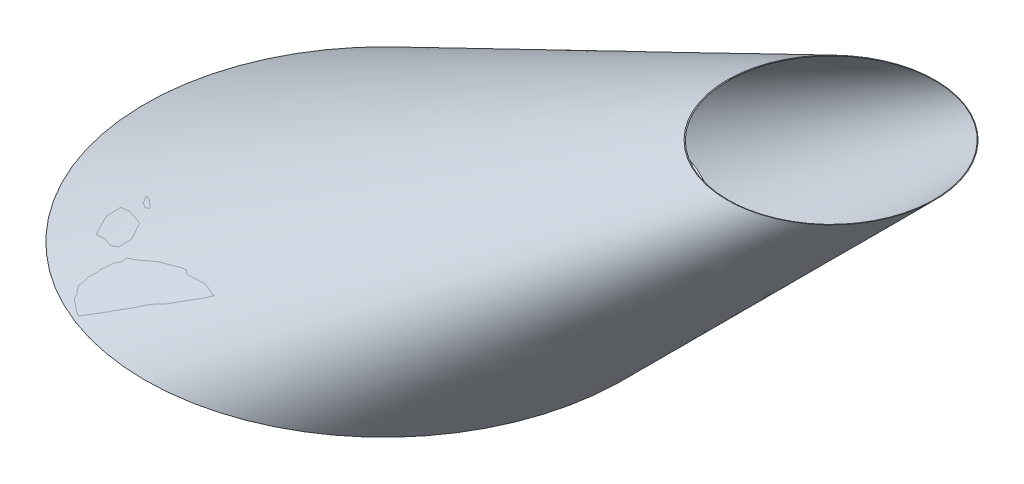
ISO-10303-21;
HEADER;
FILE_DESCRIPTION(('STEP AP214'),'2;1');
FILE_NAME('part.step','',(''),(''),'','','');
FILE_SCHEMA(('AUTOMOTIVE_DESIGN { 1 0 10303 214 1 1 1 1 }'));
ENDSEC;
DATA;
#1=APPLICATION_CONTEXT('core data for automotive mechanical design processes');
#2=APPLICATION_PROTOCOL_DEFINITION('international standard','automotive_design',2000,#1);
#3=PRODUCT_CONTEXT('',#1,'mechanical');
#4=PRODUCT('Part','Part','',(#3));
#5=PRODUCT_RELATED_PRODUCT_CATEGORY('part','',(#4));
#6=PRODUCT_DEFINITION_FORMATION('','',#4);
#7=PRODUCT_DEFINITION_CONTEXT('part definition',#1,'design');
#8=PRODUCT_DEFINITION('design','',#6,#7);
#9=PRODUCT_DEFINITION_SHAPE('','',#8);
#10=(LENGTH_UNIT() NAMED_UNIT(*) SI_UNIT(.MILLI.,.METRE.));
#11=(NAMED_UNIT(*) PLANE_ANGLE_UNIT() SI_UNIT($,.RADIAN.));
#12=(NAMED_UNIT(*) SI_UNIT($,.STERADIAN.) SOLID_ANGLE_UNIT());
#13=UNCERTAINTY_MEASURE_WITH_UNIT(LENGTH_MEASURE(1.E-05),#10,'distance_accuracy_value','');
#14=(GEOMETRIC_REPRESENTATION_CONTEXT(3) GLOBAL_UNCERTAINTY_ASSIGNED_CONTEXT((#13)) GLOBAL_UNIT_ASSIGNED_CONTEXT((#10,
#11,#12)) REPRESENTATION_CONTEXT('',''));
#15=CARTESIAN_POINT('',(0.,0.,0.));
#16=DIRECTION('',(0.,0.,1.));
#17=DIRECTION('',(1.,0.,0.));
#18=AXIS2_PLACEMENT_3D('',#15,#16,#17);
#19=CARTESIAN_POINT('',(660.000000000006,600.,3611.18884523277));
#20=DIRECTION('',(0.,1.,0.));
#21=DIRECTION('',(-1.,0.,0.));
#22=AXIS2_PLACEMENT_3D('',#19,#20,#21);
#23=PLANE('',#22);
#24=CARTESIAN_POINT('',(860.000000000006,600.,200.));
#25=CARTESIAN_POINT('',(858.900393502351,600.,199.999999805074));
#26=CARTESIAN_POINT('',(857.800784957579,600.,199.990962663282));
#27=CARTESIAN_POINT('',(855.602017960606,600.,199.954725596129));
#28=CARTESIAN_POINT('',(854.502859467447,600.,199.92752815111));
#29=CARTESIAN_POINT('',(852.305573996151,600.,199.854991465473));
#30=CARTESIAN_POINT('',(851.207446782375,600.,199.809659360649));
#31=CARTESIAN_POINT('',(849.012011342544,600.,199.700955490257));
#32=CARTESIAN_POINT('',(847.91470317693,600.,199.63758250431));
#33=CARTESIAN_POINT('',(845.718911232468,600.,199.492582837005));
#34=CARTESIAN_POINT('',(844.620430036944,600.,199.410917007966));
#35=CARTESIAN_POINT('',(842.424955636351,600.,199.229402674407));
#36=CARTESIAN_POINT('',(841.327962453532,600.,199.129553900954));
#37=CARTESIAN_POINT('',(839.135735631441,600.,198.911779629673));
#38=CARTESIAN_POINT('',(838.040502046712,600.,198.793853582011));
#39=CARTESIAN_POINT('',(835.852143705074,600.,198.539951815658));
#40=CARTESIAN_POINT('',(834.759018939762,600.,198.403976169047));
#41=CARTESIAN_POINT('',(831.482515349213,600.,197.968804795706));
#42=CARTESIAN_POINT('',(829.302686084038,600.,197.64243199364));
#43=CARTESIAN_POINT('',(824.954921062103,600.,196.918004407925));
#44=CARTESIAN_POINT('',(822.786985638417,600.,196.519947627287));
#45=CARTESIAN_POINT('',(819.268252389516,600.,195.813389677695));
#46=CARTESIAN_POINT('',(817.913070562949,600.,195.526550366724));
#47=CARTESIAN_POINT('',(815.20892624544,600.,194.924810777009));
#48=CARTESIAN_POINT('',(813.859963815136,600.,194.609910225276));
#49=CARTESIAN_POINT('',(811.168873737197,600.,193.952209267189));
#50=CARTESIAN_POINT('',(809.826746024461,600.,193.60940912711));
#51=CARTESIAN_POINT('',(807.149923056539,600.,192.895928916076));
#52=CARTESIAN_POINT('',(805.815227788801,600.,192.525248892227));
#53=CARTESIAN_POINT('',(803.152971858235,600.,191.755970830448));
#54=CARTESIAN_POINT('',(801.825416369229,600.,191.35735488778));
#55=CARTESIAN_POINT('',(799.178857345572,600.,190.532706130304));
#56=CARTESIAN_POINT('',(797.859853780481,600.,190.106673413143));
#57=CARTESIAN_POINT('',(795.230766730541,600.,189.227165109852));
#58=CARTESIAN_POINT('',(793.920684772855,600.,188.773684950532));
#59=CARTESIAN_POINT('',(791.310285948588,600.,187.839531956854));
#60=CARTESIAN_POINT('',(790.009969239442,600.,187.358858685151));
#61=CARTESIAN_POINT('',(785.21618644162,600.,185.530029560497));
#62=CARTESIAN_POINT('',(781.75441380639,600.,184.097032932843));
#63=CARTESIAN_POINT('',(776.626342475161,600.,181.803181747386));
#64=CARTESIAN_POINT('',(774.927333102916,600.,181.014289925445));
#65=CARTESIAN_POINT('',(771.552035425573,600.,179.389146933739));
#66=CARTESIAN_POINT('',(769.875747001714,600.,178.552896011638));
#67=CARTESIAN_POINT('',(766.547146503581,600.,176.83357988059));
#68=CARTESIAN_POINT('',(764.894837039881,600.,175.950509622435));
#69=CARTESIAN_POINT('',(761.615733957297,600.,174.138186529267));
#70=CARTESIAN_POINT('',(759.988940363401,600.,173.208933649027));
#71=CARTESIAN_POINT('',(756.760004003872,600.,171.303905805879));
#72=CARTESIAN_POINT('',(755.157895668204,600.,170.328072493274));
#73=CARTESIAN_POINT('',(751.981715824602,600.,168.331788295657));
#74=CARTESIAN_POINT('',(750.407644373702,600.,167.311337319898));
#75=CARTESIAN_POINT('',(747.289027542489,600.,165.226582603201));
#76=CARTESIAN_POINT('',(745.744479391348,600.,164.162283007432));
#77=CARTESIAN_POINT('',(742.685976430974,600.,161.990635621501));
#78=CARTESIAN_POINT('',(741.172021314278,600.,160.883288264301));
#79=CARTESIAN_POINT('',(738.175839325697,600.,158.626568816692));
#80=CARTESIAN_POINT('',(736.693611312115,600.,157.47719824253));
#81=CARTESIAN_POINT('',(733.76207320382,600.,155.137199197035));
#82=CARTESIAN_POINT('',(732.312763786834,600.,153.94656987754));
#83=CARTESIAN_POINT('',(728.733121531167,600.,150.920393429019));
#84=CARTESIAN_POINT('',(726.62401993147,600.,149.059629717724));
#85=CARTESIAN_POINT('',(722.4859987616,600.,145.250818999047));
#86=CARTESIAN_POINT('',(720.457084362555,600.,143.302766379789));
#87=CARTESIAN_POINT('',(716.483207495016,600.,139.322802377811));
#88=CARTESIAN_POINT('',(714.53824521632,600.,137.290890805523));
#89=CARTESIAN_POINT('',(710.735775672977,600.,133.146908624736));
#90=CARTESIAN_POINT('',(708.878266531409,600.,131.034839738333));
#91=CARTESIAN_POINT('',(705.254518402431,600.,126.734915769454));
#92=CARTESIAN_POINT('',(703.48825150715,600.,124.547084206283));
#93=CARTESIAN_POINT('',(700.049513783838,600.,120.09889794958));
#94=CARTESIAN_POINT('',(698.377043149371,600.,117.8385431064));
#95=CARTESIAN_POINT('',(695.128840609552,600.,113.249299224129));
#96=CARTESIAN_POINT('',(693.553111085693,600.,110.920408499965));
#97=CARTESIAN_POINT('',(690.501299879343,600.,106.198361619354));
#98=CARTESIAN_POINT('',(689.025211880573,600.,103.805209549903));
#99=CARTESIAN_POINT('',(686.650178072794,600.,99.7664866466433));
#100=CARTESIAN_POINT('',(685.722821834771,600.,98.1375455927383));
#101=CARTESIAN_POINT('',(683.914275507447,600.,94.8542463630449));
#102=CARTESIAN_POINT('',(683.03308444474,600.,93.1998887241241));
#103=CARTESIAN_POINT('',(681.317537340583,600.,89.8670544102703));
#104=CARTESIAN_POINT('',(680.483181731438,600.,88.1885775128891));
#105=CARTESIAN_POINT('',(678.861989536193,600.,84.8088054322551));
#106=CARTESIAN_POINT('',(678.075153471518,600.,83.107509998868));
#107=CARTESIAN_POINT('',(676.549618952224,600.,79.6835239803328));
#108=CARTESIAN_POINT('',(675.810919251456,600.,77.9608339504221));
#109=CARTESIAN_POINT('',(674.382218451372,600.,74.4953087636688));
#110=CARTESIAN_POINT('',(673.692219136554,600.,72.7524728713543));
#111=CARTESIAN_POINT('',(672.361463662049,600.,69.2480107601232));
#112=CARTESIAN_POINT('',(671.72070919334,600.,67.4863838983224));
#113=CARTESIAN_POINT('',(670.488972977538,600.,63.9458970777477));
#114=CARTESIAN_POINT('',(669.897991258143,600.,62.1670371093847));
#115=CARTESIAN_POINT('',(668.200439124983,600.,56.8064957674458));
#116=CARTESIAN_POINT('',(667.169132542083,600.,53.2005127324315));
#117=CARTESIAN_POINT('',(665.775498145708,600.,47.7530478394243));
#118=CARTESIAN_POINT('',(665.336490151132,600.,45.9307225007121));
#119=CARTESIAN_POINT('',(664.509885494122,600.,42.2743679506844));
#120=CARTESIAN_POINT('',(664.122288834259,600.,40.4403387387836));
#121=CARTESIAN_POINT('',(663.39878069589,600.,36.7622028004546));
#122=CARTESIAN_POINT('',(663.062867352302,600.,34.9180964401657));
#123=CARTESIAN_POINT('',(662.443042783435,600.,31.2211644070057));
#124=CARTESIAN_POINT('',(662.159131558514,600.,29.3683387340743));
#125=CARTESIAN_POINT('',(661.643506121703,600.,25.655415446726));
#126=CARTESIAN_POINT('',(661.411792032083,600.,23.7953178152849));
#127=CARTESIAN_POINT('',(661.000706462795,600.,20.0694251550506));
#128=CARTESIAN_POINT('',(660.821334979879,600.,18.203630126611));
#129=CARTESIAN_POINT('',(660.362085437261,600.,12.5997232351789));
#130=CARTESIAN_POINT('',(660.161020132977,600.,8.85471411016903));
#131=CARTESIAN_POINT('',(660.017386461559,600.,3.23383564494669));
#132=CARTESIAN_POINT('',(659.995838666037,600.,1.35956006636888));
#133=CARTESIAN_POINT('',(660.00548720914,600.,-2.38885528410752));
#134=CARTESIAN_POINT('',(660.036683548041,600.,-4.26299505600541));
#135=CARTESIAN_POINT('',(660.209246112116,600.,-9.88305295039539));
#136=CARTESIAN_POINT('',(660.429576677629,600.,-13.6269711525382));
#137=CARTESIAN_POINT('',(660.917659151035,600.,-19.2284209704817));
#138=CARTESIAN_POINT('',(661.106630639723,600.,-21.0932557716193));
#139=CARTESIAN_POINT('',(661.536874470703,600.,-24.8169602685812));
#140=CARTESIAN_POINT('',(661.778146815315,600.,-26.6758299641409));
#141=CARTESIAN_POINT('',(662.312879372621,600.,-30.3860840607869));
#142=CARTESIAN_POINT('',(662.606341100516,600.,-32.2374682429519));
#143=CARTESIAN_POINT('',(663.245205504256,600.,-35.9312517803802));
#144=CARTESIAN_POINT('',(663.590608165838,600.,-37.7736511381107));
#145=CARTESIAN_POINT('',(664.333036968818,600.,-41.4480448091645));
#146=CARTESIAN_POINT('',(664.730063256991,600.,-43.2800390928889));
#147=CARTESIAN_POINT('',(665.575473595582,600.,-46.9320584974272));
#148=CARTESIAN_POINT('',(666.023857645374,600.,-48.752083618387));
#149=CARTESIAN_POINT('',(667.445500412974,600.,-54.1922326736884));
#150=CARTESIAN_POINT('',(668.495325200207,600.,-57.7928036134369));
#151=CARTESIAN_POINT('',(670.220429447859,600.,-63.1445006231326));
#152=CARTESIAN_POINT('',(670.820561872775,600.,-64.9203010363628));
#153=CARTESIAN_POINT('',(672.070474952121,600.,-68.4543448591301));
#154=CARTESIAN_POINT('',(672.720255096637,600.,-70.2125884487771));
#155=CARTESIAN_POINT('',(674.743374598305,600.,-75.4588220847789));
#156=CARTESIAN_POINT('',(676.190597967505,600.,-78.9186405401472));
#157=CARTESIAN_POINT('',(679.277099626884,600.,-85.7512765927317));
#158=CARTESIAN_POINT('',(680.916377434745,600.,-89.1240944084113));
#159=CARTESIAN_POINT('',(684.381867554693,600.,-95.7722277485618));
#160=CARTESIAN_POINT('',(686.208074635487,600.,-99.0475459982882));
#161=CARTESIAN_POINT('',(690.041681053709,600.,-105.490381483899));
#162=CARTESIAN_POINT('',(692.049080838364,600.,-108.657898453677));
#163=CARTESIAN_POINT('',(696.238673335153,600.,-114.875064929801));
#164=CARTESIAN_POINT('',(698.420865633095,600.,-117.924714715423));
#165=CARTESIAN_POINT('',(702.953224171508,600.,-123.896562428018));
#166=CARTESIAN_POINT('',(705.303381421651,600.,-126.818767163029));
#167=CARTESIAN_POINT('',(708.948696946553,600.,-131.099272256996));
#168=CARTESIAN_POINT('',(710.183893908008,600.,-132.509055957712));
#169=CARTESIAN_POINT('',(712.6934169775,600.,-135.29332575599));
#170=CARTESIAN_POINT('',(713.967741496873,600.,-136.667813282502));
#171=CARTESIAN_POINT('',(716.554541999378,600.,-139.380464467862));
#172=CARTESIAN_POINT('',(717.86701890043,600.,-140.71862725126));
#173=CARTESIAN_POINT('',(720.529034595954,600.,-143.357468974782));
#174=CARTESIAN_POINT('',(721.878572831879,600.,-144.658148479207));
#175=CARTESIAN_POINT('',(725.29721702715,600.,-147.861648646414));
#176=CARTESIAN_POINT('',(727.388879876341,600.,-149.740544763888));
#177=CARTESIAN_POINT('',(730.584299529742,600.,-152.491344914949));
#178=CARTESIAN_POINT('',(731.659160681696,600.,-153.397073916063));
#179=CARTESIAN_POINT('',(733.827772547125,600.,-155.185665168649));
#180=CARTESIAN_POINT('',(734.921523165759,600.,-156.068527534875));
#181=CARTESIAN_POINT('',(737.12735951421,600.,-157.810967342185));
#182=CARTESIAN_POINT('',(738.239444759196,600.,-158.670545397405));
#183=CARTESIAN_POINT('',(740.481459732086,600.,-160.366126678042));
#184=CARTESIAN_POINT('',(741.611389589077,600.,-161.202129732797));
#185=CARTESIAN_POINT('',(743.888628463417,600.,-162.850134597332));
#186=CARTESIAN_POINT('',(745.035937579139,600.,-163.662136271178));
#187=CARTESIAN_POINT('',(747.347413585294,600.,-165.261720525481));
#188=CARTESIAN_POINT('',(748.511580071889,600.,-166.049303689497));
#189=CARTESIAN_POINT('',(750.856693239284,600.,-167.599997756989));
#190=CARTESIAN_POINT('',(752.037645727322,600.,-168.363099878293));
#191=CARTESIAN_POINT('',(754.415287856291,600.,-169.864206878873));
#192=CARTESIAN_POINT('',(755.611976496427,600.,-170.602213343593));
#193=CARTESIAN_POINT('',(758.020677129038,600.,-172.052919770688));
#194=CARTESIAN_POINT('',(759.232689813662,600.,-172.765618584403));
#195=CARTESIAN_POINT('',(761.671489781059,600.,-174.16527043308));
#196=CARTESIAN_POINT('',(762.898277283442,600.,-174.852223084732));
#197=CARTESIAN_POINT('',(766.599954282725,600.,-176.873938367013));
#198=CARTESIAN_POINT('',(769.09631429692,600.,-178.169652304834));
#199=CARTESIAN_POINT('',(774.14113317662,600.,-180.654819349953));
#200=CARTESIAN_POINT('',(776.689588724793,600.,-181.844279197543));
#201=CARTESIAN_POINT('',(780.977921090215,600.,-183.736461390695));
#202=CARTESIAN_POINT('',(782.704518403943,600.,-184.469389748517));
#203=CARTESIAN_POINT('',(785.309284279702,600.,-185.532154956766));
#204=CARTESIAN_POINT('',(786.180010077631,600.,-185.88030253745));
#205=CARTESIAN_POINT('',(787.926256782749,600.,-186.564356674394));
#206=CARTESIAN_POINT('',(788.801777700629,600.,-186.900263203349));
#207=CARTESIAN_POINT('',(791.435373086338,600.,-187.889476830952));
#208=CARTESIAN_POINT('',(793.200445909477,600.,-188.524263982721));
#209=CARTESIAN_POINT('',(796.747782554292,600.,-189.743813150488));
#210=CARTESIAN_POINT('',(798.530046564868,600.,-190.328574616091));
#211=CARTESIAN_POINT('',(802.110437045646,600.,-191.447943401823));
#212=CARTESIAN_POINT('',(803.908564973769,600.,-191.982546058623));
#213=CARTESIAN_POINT('',(807.519194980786,600.,-193.000867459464));
#214=CARTESIAN_POINT('',(809.331697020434,600.,-193.484586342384));
#215=CARTESIAN_POINT('',(812.05889064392,600.,-194.171426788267));
#216=CARTESIAN_POINT('',(812.968776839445,600.,-194.393787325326));
#217=CARTESIAN_POINT('',(814.79157207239,600.,-194.82575252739));
#218=CARTESIAN_POINT('',(815.704481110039,600.,-195.03535719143));
#219=CARTESIAN_POINT('',(818.447482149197,600.,-195.644898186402));
#220=CARTESIAN_POINT('',(820.281894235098,600.,-196.025573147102));
#221=CARTESIAN_POINT('',(823.960483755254,600.,-196.735079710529));
#222=CARTESIAN_POINT('',(825.80466012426,600.,-197.063916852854));
#223=CARTESIAN_POINT('',(829.501519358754,600.,-197.669810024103));
#224=CARTESIAN_POINT('',(831.354202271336,600.,-197.946865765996));
#225=CARTESIAN_POINT('',(835.065913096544,600.,-198.448560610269));
#226=CARTESIAN_POINT('',(836.924938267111,600.,-198.673220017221));
#227=CARTESIAN_POINT('',(840.648524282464,600.,-199.070402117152));
#228=CARTESIAN_POINT('',(842.513085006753,600.,-199.242925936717));
#229=CARTESIAN_POINT('',(845.761637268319,600.,-199.497416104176));
#230=CARTESIAN_POINT('',(847.144710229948,600.,-199.59126445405));
#231=CARTESIAN_POINT('',(849.912490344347,600.,-199.750254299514));
#232=CARTESIAN_POINT('',(851.297197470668,600.,-199.815396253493));
#233=CARTESIAN_POINT('',(854.067418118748,600.,-199.916849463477));
#234=CARTESIAN_POINT('',(855.452931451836,600.,-199.953165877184));
#235=CARTESIAN_POINT('',(858.224419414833,600.,-199.996952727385));
#236=CARTESIAN_POINT('',(859.610394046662,600.,-200.004423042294));
#237=CARTESIAN_POINT('',(862.381363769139,600.,-199.990633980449));
#238=CARTESIAN_POINT('',(863.766358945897,600.,-199.969391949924));
#239=CARTESIAN_POINT('',(866.535603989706,600.,-199.898045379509));
#240=CARTESIAN_POINT('',(867.919853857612,600.,-199.847940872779));
#241=CARTESIAN_POINT('',(870.687086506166,600.,-199.719063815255));
#242=CARTESIAN_POINT('',(872.070069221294,600.,-199.64028985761));
#243=CARTESIAN_POINT('',(874.834096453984,600.,-199.453996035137));
#244=CARTESIAN_POINT('',(876.215140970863,600.,-199.346476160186));
#245=CARTESIAN_POINT('',(878.975138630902,600.,-199.10268340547));
#246=CARTESIAN_POINT('',(880.354090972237,600.,-198.966401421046));
#247=CARTESIAN_POINT('',(883.108845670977,600.,-198.665309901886));
#248=CARTESIAN_POINT('',(884.484648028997,600.,-198.500500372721));
#249=CARTESIAN_POINT('',(888.606441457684,600.,-197.963110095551));
#250=CARTESIAN_POINT('',(891.34700953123,600.,-197.547550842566));
#251=CARTESIAN_POINT('',(895.442896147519,600.,-196.839355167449));
#252=CARTESIAN_POINT('',(896.805734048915,600.,-196.58913923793));
#253=CARTESIAN_POINT('',(899.52593328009,600.,-196.060360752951));
#254=CARTESIAN_POINT('',(900.883294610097,600.,-195.781798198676));
#255=CARTESIAN_POINT('',(903.59194246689,600.,-195.196504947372));
#256=CARTESIAN_POINT('',(904.94322890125,600.,-194.889773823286));
#257=CARTESIAN_POINT('',(907.639158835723,600.,-194.248386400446));
#258=CARTESIAN_POINT('',(908.983802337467,600.,-193.913730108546));
#259=CARTESIAN_POINT('',(911.665202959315,600.,-193.216653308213));
#260=CARTESIAN_POINT('',(913.001963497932,600.,-192.854245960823));
#261=CARTESIAN_POINT('',(915.667632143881,600.,-192.101696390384));
#262=CARTESIAN_POINT('',(916.996540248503,600.,-191.711554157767));
#263=CARTESIAN_POINT('',(920.970556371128,600.,-190.500013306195));
#264=CARTESIAN_POINT('',(923.60323325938,600.,-189.637428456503));
#265=CARTESIAN_POINT('',(928.831952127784,600.,-187.802814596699));
#266=CARTESIAN_POINT('',(931.427971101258,600.,-186.830720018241));
#267=CARTESIAN_POINT('',(935.290199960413,600.,-185.29250244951));
#268=CARTESIAN_POINT('',(936.572456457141,600.,-184.766351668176));
#269=CARTESIAN_POINT('',(939.125776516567,600.,-183.687470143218));
#270=CARTESIAN_POINT('',(940.396839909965,600.,-183.134738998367));
#271=CARTESIAN_POINT('',(943.370904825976,600.,-181.804427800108));
#272=CARTESIAN_POINT('',(945.069054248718,600.,-181.01597535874));
#273=CARTESIAN_POINT('',(948.442614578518,600.,-179.391776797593));
#274=CARTESIAN_POINT('',(950.118024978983,600.,-178.556029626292));
#275=CARTESIAN_POINT('',(953.445387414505,600.,-176.837519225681));
#276=CARTESIAN_POINT('',(955.097330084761,600.,-175.954737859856));
#277=CARTESIAN_POINT('',(958.375697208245,600.,-174.143022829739));
#278=CARTESIAN_POINT('',(960.00212180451,600.,-173.214089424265));
#279=CARTESIAN_POINT('',(963.228430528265,600.,-171.31084617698));
#280=CARTESIAN_POINT('',(964.828311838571,600.,-170.336531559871));
#281=CARTESIAN_POINT('',(968.000119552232,600.,-168.343412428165));
#282=CARTESIAN_POINT('',(969.572045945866,600.,-167.324607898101));
#283=CARTESIAN_POINT('',(972.688642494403,600.,-165.241812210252));
#284=CARTESIAN_POINT('',(974.233274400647,600.,-164.177763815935));
#285=CARTESIAN_POINT('',(977.291974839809,600.,-162.006601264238));
#286=CARTESIAN_POINT('',(978.806043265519,600.,-160.899486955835));
#287=CARTESIAN_POINT('',(981.802369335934,600.,-158.643300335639));
#288=CARTESIAN_POINT('',(983.284629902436,600.,-157.494231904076));
#289=CARTESIAN_POINT('',(986.216218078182,600.,-155.154857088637));
#290=CARTESIAN_POINT('',(987.665546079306,600.,-153.964551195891));
#291=CARTESIAN_POINT('',(990.530041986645,600.,-151.543653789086));
#292=CARTESIAN_POINT('',(991.945211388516,600.,-150.31306404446));
#293=CARTESIAN_POINT('',(994.740455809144,600.,-147.812515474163));
#294=CARTESIAN_POINT('',(996.120529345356,600.,-146.542554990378));
#295=CARTESIAN_POINT('',(998.503525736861,600.,-144.287035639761));
#296=CARTESIAN_POINT('',(999.514390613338,600.,-143.309850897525));
#297=CARTESIAN_POINT('',(1001.51528476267,600.,-141.33437008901));
#298=CARTESIAN_POINT('',(1002.50531405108,600.,-140.336074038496));
#299=CARTESIAN_POINT('',(1004.46414011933,600.,-138.318794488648));
#300=CARTESIAN_POINT('',(1005.43293620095,600.,-137.299810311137));
#301=CARTESIAN_POINT('',(1007.34886865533,600.,-135.241595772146));
#302=CARTESIAN_POINT('',(1008.29600371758,600.,-134.202364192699));
#303=CARTESIAN_POINT('',(1011.10412293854,600.,-131.05514766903));
#304=CARTESIAN_POINT('',(1012.93200784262,600.,-128.917448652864));
#305=CARTESIAN_POINT('',(1016.49595382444,600.,-124.566947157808));
#306=CARTESIAN_POINT('',(1018.23201476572,600.,-122.354144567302));
#307=CARTESIAN_POINT('',(1021.60874396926,600.,-117.858030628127));
#308=CARTESIAN_POINT('',(1023.24944363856,600.,-115.574742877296));
#309=CARTESIAN_POINT('',(1026.4331653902,600.,-110.940988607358));
#310=CARTESIAN_POINT('',(1027.97618546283,600.,-108.590520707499));
#311=CARTESIAN_POINT('',(1030.96179809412,600.,-103.826610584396));
#312=CARTESIAN_POINT('',(1032.4043890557,600.,-101.413167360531));
#313=CARTESIAN_POINT('',(1035.18647794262,600.,-96.5277049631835));
#314=CARTESIAN_POINT('',(1036.52598238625,600.,-94.0556895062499));
#315=CARTESIAN_POINT('',(1038.67074680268,600.,-89.8903493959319));
#316=CARTESIAN_POINT('',(1039.50529524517,600.,-88.2120306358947));
#317=CARTESIAN_POINT('',(1041.12689997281,600.,-84.8325294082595));
#318=CARTESIAN_POINT('',(1041.91395525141,600.,-83.1313464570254));
#319=CARTESIAN_POINT('',(1043.43992814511,600.,-79.7075850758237));
#320=CARTESIAN_POINT('',(1044.17884699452,600.,-77.9850071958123));
#321=CARTESIAN_POINT('',(1045.60799170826,600.,-74.51969647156));
#322=CARTESIAN_POINT('',(1046.2982157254,600.,-72.7769628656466));
#323=CARTESIAN_POINT('',(1047.62938618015,600.,-69.2727968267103));
#324=CARTESIAN_POINT('',(1048.27033366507,600.,-67.5113647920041));
#325=CARTESIAN_POINT('',(1049.50246450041,600.,-63.9712637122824));
#326=CARTESIAN_POINT('',(1050.09364784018,600.,-62.1925946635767));
#327=CARTESIAN_POINT('',(1051.79187497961,600.,-56.8324367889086));
#328=CARTESIAN_POINT('',(1052.82365721,600.,-53.2266358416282));
#329=CARTESIAN_POINT('',(1054.21801692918,600.,-47.7794152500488));
#330=CARTESIAN_POINT('',(1054.65726959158,600.,-45.9571619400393));
#331=CARTESIAN_POINT('',(1055.48436547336,600.,-42.3009450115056));
#332=CARTESIAN_POINT('',(1055.8722087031,600.,-40.4669813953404));
#333=CARTESIAN_POINT('',(1056.59622416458,600.,-36.7889082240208));
#334=CARTESIAN_POINT('',(1056.93239653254,600.,-34.9447986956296));
#335=CARTESIAN_POINT('',(1057.55273802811,600.,-31.2478527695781));
#336=CARTESIAN_POINT('',(1057.836907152,600.,-29.3950163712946));
#337=CARTESIAN_POINT('',(1058.35303175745,600.,-25.6821668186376));
#338=CARTESIAN_POINT('',(1058.58499000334,600.,-23.8221540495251));
#339=CARTESIAN_POINT('',(1058.99656804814,600.,-20.0964244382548));
#340=CARTESIAN_POINT('',(1059.17618785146,600.,-18.2307075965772));
#341=CARTESIAN_POINT('',(1059.63618895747,600.,-12.6270075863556));
#342=CARTESIAN_POINT('',(1059.83776176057,600.,-8.88211672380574));
#343=CARTESIAN_POINT('',(1059.98216550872,600.,-3.26139051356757));
#344=CARTESIAN_POINT('',(1060.00397142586,600.,-1.38715971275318));
#345=CARTESIAN_POINT('',(1059.99484129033,600.,2.36117337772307));
#346=CARTESIAN_POINT('',(1059.96390523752,600.,4.23527566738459));
#347=CARTESIAN_POINT('',(1059.79212757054,600.,9.85520529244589));
#348=CARTESIAN_POINT('',(1059.57232639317,600.,13.5990437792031));
#349=CARTESIAN_POINT('',(1059.08504444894,600.,19.2004058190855));
#350=CARTESIAN_POINT('',(1058.8963402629,600.,21.0652210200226));
#351=CARTESIAN_POINT('',(1058.46663257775,600.,24.7888939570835));
#352=CARTESIAN_POINT('',(1058.22562907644,600.,26.6477516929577));
#353=CARTESIAN_POINT('',(1057.69144459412,600.,30.3579319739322));
#354=CARTESIAN_POINT('',(1057.39826372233,600.,32.2092545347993));
#355=CARTESIAN_POINT('',(1056.75996500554,600.,35.9029231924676));
#356=CARTESIAN_POINT('',(1056.41484717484,600.,37.7452692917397));
#357=CARTESIAN_POINT('',(1055.67297250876,600.,41.419664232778));
#358=CARTESIAN_POINT('',(1055.2762127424,600.,43.2517124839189));
#359=CARTESIAN_POINT('',(1054.43133402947,600.,46.9038473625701));
#360=CARTESIAN_POINT('',(1053.9832150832,600.,48.7239339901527));
#361=CARTESIAN_POINT('',(1052.56235999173,600.,54.1642973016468));
#362=CARTESIAN_POINT('',(1051.51305400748,600.,57.7650318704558));
#363=CARTESIAN_POINT('',(1049.78872380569,600.,63.1169840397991));
#364=CARTESIAN_POINT('',(1049.18885094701,600.,64.8928653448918));
#365=CARTESIAN_POINT('',(1047.93945473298,600.,68.4270782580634));
#366=CARTESIAN_POINT('',(1047.28993188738,600.,70.1854100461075));
#367=CARTESIAN_POINT('',(1045.26755893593,600.,75.4319758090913));
#368=CARTESIAN_POINT('',(1043.8208181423,600.,78.8920479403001));
#369=CARTESIAN_POINT('',(1040.73525630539,600.,85.7252341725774));
#370=CARTESIAN_POINT('',(1039.09643477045,600.,89.0983480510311));
#371=CARTESIAN_POINT('',(1035.63179256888,600.,95.7471812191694));
#372=CARTESIAN_POINT('',(1033.80597239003,600.,99.0229007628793));
#373=CARTESIAN_POINT('',(1029.97307479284,600.,105.466612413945));
#374=CARTESIAN_POINT('',(1027.96599370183,600.,108.634602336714));
#375=CARTESIAN_POINT('',(1023.77699079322,600.,114.852739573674));
#376=CARTESIAN_POINT('',(1021.59506853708,600.,117.902886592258));
#377=CARTESIAN_POINT('',(1017.06309518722,600.,123.875887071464));
#378=CARTESIAN_POINT('',(1014.71304449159,600.,126.798740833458));
#379=CARTESIAN_POINT('',(1011.06803069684,600.,131.079995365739));
#380=CARTESIAN_POINT('',(1009.83305582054,600.,132.489888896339));
#381=CARTESIAN_POINT('',(1007.3239746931,600.,135.27438665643));
#382=CARTESIAN_POINT('',(1006.04986998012,600.,136.648992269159));
#383=CARTESIAN_POINT('',(1003.46349773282,600.,139.361895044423));
#384=CARTESIAN_POINT('',(1002.151229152,600.,140.700191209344));
#385=CARTESIAN_POINT('',(999.489639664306,600.,143.339299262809));
#386=CARTESIAN_POINT('',(998.140319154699,600.,144.640111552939));
#387=CARTESIAN_POINT('',(994.038346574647,600.,148.484931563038));
#388=CARTESIAN_POINT('',(991.231433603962,600.,150.971584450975));
#389=CARTESIAN_POINT('',(986.201771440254,600.,155.18074670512));
#390=CARTESIAN_POINT('',(984.008586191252,600.,156.938775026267));
#391=CARTESIAN_POINT('',(980.664823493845,600.,159.505406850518));
#392=CARTESIAN_POINT('',(979.541190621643,600.,160.349249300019));
#393=CARTESIAN_POINT('',(977.27631723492,600.,162.013162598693));
#394=CARTESIAN_POINT('',(976.135075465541,600.,162.833231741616));
#395=CARTESIAN_POINT('',(973.835637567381,600.,164.44903497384));
#396=CARTESIAN_POINT('',(972.677442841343,600.,165.244771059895));
#397=CARTESIAN_POINT('',(970.344484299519,600.,166.811646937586));
#398=CARTESIAN_POINT('',(969.169720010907,600.,167.58278602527));
#399=CARTESIAN_POINT('',(966.804198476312,600.,169.100126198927));
#400=CARTESIAN_POINT('',(965.613441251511,600.,169.846327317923));
#401=CARTESIAN_POINT('',(963.21654054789,600.,171.3135160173));
#402=CARTESIAN_POINT('',(962.010397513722,600.,172.03450432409));
#403=CARTESIAN_POINT('',(959.582196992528,600.,173.451465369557));
#404=CARTESIAN_POINT('',(958.360127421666,600.,174.147417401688));
#405=CARTESIAN_POINT('',(955.901636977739,600.,175.513302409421));
#406=CARTESIAN_POINT('',(954.665217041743,600.,176.183237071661));
#407=CARTESIAN_POINT('',(952.178453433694,600.,177.496875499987));
#408=CARTESIAN_POINT('',(950.92810916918,600.,178.140578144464));
#409=CARTESIAN_POINT('',(948.414135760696,600.,179.401549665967));
#410=CARTESIAN_POINT('',(947.150506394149,600.,180.018818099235));
#411=CARTESIAN_POINT('',(944.610492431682,600.,181.226591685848));
#412=CARTESIAN_POINT('',(943.334107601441,600.,181.817096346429));
#413=CARTESIAN_POINT('',(940.769144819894,600.,182.97099862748));
#414=CARTESIAN_POINT('',(939.480566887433,600.,183.534396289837));
#415=CARTESIAN_POINT('',(936.891864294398,600.,184.633820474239));
#416=CARTESIAN_POINT('',(935.591740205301,600.,185.169848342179));
#417=CARTESIAN_POINT('',(932.98051821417,600.,186.214443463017));
#418=CARTESIAN_POINT('',(931.669420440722,600.,186.723011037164));
#419=CARTESIAN_POINT('',(929.417377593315,600.,187.569354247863));
#420=CARTESIAN_POINT('',(928.47900805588,600.,187.913998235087));
#421=CARTESIAN_POINT('',(926.597212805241,600.,188.589146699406));
#422=CARTESIAN_POINT('',(925.653787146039,600.,188.919651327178));
#423=CARTESIAN_POINT('',(922.816291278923,600.,189.889824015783));
#424=CARTESIAN_POINT('',(920.914888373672,600.,190.508193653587));
#425=CARTESIAN_POINT('',(917.094262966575,600.,191.68788261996));
#426=CARTESIAN_POINT('',(915.17503837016,600.,192.249195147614));
#427=CARTESIAN_POINT('',(911.320515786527,600.,193.313873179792));
#428=CARTESIAN_POINT('',(909.385217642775,600.,193.817238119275));
#429=CARTESIAN_POINT('',(906.471500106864,600.,194.528668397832));
#430=CARTESIAN_POINT('',(905.498358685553,600.,194.758565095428));
#431=CARTESIAN_POINT('',(903.548743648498,600.,195.20377954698));
#432=CARTESIAN_POINT('',(902.572270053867,600.,195.419097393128));
#433=CARTESIAN_POINT('',(900.616209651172,600.,195.835038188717));
#434=CARTESIAN_POINT('',(899.636622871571,600.,196.035661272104));
#435=CARTESIAN_POINT('',(897.674522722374,600.,196.422166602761));
#436=CARTESIAN_POINT('',(896.692009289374,600.,196.608048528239));
#437=CARTESIAN_POINT('',(894.726601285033,600.,196.964636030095));
#438=CARTESIAN_POINT('',(893.743712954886,600.,197.135376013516));
#439=CARTESIAN_POINT('',(891.775488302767,600.,197.462184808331));
#440=CARTESIAN_POINT('',(890.790151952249,600.,197.618253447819));
#441=CARTESIAN_POINT('',(888.817198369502,600.,197.915623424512));
#442=CARTESIAN_POINT('',(887.829581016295,600.,198.056923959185));
#443=CARTESIAN_POINT('',(885.852342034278,600.,198.324696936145));
#444=CARTESIAN_POINT('',(884.86272041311,600.,198.451169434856));
#445=CARTESIAN_POINT('',(882.881896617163,600.,198.68926190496));
#446=CARTESIAN_POINT('',(881.890694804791,600.,198.800884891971));
#447=CARTESIAN_POINT('',(879.906733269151,600.,199.009341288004));
#448=CARTESIAN_POINT('',(878.913973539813,600.,199.106174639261));
#449=CARTESIAN_POINT('',(876.927168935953,600.,199.284954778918));
#450=CARTESIAN_POINT('',(875.93312413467,600.,199.366902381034));
#451=CARTESIAN_POINT('',(873.94392958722,600.,199.515881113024));
#452=CARTESIAN_POINT('',(872.948779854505,600.,199.58291242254));
#453=CARTESIAN_POINT('',(870.958229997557,600.,199.702061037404));
#454=CARTESIAN_POINT('',(869.962830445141,600.,199.754187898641));
#455=CARTESIAN_POINT('',(867.971382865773,600.,199.843585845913));
#456=CARTESIAN_POINT('',(866.975334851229,600.,199.880857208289));
#457=CARTESIAN_POINT('',(864.982847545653,600.,199.940469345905));
#458=CARTESIAN_POINT('',(863.986408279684,600.,199.962810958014));
#459=CARTESIAN_POINT('',(861.993313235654,600.,199.992576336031));
#460=CARTESIAN_POINT('',(860.996657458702,600.,200.000000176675));
#461=CARTESIAN_POINT('',(860.000000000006,600.,200.));
#462=B_SPLINE_CURVE_WITH_KNOTS('',3,(#24,#25,#26,#27,#28,#29,#30,#31,#32,#33,#34,#35,#36,#37,
#38,#39,#40,#41,#42,#43,#44,#45,#46,#47,#48,#49,#50,#51,#52,#53,#54,#55,#56,#57,#58,#59,#60,#61,
#62,#63,#64,#65,#66,#67,#68,#69,#70,#71,#72,#73,#74,#75,#76,#77,#78,#79,#80,#81,#82,#83,#84,#85,
#86,#87,#88,#89,#90,#91,#92,#93,#94,#95,#96,#97,#98,#99,#100,#101,#102,#103,#104,#105,#106,#107,
#108,#109,#110,#111,#112,#113,#114,#115,#116,#117,#118,#119,#120,#121,#122,#123,#124,#125,#126,
#127,#128,#129,#130,#131,#132,#133,#134,#135,#136,#137,#138,#139,#140,#141,#142,#143,#144,#145,
#146,#147,#148,#149,#150,#151,#152,#153,#154,#155,#156,#157,#158,#159,#160,#161,#162,#163,#164,
#165,#166,#167,#168,#169,#170,#171,#172,#173,#174,#175,#176,#177,#178,#179,#180,#181,#182,#183,
#184,#185,#186,#187,#188,#189,#190,#191,#192,#193,#194,#195,#196,#197,#198,#199,#200,#201,#202,
#203,#204,#205,#206,#207,#208,#209,#210,#211,#212,#213,#214,#215,#216,#217,#218,#219,#220,#221,
#222,#223,#224,#225,#226,#227,#228,#229,#230,#231,#232,#233,#234,#235,#236,#237,#238,#239,#240,
#241,#242,#243,#244,#245,#246,#247,#248,#249,#250,#251,#252,#253,#254,#255,#256,#257,#258,#259,
#260,#261,#262,#263,#264,#265,#266,#267,#268,#269,#270,#271,#272,#273,#274,#275,#276,#277,#278,
#279,#280,#281,#282,#283,#284,#285,#286,#287,#288,#289,#290,#291,#292,#293,#294,#295,#296,#297,
#298,#299,#300,#301,#302,#303,#304,#305,#306,#307,#308,#309,#310,#311,#312,#313,#314,#315,#316,
#317,#318,#319,#320,#321,#322,#323,#324,#325,#326,#327,#328,#329,#330,#331,#332,#333,#334,#335,
#336,#337,#338,#339,#340,#341,#342,#343,#344,#345,#346,#347,#348,#349,#350,#351,#352,#353,#354,
#355,#356,#357,#358,#359,#360,#361,#362,#363,#364,#365,#366,#367,#368,#369,#370,#371,#372,#373,
#374,#375,#376,#377,#378,#379,#380,#381,#382,#383,#384,#385,#386,#387,#388,#389,#390,#391,#392,
#393,#394,#395,#396,#397,#398,#399,#400,#401,#402,#403,#404,#405,#406,#407,#408,#409,#410,#411,
#412,#413,#414,#415,#416,#417,#418,#419,#420,#421,#422,#423,#424,#425,#426,#427,#428,#429,#430,
#431,#432,#433,#434,#435,#436,#437,#438,#439,#440,#441,#442,#443,#444,#445,#446,#447,#448,#449,
#450,#451,#452,#453,#454,#455,#456,#457,#458,#459,#460,#461),.UNSPECIFIED.,.T.,.F.,(4,2,2,2,2,2,
2,2,2,2,2,2,2,2,2,2,2,2,2,2,2,2,2,2,2,2,2,2,2,2,2,2,2,2,2,2,2,2,2,2,2,2,2,2,2,2,2,2,2,2,2,2,2,2,
2,2,2,2,2,2,2,2,2,2,2,2,2,2,2,2,2,2,2,2,2,2,2,2,2,2,2,2,2,2,2,2,2,2,2,2,2,2,2,2,2,2,2,2,2,2,2,2,
2,2,2,2,2,2,2,2,2,2,2,2,2,2,2,2,2,2,2,2,2,2,2,2,2,2,2,2,2,2,2,2,2,2,2,2,2,2,2,2,2,2,2,2,2,2,2,2,
2,2,2,2,2,2,2,2,2,2,2,2,2,2,2,2,2,2,2,2,2,2,2,2,2,2,2,2,2,2,2,2,2,2,2,2,2,2,2,2,2,2,2,2,2,2,2,2,
2,2,2,2,2,2,2,2,2,2,2,2,2,2,2,2,2,2,2,2,4),(0.,3.29878539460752,6.59712033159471,
9.89415868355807,13.1914201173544,16.4958064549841,19.8002416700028,23.1047774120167,
26.4092999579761,33.020390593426,39.6316654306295,43.7870101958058,47.9423953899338,
52.0977409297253,56.2530794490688,60.4111060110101,64.5691177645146,68.7278242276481,
72.8865975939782,84.119263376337,89.7384078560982,95.357522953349,100.97724527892,
106.596973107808,112.223935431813,117.850909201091,123.47735224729,129.103738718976,
134.729922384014,140.356221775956,148.791385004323,157.227091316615,165.662816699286,
174.098360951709,182.531309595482,190.964275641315,199.397449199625,207.83008767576,
213.452665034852,219.075123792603,224.697634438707,230.320206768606,235.942633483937,
241.565266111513,247.188091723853,252.810920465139,264.055487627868,269.678312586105,
275.301137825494,280.923760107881,286.54638242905,292.169017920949,297.791653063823,
309.035787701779,314.658386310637,320.280984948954,331.525098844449,337.147697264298,
342.770295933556,348.393057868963,354.015818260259,359.638594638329,365.261370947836,
376.505782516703,382.128596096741,387.751351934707,398.995838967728,410.240297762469,
421.484441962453,432.728613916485,443.972759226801,455.216303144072,460.838756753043,
466.460982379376,472.083343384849,477.705619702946,486.137627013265,490.354142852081,
494.570637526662,498.78702088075,503.003434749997,507.219872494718,511.436209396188,
515.654042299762,519.871608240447,524.089365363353,528.307185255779,536.742279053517,
545.176837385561,550.803252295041,553.616409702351,556.429573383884,562.056011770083,
567.682512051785,573.309534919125,578.936542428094,581.746451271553,584.556360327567,
590.176035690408,595.795110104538,601.414215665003,607.031140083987,612.647943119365,
616.806421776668,620.964834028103,625.122502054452,629.280187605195,633.435362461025,
637.59053254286,641.745906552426,645.901282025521,650.057974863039,654.214666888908,
662.527477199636,666.684106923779,670.840736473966,674.997429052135,679.154120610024,
683.308852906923,687.463586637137,695.772195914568,704.085806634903,708.243576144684,
712.401408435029,718.017429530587,723.633575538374,729.25190304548,734.87019904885,
740.489087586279,746.107978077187,751.734201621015,757.360444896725,762.98616912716,
768.61182637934,774.237236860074,779.862884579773,784.080485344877,788.298082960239,
792.515819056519,796.733809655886,805.168987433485,813.604177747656,822.036574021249,
830.469143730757,838.901847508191,847.33401763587,852.956423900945,858.578949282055,
864.20133043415,869.823924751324,875.446399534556,881.06887552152,892.313310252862,
897.936097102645,903.558882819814,909.18165371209,914.804425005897,920.426898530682,
926.049371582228,937.293234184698,942.915707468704,948.5381807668,959.781963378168,
965.404422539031,971.026881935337,976.649329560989,982.27177563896,987.89454096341,
993.517306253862,1004.76175345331,1010.38454769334,1016.0072842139,1027.25191452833,
1038.49657362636,1049.74120339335,1060.98606104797,1072.23094690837,1083.47580614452,
1089.09806776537,1094.72010866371,1100.34230387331,1105.96443882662,1117.20762407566,
1125.63764300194,1129.85300297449,1134.06866474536,1138.28397964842,1142.49941508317,
1146.71484493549,1150.93015323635,1155.14887125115,1159.36731531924,1163.58593956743,
1167.8046346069,1172.02340728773,1176.24217344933,1180.46073195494,1184.67924109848,
1187.67810649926,1190.67693993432,1196.67424221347,1202.67225850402,1208.67033327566,
1211.67002791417,1214.66970358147,1217.66935190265,1220.66906568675,1223.66177854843,
1226.65452647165,1229.64743694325,1232.6403360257,1235.63262638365,1238.62492842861,
1241.61706685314,1244.60916924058,1247.59934893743,1250.58947300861,1253.57942945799,
1256.56937092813),.UNSPECIFIED.);
#463=CARTESIAN_POINT('',(860.000000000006,600.,200.));
#464=VERTEX_POINT('',#463);
#465=EDGE_CURVE('E11',#464,#464,#462,.T.);
#466=ORIENTED_EDGE('',*,*,#465,.F.);
#467=EDGE_LOOP('',(#466));
#468=FACE_BOUND('',#467,.T.);
#469=CARTESIAN_POINT('',(844.472649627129,600.,-198.252767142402));
#470=CARTESIAN_POINT('',(846.313530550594,600.,-198.403371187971));
#471=CARTESIAN_POINT('',(848.156569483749,600.,-198.528076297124));
#472=CARTESIAN_POINT('',(851.845443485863,600.,-198.725864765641));
#473=CARTESIAN_POINT('',(853.691278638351,600.,-198.798946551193));
#474=CARTESIAN_POINT('',(857.384788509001,600.,-198.893148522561));
#475=CARTESIAN_POINT('',(859.232463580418,600.,-198.914255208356));
#476=CARTESIAN_POINT('',(862.003810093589,600.,-198.907108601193));
#477=CARTESIAN_POINT('',(862.927572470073,600.,-198.898258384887));
#478=CARTESIAN_POINT('',(864.774888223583,600.,-198.867560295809));
#479=CARTESIAN_POINT('',(865.698441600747,600.,-198.845712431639));
#480=CARTESIAN_POINT('',(867.545214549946,600.,-198.78901399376));
#481=CARTESIAN_POINT('',(868.468434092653,600.,-198.754162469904));
#482=CARTESIAN_POINT('',(870.31429449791,600.,-198.671516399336));
#483=CARTESIAN_POINT('',(871.236935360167,600.,-198.623721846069));
#484=CARTESIAN_POINT('',(873.08145719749,600.,-198.515191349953));
#485=CARTESIAN_POINT('',(874.003338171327,600.,-198.454455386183));
#486=CARTESIAN_POINT('',(875.846152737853,600.,-198.320002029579));
#487=CARTESIAN_POINT('',(876.767086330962,600.,-198.246284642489));
#488=CARTESIAN_POINT('',(878.608803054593,600.,-198.085802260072));
#489=CARTESIAN_POINT('',(879.529584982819,600.,-197.999023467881));
#490=CARTESIAN_POINT('',(881.369839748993,600.,-197.812548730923));
#491=CARTESIAN_POINT('',(882.289312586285,600.,-197.71285277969));
#492=CARTESIAN_POINT('',(884.126770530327,600.,-197.500545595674));
#493=CARTESIAN_POINT('',(885.044755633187,600.,-197.387934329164));
#494=CARTESIAN_POINT('',(886.879038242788,600.,-197.149771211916));
#495=CARTESIAN_POINT('',(887.795335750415,600.,-197.024219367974));
#496=CARTESIAN_POINT('',(890.541320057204,600.,-196.628223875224));
#497=CARTESIAN_POINT('',(892.368254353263,600.,-196.33842227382));
#498=CARTESIAN_POINT('',(896.013218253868,600.,-195.707634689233));
#499=CARTESIAN_POINT('',(897.831247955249,600.,-195.366649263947));
#500=CARTESIAN_POINT('',(901.456885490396,600.,-194.633471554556));
#501=CARTESIAN_POINT('',(903.26449371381,600.,-194.241281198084));
#502=CARTESIAN_POINT('',(906.868073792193,600.,-193.406303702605));
#503=CARTESIAN_POINT('',(908.664045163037,600.,-192.963514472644));
#504=CARTESIAN_POINT('',(911.794379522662,600.,-192.144743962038));
#505=CARTESIAN_POINT('',(913.131644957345,600.,-191.779824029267));
#506=CARTESIAN_POINT('',(915.798174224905,600.,-191.021806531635));
#507=CARTESIAN_POINT('',(917.12743792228,600.,-190.628708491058));
#508=CARTESIAN_POINT('',(921.10249796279,600.,-189.407567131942));
#509=CARTESIAN_POINT('',(923.735565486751,600.,-188.537675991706));
#510=CARTESIAN_POINT('',(928.962555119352,600.,-186.687359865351));
#511=CARTESIAN_POINT('',(931.556477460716,600.,-185.706935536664));
#512=CARTESIAN_POINT('',(935.414571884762,600.,-184.155300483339));
#513=CARTESIAN_POINT('',(936.695161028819,600.,-183.624578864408));
#514=CARTESIAN_POINT('',(939.244873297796,600.,-182.536222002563));
#515=CARTESIAN_POINT('',(940.513996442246,600.,-181.978586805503));
#516=CARTESIAN_POINT('',(943.039902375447,600.,-180.836792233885));
#517=CARTESIAN_POINT('',(944.296687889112,600.,-180.252638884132));
#518=CARTESIAN_POINT('',(946.79769929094,600.,-179.058033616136));
#519=CARTESIAN_POINT('',(948.041925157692,600.,-178.447581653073));
#520=CARTESIAN_POINT('',(950.517320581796,600.,-177.200679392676));
#521=CARTESIAN_POINT('',(951.748489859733,600.,-176.564228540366));
#522=CARTESIAN_POINT('',(954.19712965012,600.,-175.265550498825));
#523=CARTESIAN_POINT('',(955.414600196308,600.,-174.603323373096));
#524=CARTESIAN_POINT('',(959.045699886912,600.,-172.578380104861));
#525=CARTESIAN_POINT('',(961.438106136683,600.,-171.177357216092));
#526=CARTESIAN_POINT('',(966.161910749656,600.,-168.27636777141));
#527=CARTESIAN_POINT('',(968.493312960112,600.,-166.776407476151));
#528=CARTESIAN_POINT('',(972.326606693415,600.,-164.194615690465));
#529=CARTESIAN_POINT('',(973.846596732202,600.,-163.139556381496));
#530=CARTESIAN_POINT('',(976.85637513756,600.,-160.987293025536));
#531=CARTESIAN_POINT('',(978.346164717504,600.,-159.890090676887));
#532=CARTESIAN_POINT('',(981.294535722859,600.,-157.654480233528));
#533=CARTESIAN_POINT('',(982.753116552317,600.,-156.516071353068));
#534=CARTESIAN_POINT('',(985.637851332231,600.,-154.198851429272));
#535=CARTESIAN_POINT('',(987.064004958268,600.,-153.020039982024));
#536=CARTESIAN_POINT('',(989.88273583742,600.,-150.622953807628));
#537=CARTESIAN_POINT('',(991.275313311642,600.,-149.404679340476));
#538=CARTESIAN_POINT('',(994.025880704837,600.,-146.929704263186));
#539=CARTESIAN_POINT('',(995.383870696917,600.,-145.673003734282));
#540=CARTESIAN_POINT('',(998.064306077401,600.,-143.1220882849));
#541=CARTESIAN_POINT('',(999.386749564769,600.,-141.827871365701));
#542=CARTESIAN_POINT('',(1001.99492809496,600.,-139.203039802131));
#543=CARTESIAN_POINT('',(1003.28066312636,600.,-137.872425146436));
#544=CARTESIAN_POINT('',(1007.08134986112,600.,-133.827532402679));
#545=CARTESIAN_POINT('',(1009.54003970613,600.,-131.059961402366));
#546=CARTESIAN_POINT('',(1014.29906833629,600.,-125.392147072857));
#547=CARTESIAN_POINT('',(1016.59940683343,600.,-122.491903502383));
#548=CARTESIAN_POINT('',(1021.04748908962,600.,-116.550807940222));
#549=CARTESIAN_POINT('',(1023.19429103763,600.,-113.509250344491));
#550=CARTESIAN_POINT('',(1027.31410285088,600.,-107.31062379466));
#551=CARTESIAN_POINT('',(1029.28711161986,600.,-104.15355411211));
#552=CARTESIAN_POINT('',(1033.05322172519,600.,-97.7338749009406));
#553=CARTESIAN_POINT('',(1034.84632339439,600.,-94.4712655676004));
#554=CARTESIAN_POINT('',(1038.24708793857,600.,-87.8507471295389));
#555=CARTESIAN_POINT('',(1039.85474845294,600.,-84.492836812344));
#556=CARTESIAN_POINT('',(1042.87963805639,600.,-77.6922886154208));
#557=CARTESIAN_POINT('',(1044.29686682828,600.,-74.2496505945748));
#558=CARTESIAN_POINT('',(1046.93649144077,600.,-67.2905397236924));
#559=CARTESIAN_POINT('',(1048.15888726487,600.,-63.7740668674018));
#560=CARTESIAN_POINT('',(1050.4092455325,600.,-56.6648978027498));
#561=CARTESIAN_POINT('',(1051.43647226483,600.,-53.0719678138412));
#562=CARTESIAN_POINT('',(1052.82479642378,600.,-47.6440228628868));
#563=CARTESIAN_POINT('',(1053.26217059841,600.,-45.828187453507));
#564=CARTESIAN_POINT('',(1054.08575178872,600.,-42.1848924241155));
#565=CARTESIAN_POINT('',(1054.47195880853,600.,-40.3574328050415));
#566=CARTESIAN_POINT('',(1055.19295751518,600.,-36.6924167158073));
#567=CARTESIAN_POINT('',(1055.52774930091,600.,-34.8548602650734));
#568=CARTESIAN_POINT('',(1056.14558744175,600.,-31.1710695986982));
#569=CARTESIAN_POINT('',(1056.42863379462,600.,-29.3248353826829));
#570=CARTESIAN_POINT('',(1056.94279140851,600.,-25.6251148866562));
#571=CARTESIAN_POINT('',(1057.17390224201,600.,-23.7716285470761));
#572=CARTESIAN_POINT('',(1057.58404469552,600.,-20.058979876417));
#573=CARTESIAN_POINT('',(1057.76307631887,600.,-18.1998175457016));
#574=CARTESIAN_POINT('',(1058.22170540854,600.,-12.6158129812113));
#575=CARTESIAN_POINT('',(1058.4228869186,600.,-8.88409472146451));
#576=CARTESIAN_POINT('',(1058.567497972,600.,-3.28312170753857));
#577=CARTESIAN_POINT('',(1058.58950537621,600.,-1.41547408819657));
#578=CARTESIAN_POINT('',(1058.58104218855,600.,2.31970222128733));
#579=CARTESIAN_POINT('',(1058.5505715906,600.,4.18723091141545));
#580=CARTESIAN_POINT('',(1058.38043196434,600.,9.79254125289));
#581=CARTESIAN_POINT('',(1058.1619141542,600.,13.5283541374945));
#582=CARTESIAN_POINT('',(1057.67691116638,600.,19.1177469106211));
#583=CARTESIAN_POINT('',(1057.48902551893,600.,20.9785847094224));
#584=CARTESIAN_POINT('',(1057.06107032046,600.,24.6943277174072));
#585=CARTESIAN_POINT('',(1056.82100076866,600.,26.5492329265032));
#586=CARTESIAN_POINT('',(1056.28879769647,600.,30.251537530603));
#587=CARTESIAN_POINT('',(1055.99666425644,600.,32.0989369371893));
#588=CARTESIAN_POINT('',(1055.36056888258,600.,35.7847900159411));
#589=CARTESIAN_POINT('',(1055.01660696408,600.,37.6232436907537));
#590=CARTESIAN_POINT('',(1054.2771699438,600.,41.2897881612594));
#591=CARTESIAN_POINT('',(1053.88169469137,600.,43.117878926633));
#592=CARTESIAN_POINT('',(1053.03949151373,600.,46.7621356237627));
#593=CARTESIAN_POINT('',(1052.59276358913,600.,48.5783015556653));
#594=CARTESIAN_POINT('',(1051.17623404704,600.,54.0069589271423));
#595=CARTESIAN_POINT('',(1050.13001498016,600.,57.5999652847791));
#596=CARTESIAN_POINT('',(1048.41058448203,600.,62.9404477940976));
#597=CARTESIAN_POINT('',(1047.81238976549,600.,64.7125263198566));
#598=CARTESIAN_POINT('',(1046.566433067,600.,68.2391737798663));
#599=CARTESIAN_POINT('',(1045.91867159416,600.,69.9937428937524));
#600=CARTESIAN_POINT('',(1043.90174318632,600.,75.2289611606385));
#601=CARTESIAN_POINT('',(1042.45880693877,600.,78.681510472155));
#602=CARTESIAN_POINT('',(1039.38111220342,600.,85.4998001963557));
#603=CARTESIAN_POINT('',(1037.74635320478,600.,88.8655403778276));
#604=CARTESIAN_POINT('',(1034.29002030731,600.,95.4997524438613));
#605=CARTESIAN_POINT('',(1032.46844675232,600.,98.7682245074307));
#606=CARTESIAN_POINT('',(1028.64420102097,600.,105.197451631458));
#607=CARTESIAN_POINT('',(1026.64152781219,600.,108.358206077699));
#608=CARTESIAN_POINT('',(1022.46133346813,600.,114.561934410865));
#609=CARTESIAN_POINT('',(1020.28381195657,600.,117.604908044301));
#610=CARTESIAN_POINT('',(1015.76080829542,600.,123.563271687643));
#611=CARTESIAN_POINT('',(1013.41532664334,600.,126.478662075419));
#612=CARTESIAN_POINT('',(1008.56743879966,600.,132.168135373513));
#613=CARTESIAN_POINT('',(1006.06529037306,600.,134.942437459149));
#614=CARTESIAN_POINT('',(1002.19815137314,600.,138.994591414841));
#615=CARTESIAN_POINT('',(1000.89005029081,600.,140.327157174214));
#616=CARTESIAN_POINT('',(998.236789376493,600.,142.954876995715));
#617=CARTESIAN_POINT('',(996.891629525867,600.,144.250031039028));
#618=CARTESIAN_POINT('',(992.802275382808,600.,148.077791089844));
#619=CARTESIAN_POINT('',(990.003944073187,600.,150.552969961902));
#620=CARTESIAN_POINT('',(984.271903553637,600.,155.341180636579));
#621=CARTESIAN_POINT('',(981.338196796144,600.,157.654215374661));
#622=CARTESIAN_POINT('',(976.84366340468,600.,160.996737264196));
#623=CARTESIAN_POINT('',(975.329742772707,600.,162.089792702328));
#624=CARTESIAN_POINT('',(972.271523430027,600.,164.232641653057));
#625=CARTESIAN_POINT('',(970.727224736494,600.,165.28243519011));
#626=CARTESIAN_POINT('',(967.609531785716,600.,167.337846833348));
#627=CARTESIAN_POINT('',(966.036137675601,600.,168.343465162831));
#628=CARTESIAN_POINT('',(962.861586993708,600.,170.309878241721));
#629=CARTESIAN_POINT('',(961.260430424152,600.,171.270672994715));
#630=CARTESIAN_POINT('',(958.037882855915,600.,173.142846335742));
#631=CARTESIAN_POINT('',(956.416596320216,600.,174.054404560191));
#632=CARTESIAN_POINT('',(953.148964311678,600.,175.83126730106));
#633=CARTESIAN_POINT('',(951.502618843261,600.,176.696571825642));
#634=CARTESIAN_POINT('',(946.527915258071,600.,179.222417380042));
#635=CARTESIAN_POINT('',(943.16356947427,600.,180.813076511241));
#636=CARTESIAN_POINT('',(938.054191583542,600.,183.053988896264));
#637=CARTESIAN_POINT('',(936.340504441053,600.,183.776811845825));
#638=CARTESIAN_POINT('',(932.893354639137,600.,185.173869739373));
#639=CARTESIAN_POINT('',(931.159891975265,600.,185.848104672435));
#640=CARTESIAN_POINT('',(927.674675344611,600.,187.147232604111));
#641=CARTESIAN_POINT('',(925.922922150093,600.,187.772127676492));
#642=CARTESIAN_POINT('',(922.402403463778,600.,188.971992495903));
#643=CARTESIAN_POINT('',(920.63363797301,600.,189.546962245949));
#644=CARTESIAN_POINT('',(917.080565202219,600.,190.646798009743));
#645=CARTESIAN_POINT('',(915.296257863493,600.,191.171663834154));
#646=CARTESIAN_POINT('',(911.713552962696,600.,192.17051625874));
#647=CARTESIAN_POINT('',(909.915155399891,600.,192.644502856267));
#648=CARTESIAN_POINT('',(904.500827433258,600.,193.989930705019));
#649=CARTESIAN_POINT('',(900.865375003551,600.,194.784959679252));
#650=CARTESIAN_POINT('',(896.302819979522,600.,195.647906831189));
#651=CARTESIAN_POINT('',(895.393336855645,600.,195.813285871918));
#652=CARTESIAN_POINT('',(893.572137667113,600.,196.131259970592));
#653=CARTESIAN_POINT('',(892.660421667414,600.,196.28385539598));
#654=CARTESIAN_POINT('',(890.834932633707,600.,196.576228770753));
#655=CARTESIAN_POINT('',(889.921159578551,600.,196.716006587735));
#656=CARTESIAN_POINT('',(888.091731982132,600.,196.982666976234));
#657=CARTESIAN_POINT('',(887.17607742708,600.,197.109549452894));
#658=CARTESIAN_POINT('',(884.426582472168,600.,197.470812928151));
#659=CARTESIAN_POINT('',(882.590156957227,600.,197.685818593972));
#660=CARTESIAN_POINT('',(878.912028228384,600.,198.064205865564));
#661=CARTESIAN_POINT('',(877.07032501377,600.,198.227587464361));
#662=CARTESIAN_POINT('',(873.383021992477,600.,198.502344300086));
#663=CARTESIAN_POINT('',(871.537422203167,600.,198.613719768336));
#664=CARTESIAN_POINT('',(868.7672807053,600.,198.741955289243));
#665=CARTESIAN_POINT('',(867.843605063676,600.,198.778229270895));
#666=CARTESIAN_POINT('',(865.995831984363,600.,198.837755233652));
#667=CARTESIAN_POINT('',(865.071734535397,600.,198.86100684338));
#668=CARTESIAN_POINT('',(860.450833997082,600.,198.944782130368));
#669=CARTESIAN_POINT('',(856.751376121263,600.,198.907909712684));
#670=CARTESIAN_POINT('',(852.133061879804,600.,198.731921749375));
#671=CARTESIAN_POINT('',(851.209601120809,600.,198.690223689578));
#672=CARTESIAN_POINT('',(849.363349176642,600.,198.593912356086));
#673=CARTESIAN_POINT('',(848.440557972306,600.,198.539299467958));
#674=CARTESIAN_POINT('',(846.595833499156,600.,198.41710536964));
#675=CARTESIAN_POINT('',(845.673900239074,600.,198.349524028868));
#676=CARTESIAN_POINT('',(843.831064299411,600.,198.201396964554));
#677=CARTESIAN_POINT('',(842.910161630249,600.,198.120851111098));
#678=CARTESIAN_POINT('',(841.06958077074,600.,197.946842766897));
#679=CARTESIAN_POINT('',(840.149902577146,600.,197.853380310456));
#680=CARTESIAN_POINT('',(838.311951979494,600.,197.653605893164));
#681=CARTESIAN_POINT('',(837.393679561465,600.,197.547294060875));
#682=CARTESIAN_POINT('',(835.558727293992,600.,197.321782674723));
#683=CARTESIAN_POINT('',(834.642047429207,600.,197.202583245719));
#684=CARTESIAN_POINT('',(832.810426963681,600.,196.951307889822));
#685=CARTESIAN_POINT('',(831.895486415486,600.,196.81923158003));
#686=CARTESIAN_POINT('',(830.067566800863,600.,196.542252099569));
#687=CARTESIAN_POINT('',(829.154587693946,600.,196.397349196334));
#688=CARTESIAN_POINT('',(827.330739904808,600.,196.094805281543));
#689=CARTESIAN_POINT('',(826.419871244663,600.,195.937164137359));
#690=CARTESIAN_POINT('',(823.690732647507,600.,195.445102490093));
#691=CARTESIAN_POINT('',(821.8758744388,600.,195.091535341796));
#692=CARTESIAN_POINT('',(818.256825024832,600.,194.333593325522));
#693=CARTESIAN_POINT('',(816.452633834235,600.,193.929218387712));
#694=CARTESIAN_POINT('',(812.856247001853,600.,193.070241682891));
#695=CARTESIAN_POINT('',(811.064051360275,600.,192.615639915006));
#696=CARTESIAN_POINT('',(807.49311544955,600.,191.656276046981));
#697=CARTESIAN_POINT('',(805.714375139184,600.,191.151514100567));
#698=CARTESIAN_POINT('',(803.057423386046,600.,190.357231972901));
#699=CARTESIAN_POINT('',(802.17362201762,600.,190.086277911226));
#700=CARTESIAN_POINT('',(800.409883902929,600.,189.532069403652));
#701=CARTESIAN_POINT('',(799.52994715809,600.,189.248814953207));
#702=CARTESIAN_POINT('',(796.896207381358,600.,188.380603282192));
#703=CARTESIAN_POINT('',(795.148448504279,600.,187.777189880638));
#704=CARTESIAN_POINT('',(791.670560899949,600.,186.521611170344));
#705=CARTESIAN_POINT('',(789.940432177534,600.,185.869445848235));
#706=CARTESIAN_POINT('',(786.499016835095,600.,184.517131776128));
#707=CARTESIAN_POINT('',(784.787730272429,600.,183.816982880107));
#708=CARTESIAN_POINT('',(781.385427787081,600.,182.36905500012));
#709=CARTESIAN_POINT('',(779.694411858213,600.,181.621276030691));
#710=CARTESIAN_POINT('',(776.333977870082,600.,180.078668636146));
#711=CARTESIAN_POINT('',(774.664559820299,600.,179.283840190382));
#712=CARTESIAN_POINT('',(771.348518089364,600.,177.647985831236));
#713=CARTESIAN_POINT('',(769.701894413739,600.,176.806959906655));
#714=CARTESIAN_POINT('',(766.425472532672,600.,175.075308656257));
#715=CARTESIAN_POINT('',(764.795782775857,600.,174.184477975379));
#716=CARTESIAN_POINT('',(761.562125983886,600.,172.357397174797));
#717=CARTESIAN_POINT('',(759.958158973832,600.,171.421147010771));
#718=CARTESIAN_POINT('',(755.186561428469,600.,168.545625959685));
#719=CARTESIAN_POINT('',(752.058927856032,600.,166.539422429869));
#720=CARTESIAN_POINT('',(745.921260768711,600.,162.35455009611));
#721=CARTESIAN_POINT('',(742.911227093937,600.,160.175881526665));
#722=CARTESIAN_POINT('',(738.491370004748,600.,156.784433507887));
#723=CARTESIAN_POINT('',(737.033871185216,600.,155.633308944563));
#724=CARTESIAN_POINT('',(734.15169486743,600.,153.29059990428));
#725=CARTESIAN_POINT('',(732.727017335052,600.,152.099015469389));
#726=CARTESIAN_POINT('',(729.911656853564,600.,149.676360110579));
#727=CARTESIAN_POINT('',(728.520973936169,600.,148.445289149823));
#728=CARTESIAN_POINT('',(725.774607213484,600.,145.944707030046));
#729=CARTESIAN_POINT('',(724.41892343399,600.,144.675195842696));
#730=CARTESIAN_POINT('',(721.743638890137,600.,142.098688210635));
#731=CARTESIAN_POINT('',(720.424038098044,600.,140.79169179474));
#732=CARTESIAN_POINT('',(717.821997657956,600.,138.141295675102));
#733=CARTESIAN_POINT('',(716.539558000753,600.,136.797895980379));
#734=CARTESIAN_POINT('',(712.742482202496,600.,132.707102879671));
#735=CARTESIAN_POINT('',(710.28523917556,600.,129.906000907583));
#736=CARTESIAN_POINT('',(705.532000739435,600.,124.170445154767));
#737=CARTESIAN_POINT('',(703.236006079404,600.,121.235990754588));
#738=CARTESIAN_POINT('',(698.812279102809,600.,115.242798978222));
#739=CARTESIAN_POINT('',(696.684546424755,600.,112.184061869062));
#740=CARTESIAN_POINT('',(692.604092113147,600.,105.952063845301));
#741=CARTESIAN_POINT('',(690.651371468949,600.,102.778802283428));
#742=CARTESIAN_POINT('',(686.926953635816,600.,96.3274992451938));
#743=CARTESIAN_POINT('',(685.155256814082,600.,93.0494575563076));
#744=CARTESIAN_POINT('',(682.637876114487,600.,88.0621130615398));
#745=CARTESIAN_POINT('',(681.82206659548,600.,86.3878518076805));
#746=CARTESIAN_POINT('',(680.237767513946,600.,83.0171114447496));
#747=CARTESIAN_POINT('',(679.46927612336,600.,81.3206331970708));
#748=CARTESIAN_POINT('',(677.979079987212,600.,77.9042715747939));
#749=CARTESIAN_POINT('',(677.257445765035,600.,76.1843574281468));
#750=CARTESIAN_POINT('',(675.862831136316,600.,72.7249956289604));
#751=CARTESIAN_POINT('',(675.189850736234,600.,70.9855479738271));
#752=CARTESIAN_POINT('',(673.244592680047,600.,65.7397877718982));
#753=CARTESIAN_POINT('',(672.045856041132,600.,62.2057321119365));
#754=CARTESIAN_POINT('',(670.398301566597,600.,56.8589960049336));
#755=CARTESIAN_POINT('',(669.874186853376,600.,55.0690544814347));
#756=CARTESIAN_POINT('',(668.876391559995,600.,51.4750879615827));
#757=CARTESIAN_POINT('',(668.402710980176,600.,49.6710629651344));
#758=CARTESIAN_POINT('',(667.506246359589,600.,46.0504219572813));
#759=CARTESIAN_POINT('',(667.083462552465,600.,44.2338058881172));
#760=CARTESIAN_POINT('',(666.289099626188,600.,40.5894126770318));
#761=CARTESIAN_POINT('',(665.917520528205,600.,38.7616355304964));
#762=CARTESIAN_POINT('',(665.225817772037,600.,35.0963459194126));
#763=CARTESIAN_POINT('',(664.905694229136,600.,33.2588334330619));
#764=CARTESIAN_POINT('',(664.317249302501,600.,29.5756122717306));
#765=CARTESIAN_POINT('',(664.048927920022,600.,27.7299035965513));
#766=CARTESIAN_POINT('',(663.321862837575,600.,22.1825000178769));
#767=CARTESIAN_POINT('',(662.940948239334,600.,18.4701566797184));
#768=CARTESIAN_POINT('',(662.526474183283,600.,12.8896705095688));
#769=CARTESIAN_POINT('',(662.414455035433,600.,11.0269119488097));
#770=CARTESIAN_POINT('',(662.242760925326,600.,7.29890546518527));
#771=CARTESIAN_POINT('',(662.183085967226,600.,5.43365754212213));
#772=CARTESIAN_POINT('',(662.116193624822,600.,1.70223553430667));
#773=CARTESIAN_POINT('',(662.108976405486,600.,-0.163938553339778));
#774=CARTESIAN_POINT('',(662.147035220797,600.,-3.8957560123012));
#775=CARTESIAN_POINT('',(662.192311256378,600.,-5.76139938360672));
#776=CARTESIAN_POINT('',(662.335227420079,600.,-9.49067454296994));
#777=CARTESIAN_POINT('',(662.432867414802,600.,-11.35430633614));
#778=CARTESIAN_POINT('',(662.680517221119,600.,-15.0780824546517));
#779=CARTESIAN_POINT('',(662.83052703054,600.,-16.938226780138));
#780=CARTESIAN_POINT('',(663.18278965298,600.,-20.6535891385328));
#781=CARTESIAN_POINT('',(663.38504265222,600.,-22.5088071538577));
#782=CARTESIAN_POINT('',(663.841552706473,600.,-26.2127545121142));
#783=CARTESIAN_POINT('',(664.095809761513,600.,-28.0614838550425));
#784=CARTESIAN_POINT('',(664.936472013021,600.,-33.5959245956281));
#785=CARTESIAN_POINT('',(665.600802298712,600.,-37.270247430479));
#786=CARTESIAN_POINT('',(666.75111302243,600.,-42.7487122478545));
#787=CARTESIAN_POINT('',(667.16020925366,600.,-44.5694509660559));
#788=CARTESIAN_POINT('',(668.029472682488,600.,-48.1987738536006));
#789=CARTESIAN_POINT('',(668.489639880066,600.,-50.0073580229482));
#790=CARTESIAN_POINT('',(669.460660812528,600.,-53.61110596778));
#791=CARTESIAN_POINT('',(669.9715209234,600.,-55.4062680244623));
#792=CARTESIAN_POINT('',(671.043523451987,600.,-58.9815376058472));
#793=CARTESIAN_POINT('',(671.604667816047,600.,-60.7616445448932));
#794=CARTESIAN_POINT('',(673.362823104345,600.,-66.0771309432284));
#795=CARTESIAN_POINT('',(674.634668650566,600.,-69.5880931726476));
#796=CARTESIAN_POINT('',(677.373642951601,600.,-76.5327443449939));
#797=CARTESIAN_POINT('',(678.840771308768,600.,-79.9664334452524));
#798=CARTESIAN_POINT('',(681.965700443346,600.,-86.7458389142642));
#799=CARTESIAN_POINT('',(683.623493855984,600.,-90.0915586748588));
#800=CARTESIAN_POINT('',(687.124536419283,600.,-96.6844725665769));
#801=CARTESIAN_POINT('',(688.967785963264,600.,-99.9316664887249));
#802=CARTESIAN_POINT('',(692.834015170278,600.,-106.317358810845));
#803=CARTESIAN_POINT('',(694.856994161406,600.,-109.455857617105));
#804=CARTESIAN_POINT('',(698.54800825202,600.,-114.843166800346));
#805=CARTESIAN_POINT('',(700.178155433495,600.,-117.118048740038));
#806=CARTESIAN_POINT('',(703.533076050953,600.,-121.597236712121));
#807=CARTESIAN_POINT('',(705.257855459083,600.,-123.801538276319));
#808=CARTESIAN_POINT('',(708.798822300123,600.,-128.135380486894));
#809=CARTESIAN_POINT('',(710.615008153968,600.,-130.26492242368));
#810=CARTESIAN_POINT('',(714.335548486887,600.,-134.445436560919));
#811=CARTESIAN_POINT('',(716.239901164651,600.,-136.49641036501));
#812=CARTESIAN_POINT('',(720.134013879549,600.,-140.516754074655));
#813=CARTESIAN_POINT('',(722.123795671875,600.,-142.486102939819));
#814=CARTESIAN_POINT('',(725.169361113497,600.,-145.375737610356));
#815=CARTESIAN_POINT('',(726.194738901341,600.,-146.328253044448));
#816=CARTESIAN_POINT('',(728.265345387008,600.,-148.211441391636));
#817=CARTESIAN_POINT('',(729.310574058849,600.,-149.142114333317));
#818=CARTESIAN_POINT('',(732.475455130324,600.,-151.900701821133));
#819=CARTESIAN_POINT('',(734.62440366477,600.,-153.695280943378));
#820=CARTESIAN_POINT('',(737.902969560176,600.,-156.317617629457));
#821=CARTESIAN_POINT('',(739.005015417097,600.,-157.18014122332));
#822=CARTESIAN_POINT('',(741.227047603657,600.,-158.881766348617));
#823=CARTESIAN_POINT('',(742.347033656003,600.,-159.720868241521));
#824=CARTESIAN_POINT('',(744.980236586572,600.,-161.650630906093));
#825=CARTESIAN_POINT('',(746.500241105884,600.,-162.732044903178));
#826=CARTESIAN_POINT('',(749.570073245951,600.,-164.851523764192));
#827=CARTESIAN_POINT('',(751.119899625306,600.,-165.889590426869));
#828=CARTESIAN_POINT('',(754.248249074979,600.,-167.921670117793));
#829=CARTESIAN_POINT('',(755.826773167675,600.,-168.915681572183));
#830=CARTESIAN_POINT('',(759.0111425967,600.,-170.858971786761));
#831=CARTESIAN_POINT('',(760.616988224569,600.,-171.808250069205));
#832=CARTESIAN_POINT('',(763.854926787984,600.,-173.661187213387));
#833=CARTESIAN_POINT('',(765.487021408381,600.,-174.564843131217));
#834=CARTESIAN_POINT('',(768.776068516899,600.,-176.32571258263));
#835=CARTESIAN_POINT('',(770.433020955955,600.,-177.182926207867));
#836=CARTESIAN_POINT('',(773.768499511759,600.,-178.849499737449));
#837=CARTESIAN_POINT('',(775.446999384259,600.,-179.658912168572));
#838=CARTESIAN_POINT('',(778.826147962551,600.,-181.230099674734));
#839=CARTESIAN_POINT('',(780.52679662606,600.,-181.9918748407));
#840=CARTESIAN_POINT('',(783.948790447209,600.,-183.467048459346));
#841=CARTESIAN_POINT('',(785.670134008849,600.,-184.180450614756));
#842=CARTESIAN_POINT('',(789.132197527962,600.,-185.558624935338));
#843=CARTESIAN_POINT('',(790.872917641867,600.,-186.223396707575));
#844=CARTESIAN_POINT('',(794.371964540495,600.,-187.503351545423));
#845=CARTESIAN_POINT('',(796.130286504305,600.,-188.118547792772));
#846=CARTESIAN_POINT('',(799.663554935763,600.,-189.299063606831));
#847=CARTESIAN_POINT('',(801.438500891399,600.,-189.864384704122));
#848=CARTESIAN_POINT('',(804.339594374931,600.,-190.743663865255));
#849=CARTESIAN_POINT('',(805.46116097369,600.,-191.072819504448));
#850=CARTESIAN_POINT('',(807.709951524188,600.,-191.711189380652));
#851=CARTESIAN_POINT('',(808.837175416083,600.,-192.020403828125));
#852=CARTESIAN_POINT('',(811.096708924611,600.,-192.618723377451));
#853=CARTESIAN_POINT('',(812.229017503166,600.,-192.907832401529));
#854=CARTESIAN_POINT('',(814.498576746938,600.,-193.465985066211));
#855=CARTESIAN_POINT('',(815.635827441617,600.,-193.735028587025));
#856=CARTESIAN_POINT('',(817.914791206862,600.,-194.252956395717));
#857=CARTESIAN_POINT('',(819.056503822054,600.,-194.501842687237));
#858=CARTESIAN_POINT('',(821.344164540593,600.,-194.979311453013));
#859=CARTESIAN_POINT('',(822.490112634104,600.,-195.207893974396));
#860=CARTESIAN_POINT('',(824.785888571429,600.,-195.644679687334));
#861=CARTESIAN_POINT('',(825.935716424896,600.,-195.852882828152));
#862=CARTESIAN_POINT('',(828.238873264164,600.,-196.248942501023));
#863=CARTESIAN_POINT('',(829.392202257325,600.,-196.436798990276));
#864=CARTESIAN_POINT('',(831.702124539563,600.,-196.792061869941));
#865=CARTESIAN_POINT('',(832.858718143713,600.,-196.959466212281));
#866=CARTESIAN_POINT('',(835.174692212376,600.,-197.273682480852));
#867=CARTESIAN_POINT('',(836.334072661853,600.,-197.420494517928));
#868=CARTESIAN_POINT('',(838.655474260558,600.,-197.693575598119));
#869=CARTESIAN_POINT('',(839.81749586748,600.,-197.819840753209));
#870=CARTESIAN_POINT('',(842.14360676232,600.,-198.051783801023));
#871=CARTESIAN_POINT('',(843.307696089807,600.,-198.157461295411));
#872=CARTESIAN_POINT('',(844.472649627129,600.,-198.252767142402));
#873=B_SPLINE_CURVE_WITH_KNOTS('',3,(#469,#470,#471,#472,#473,#474,#475,#476,#477,#478,#479,
#480,#481,#482,#483,#484,#485,#486,#487,#488,#489,#490,#491,#492,#493,#494,#495,#496,#497,#498,
#499,#500,#501,#502,#503,#504,#505,#506,#507,#508,#509,#510,#511,#512,#513,#514,#515,#516,#517,
#518,#519,#520,#521,#522,#523,#524,#525,#526,#527,#528,#529,#530,#531,#532,#533,#534,#535,#536,
#537,#538,#539,#540,#541,#542,#543,#544,#545,#546,#547,#548,#549,#550,#551,#552,#553,#554,#555,
#556,#557,#558,#559,#560,#561,#562,#563,#564,#565,#566,#567,#568,#569,#570,#571,#572,#573,#574,
#575,#576,#577,#578,#579,#580,#581,#582,#583,#584,#585,#586,#587,#588,#589,#590,#591,#592,#593,
#594,#595,#596,#597,#598,#599,#600,#601,#602,#603,#604,#605,#606,#607,#608,#609,#610,#611,#612,
#613,#614,#615,#616,#617,#618,#619,#620,#621,#622,#623,#624,#625,#626,#627,#628,#629,#630,#631,
#632,#633,#634,#635,#636,#637,#638,#639,#640,#641,#642,#643,#644,#645,#646,#647,#648,#649,#650,
#651,#652,#653,#654,#655,#656,#657,#658,#659,#660,#661,#662,#663,#664,#665,#666,#667,#668,#669,
#670,#671,#672,#673,#674,#675,#676,#677,#678,#679,#680,#681,#682,#683,#684,#685,#686,#687,#688,
#689,#690,#691,#692,#693,#694,#695,#696,#697,#698,#699,#700,#701,#702,#703,#704,#705,#706,#707,
#708,#709,#710,#711,#712,#713,#714,#715,#716,#717,#718,#719,#720,#721,#722,#723,#724,#725,#726,
#727,#728,#729,#730,#731,#732,#733,#734,#735,#736,#737,#738,#739,#740,#741,#742,#743,#744,#745,
#746,#747,#748,#749,#750,#751,#752,#753,#754,#755,#756,#757,#758,#759,#760,#761,#762,#763,#764,
#765,#766,#767,#768,#769,#770,#771,#772,#773,#774,#775,#776,#777,#778,#779,#780,#781,#782,#783,
#784,#785,#786,#787,#788,#789,#790,#791,#792,#793,#794,#795,#796,#797,#798,#799,#800,#801,#802,
#803,#804,#805,#806,#807,#808,#809,#810,#811,#812,#813,#814,#815,#816,#817,#818,#819,#820,#821,
#822,#823,#824,#825,#826,#827,#828,#829,#830,#831,#832,#833,#834,#835,#836,#837,#838,#839,#840,
#841,#842,#843,#844,#845,#846,#847,#848,#849,#850,#851,#852,#853,#854,#855,#856,#857,#858,#859,
#860,#861,#862,#863,#864,#865,#866,#867,#868,#869,#870,#871,#872),.UNSPECIFIED.,.T.,.F.,(4,2,2,
2,2,2,2,2,2,2,2,2,2,2,2,2,2,2,2,2,2,2,2,2,2,2,2,2,2,2,2,2,2,2,2,2,2,2,2,2,2,2,2,2,2,2,2,2,2,2,2,
2,2,2,2,2,2,2,2,2,2,2,2,2,2,2,2,2,2,2,2,2,2,2,2,2,2,2,2,2,2,2,2,2,2,2,2,2,2,2,2,2,2,2,2,2,2,2,2,
2,2,2,2,2,2,2,2,2,2,2,2,2,2,2,2,2,2,2,2,2,2,2,2,2,2,2,2,2,2,2,2,2,2,2,2,2,2,2,2,2,2,2,2,2,2,2,2,
2,2,2,2,2,2,2,2,2,2,2,2,2,2,2,2,2,2,2,2,2,2,2,2,2,2,2,2,2,2,2,2,2,2,2,2,2,2,2,2,2,2,2,2,2,2,2,2,
2,2,2,2,2,2,4),(0.,5.54097877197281,11.0821264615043,16.6247132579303,19.3960539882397,
22.1673928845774,24.9389343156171,27.7104771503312,30.4820244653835,33.2535705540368,
36.0280650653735,38.8025609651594,41.5770641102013,44.3515657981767,49.9000990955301,
55.4485719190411,60.9968359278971,66.5453292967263,70.7035098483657,74.8617606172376,
83.1782552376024,91.4947003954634,95.6530711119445,99.8114347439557,103.968858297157,
108.126288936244,112.283808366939,116.441317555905,124.756037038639,133.070230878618,
138.620385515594,144.170316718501,149.720353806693,155.270446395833,160.82050242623,
166.370546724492,171.920887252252,177.471229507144,188.570853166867,199.670497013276,
210.833240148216,221.996053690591,233.158846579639,244.321781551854,255.484735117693,
266.647689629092,277.85192365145,283.454623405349,289.057322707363,294.66001123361,
300.262700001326,305.865434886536,311.468169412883,322.672554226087,328.27529020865,
333.878026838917,345.097564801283,350.707906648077,356.318248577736,361.928581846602,
367.538913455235,373.149261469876,378.759609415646,389.979219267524,395.589594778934,
401.199912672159,412.419323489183,423.638764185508,434.858184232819,446.077668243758,
457.297176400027,468.51665132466,479.718128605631,485.319430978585,490.92073616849,
502.122207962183,513.3234769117,518.924690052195,524.525900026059,530.127081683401,
535.72826289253,541.307395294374,546.886526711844,558.04367920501,563.622796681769,
569.201915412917,574.780799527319,580.359683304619,585.938588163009,591.517493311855,
602.674090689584,605.447256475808,608.220342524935,610.993457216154,613.766592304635,
619.312699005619,624.858806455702,630.40488923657,633.177959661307,635.951109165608,
647.042291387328,649.815480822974,652.588587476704,655.361722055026,658.134884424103,
660.908039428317,663.681166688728,666.454267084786,669.227449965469,672.000575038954,
674.773728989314,680.319868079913,685.866014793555,691.412161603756,696.958291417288,
699.731423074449,702.504555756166,708.050738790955,713.59692334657,719.143124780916,
724.689324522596,730.235526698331,735.781730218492,741.352784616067,746.923844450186,
758.064925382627,769.205991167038,774.77714600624,780.348295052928,785.919449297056,
791.490607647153,797.061761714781,802.632914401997,813.804956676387,824.97705085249,
836.149121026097,847.321254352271,858.493410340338,864.080138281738,869.666650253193,
875.261384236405,880.856118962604,892.044523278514,897.639264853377,903.234006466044,
908.828773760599,914.423543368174,920.018325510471,925.613107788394,936.801541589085,
942.399362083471,947.997183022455,953.595021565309,959.192860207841,964.790684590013,
970.388508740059,975.986352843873,981.58419695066,992.778805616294,998.3766499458,
1003.97449427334,1009.57304357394,1015.17180967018,1026.3680474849,1037.56426250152,
1048.76004518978,1059.95585162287,1071.15161620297,1079.54524162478,1087.93939737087,
1096.33340815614,1104.72724752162,1113.123237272,1117.32155436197,1121.51986595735,
1129.91607144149,1134.1141745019,1138.31221273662,1143.90777012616,1149.50309509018,
1155.09861978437,1160.69420422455,1166.29014927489,1171.88608328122,1177.47574912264,
1183.06540429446,1188.65463111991,1194.24390310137,1199.83168400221,1205.41929336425,
1208.92573811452,1212.43214585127,1215.93786761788,1219.44361031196,1222.94900410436,
1226.4543897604,1229.95978414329,1233.46518589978,1236.97093839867,1240.4766720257,
1243.98306826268,1247.4895323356),.UNSPECIFIED.);
#874=CARTESIAN_POINT('',(860.569903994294,599.999999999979,198.910147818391));
#875=VERTEX_POINT('',#874);
#876=EDGE_CURVE('E54',#875,#875,#873,.T.);
#877=ORIENTED_EDGE('',*,*,#876,.T.);
#878=EDGE_LOOP('',(#877));
#879=FACE_BOUND('',#878,.T.);
#880=ADVANCED_FACE('F37',(#468,#879),#23,.T.);
#881=CARTESIAN_POINT('',(0.,0.,460.));
#882=CARTESIAN_POINT('',(1521.53846153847,1061.53846153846,0.));
#883=CARTESIAN_POINT('',(7.52051664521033,0.,460.));
#884=CARTESIAN_POINT('',(1521.53846153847,1061.53846153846,0.));
#885=CARTESIAN_POINT('',(15.3267860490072,0.,459.816306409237));
#886=CARTESIAN_POINT('',(1521.53846153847,1061.53846153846,0.));
#887=CARTESIAN_POINT('',(31.5471216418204,0.,458.988807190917));
#888=CARTESIAN_POINT('',(1521.53846153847,1061.53846153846,0.));
#889=CARTESIAN_POINT('',(39.9613099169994,0.,458.345102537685));
#890=CARTESIAN_POINT('',(1521.53846153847,1061.53846153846,0.));
#891=CARTESIAN_POINT('',(57.4284089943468,0.,456.485615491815));
#892=CARTESIAN_POINT('',(1521.53846153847,1061.53846153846,0.));
#893=CARTESIAN_POINT('',(66.4814931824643,0.,455.269933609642));
#894=CARTESIAN_POINT('',(1521.53846153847,1061.53846153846,0.));
#895=CARTESIAN_POINT('',(85.2473976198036,0.,452.132041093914));
#896=CARTESIAN_POINT('',(1521.53846153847,1061.53846153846,0.));
#897=CARTESIAN_POINT('',(94.9604574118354,0.,450.209916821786));
#898=CARTESIAN_POINT('',(1521.53846153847,1061.53846153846,0.));
#899=CARTESIAN_POINT('',(115.051280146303,0.,445.499338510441));
#900=CARTESIAN_POINT('',(1521.53846153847,1061.53846153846,0.));
#901=CARTESIAN_POINT('',(125.429364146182,0.,442.710933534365));
#902=CARTESIAN_POINT('',(1521.53846153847,1061.53846153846,0.));
#903=CARTESIAN_POINT('',(146.830806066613,0.,436.080509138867));
#904=CARTESIAN_POINT('',(1521.53846153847,1061.53846153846,0.));
#905=CARTESIAN_POINT('',(157.854578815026,0.,432.238465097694));
#906=CARTESIAN_POINT('',(1521.53846153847,1061.53846153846,0.));
#907=CARTESIAN_POINT('',(180.49257612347,0.,423.285469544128));
#908=CARTESIAN_POINT('',(1521.53846153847,1061.53846153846,0.));
#909=CARTESIAN_POINT('',(192.107311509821,0.,418.174366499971));
#910=CARTESIAN_POINT('',(1521.53846153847,1061.53846153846,0.));
#911=CARTESIAN_POINT('',(215.823127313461,0.,406.44236694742));
#912=CARTESIAN_POINT('',(1521.53846153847,1061.53846153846,0.));
#913=CARTESIAN_POINT('',(227.924795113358,0.,399.821120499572));
#914=CARTESIAN_POINT('',(1521.53846153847,1061.53846153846,0.));
#915=CARTESIAN_POINT('',(252.444504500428,0.,384.809579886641));
#916=CARTESIAN_POINT('',(1521.53846153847,1061.53846153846,0.));
#917=CARTESIAN_POINT('',(264.863151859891,0.,376.418652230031));
#918=CARTESIAN_POINT('',(1521.53846153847,1061.53846153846,0.));
#919=CARTESIAN_POINT('',(289.76280916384,0.,357.604537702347));
#920=CARTESIAN_POINT('',(1521.53846153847,1061.53846153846,0.));
#921=CARTESIAN_POINT('',(302.244325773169,0.,347.180351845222));
#922=CARTESIAN_POINT('',(1521.53846153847,1061.53846153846,0.));
#923=CARTESIAN_POINT('',(320.74692114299,0.,329.837641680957));
#924=CARTESIAN_POINT('',(1521.53846153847,1061.53846153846,0.));
#925=CARTESIAN_POINT('',(326.876998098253,0.,323.772586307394));
#926=CARTESIAN_POINT('',(1521.53846153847,1061.53846153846,0.));
#927=CARTESIAN_POINT('',(339.007247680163,0.,311.048783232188));
#928=CARTESIAN_POINT('',(1521.53846153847,1061.53846153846,0.));
#929=CARTESIAN_POINT('',(345.007419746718,0.,304.389985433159));
#930=CARTESIAN_POINT('',(1521.53846153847,1061.53846153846,0.));
#931=CARTESIAN_POINT('',(356.815704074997,0.,290.458148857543));
#932=CARTESIAN_POINT('',(1521.53846153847,1061.53846153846,0.));
#933=CARTESIAN_POINT('',(362.623805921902,0.,283.185054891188));
#934=CARTESIAN_POINT('',(1521.53846153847,1061.53846153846,0.));
#935=CARTESIAN_POINT('',(373.97877500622,0.,268.010588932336));
#936=CARTESIAN_POINT('',(1521.53846153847,1061.53846153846,0.));
#937=CARTESIAN_POINT('',(379.52561963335,0.,260.109158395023));
#938=CARTESIAN_POINT('',(1521.53846153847,1061.53846153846,0.));
#939=CARTESIAN_POINT('',(390.282366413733,0.,243.672207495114));
#940=CARTESIAN_POINT('',(1521.53846153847,1061.53846153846,0.));
#941=CARTESIAN_POINT('',(395.492231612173,0.,235.136627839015));
#942=CARTESIAN_POINT('',(1521.53846153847,1061.53846153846,0.));
#943=CARTESIAN_POINT('',(405.493664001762,0.,217.435570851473));
#944=CARTESIAN_POINT('',(1521.53846153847,1061.53846153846,0.));
#945=CARTESIAN_POINT('',(410.285178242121,0.,208.270037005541));
#946=CARTESIAN_POINT('',(1521.53846153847,1061.53846153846,0.));
#947=CARTESIAN_POINT('',(419.364248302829,0.,189.325019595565));
#948=CARTESIAN_POINT('',(1521.53846153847,1061.53846153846,0.));
#949=CARTESIAN_POINT('',(423.651734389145,0.,179.545486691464));
#950=CARTESIAN_POINT('',(1521.53846153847,1061.53846153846,0.));
#951=CARTESIAN_POINT('',(431.634621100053,0.,159.401780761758));
#952=CARTESIAN_POINT('',(1521.53846153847,1061.53846153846,0.));
#953=CARTESIAN_POINT('',(435.329935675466,0.,149.037570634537));
#954=CARTESIAN_POINT('',(1521.53846153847,1061.53846153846,0.));
#955=CARTESIAN_POINT('',(442.040225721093,0.,127.768498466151));
#956=CARTESIAN_POINT('',(1521.53846153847,1061.53846153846,0.));
#957=CARTESIAN_POINT('',(445.055100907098,0.,116.863616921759));
#958=CARTESIAN_POINT('',(1521.53846153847,1061.53846153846,0.));
#959=CARTESIAN_POINT('',(450.318936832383,0.,94.5727388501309));
#960=CARTESIAN_POINT('',(1521.53846153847,1061.53846153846,0.));
#961=CARTESIAN_POINT('',(452.567786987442,0.,83.1867455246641));
#962=CARTESIAN_POINT('',(1521.53846153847,1061.53846153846,0.));
#963=CARTESIAN_POINT('',(456.219856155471,0.,60.0089934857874));
#964=CARTESIAN_POINT('',(1521.53846153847,1061.53846153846,0.));
#965=CARTESIAN_POINT('',(457.622960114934,0.,48.2172648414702));
#966=CARTESIAN_POINT('',(1521.53846153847,1061.53846153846,0.));
#967=CARTESIAN_POINT('',(459.51308805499,0.,24.3187203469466));
#968=CARTESIAN_POINT('',(1521.53846153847,1061.53846153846,0.));
#969=CARTESIAN_POINT('',(460.,0.,12.211963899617));
#970=CARTESIAN_POINT('',(1521.53846153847,1061.53846153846,0.));
#971=CARTESIAN_POINT('',(460.,0.,-12.211963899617));
#972=CARTESIAN_POINT('',(1521.53846153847,1061.53846153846,0.));
#973=CARTESIAN_POINT('',(459.513088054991,0.,-24.3187203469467));
#974=CARTESIAN_POINT('',(1521.53846153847,1061.53846153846,0.));
#975=CARTESIAN_POINT('',(457.622960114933,0.,-48.2172648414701));
#976=CARTESIAN_POINT('',(1521.53846153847,1061.53846153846,0.));
#977=CARTESIAN_POINT('',(456.219856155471,0.,-60.0089934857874));
#978=CARTESIAN_POINT('',(1521.53846153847,1061.53846153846,0.));
#979=CARTESIAN_POINT('',(452.567786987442,0.,-83.1867455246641));
#980=CARTESIAN_POINT('',(1521.53846153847,1061.53846153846,0.));
#981=CARTESIAN_POINT('',(450.318936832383,0.,-94.5727388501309));
#982=CARTESIAN_POINT('',(1521.53846153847,1061.53846153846,0.));
#983=CARTESIAN_POINT('',(445.055100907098,0.,-116.863616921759));
#984=CARTESIAN_POINT('',(1521.53846153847,1061.53846153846,0.));
#985=CARTESIAN_POINT('',(442.040225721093,0.,-127.768498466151));
#986=CARTESIAN_POINT('',(1521.53846153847,1061.53846153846,0.));
#987=CARTESIAN_POINT('',(435.329935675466,0.,-149.037570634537));
#988=CARTESIAN_POINT('',(1521.53846153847,1061.53846153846,0.));
#989=CARTESIAN_POINT('',(431.634621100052,0.,-159.401780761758));
#990=CARTESIAN_POINT('',(1521.53846153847,1061.53846153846,0.));
#991=CARTESIAN_POINT('',(423.651734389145,0.,-179.545486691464));
#992=CARTESIAN_POINT('',(1521.53846153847,1061.53846153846,0.));
#993=CARTESIAN_POINT('',(419.364248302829,0.,-189.325019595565));
#994=CARTESIAN_POINT('',(1521.53846153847,1061.53846153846,0.));
#995=CARTESIAN_POINT('',(410.285178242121,0.,-208.270037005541));
#996=CARTESIAN_POINT('',(1521.53846153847,1061.53846153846,0.));
#997=CARTESIAN_POINT('',(405.493664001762,0.,-217.435570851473));
#998=CARTESIAN_POINT('',(1521.53846153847,1061.53846153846,0.));
#999=CARTESIAN_POINT('',(395.492231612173,0.,-235.136627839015));
#1000=CARTESIAN_POINT('',(1521.53846153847,1061.53846153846,0.));
#1001=CARTESIAN_POINT('',(390.282366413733,0.,-243.672207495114));
#1002=CARTESIAN_POINT('',(1521.53846153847,1061.53846153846,0.));
#1003=CARTESIAN_POINT('',(379.52561963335,0.,-260.109158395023));
#1004=CARTESIAN_POINT('',(1521.53846153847,1061.53846153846,0.));
#1005=CARTESIAN_POINT('',(373.97877500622,0.,-268.010588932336));
#1006=CARTESIAN_POINT('',(1521.53846153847,1061.53846153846,0.));
#1007=CARTESIAN_POINT('',(362.623805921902,0.,-283.185054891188));
#1008=CARTESIAN_POINT('',(1521.53846153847,1061.53846153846,0.));
#1009=CARTESIAN_POINT('',(356.815704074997,0.,-290.458148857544));
#1010=CARTESIAN_POINT('',(1521.53846153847,1061.53846153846,0.));
#1011=CARTESIAN_POINT('',(345.007419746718,0.,-304.389985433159));
#1012=CARTESIAN_POINT('',(1521.53846153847,1061.53846153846,0.));
#1013=CARTESIAN_POINT('',(339.007247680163,0.,-311.048783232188));
#1014=CARTESIAN_POINT('',(1521.53846153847,1061.53846153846,0.));
#1015=CARTESIAN_POINT('',(326.876998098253,0.,-323.772586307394));
#1016=CARTESIAN_POINT('',(1521.53846153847,1061.53846153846,0.));
#1017=CARTESIAN_POINT('',(320.74692114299,0.,-329.837641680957));
#1018=CARTESIAN_POINT('',(1521.53846153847,1061.53846153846,0.));
#1019=CARTESIAN_POINT('',(302.244325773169,0.,-347.180351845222));
#1020=CARTESIAN_POINT('',(1521.53846153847,1061.53846153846,0.));
#1021=CARTESIAN_POINT('',(289.76280916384,0.,-357.604537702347));
#1022=CARTESIAN_POINT('',(1521.53846153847,1061.53846153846,0.));
#1023=CARTESIAN_POINT('',(264.863151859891,0.,-376.418652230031));
#1024=CARTESIAN_POINT('',(1521.53846153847,1061.53846153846,0.));
#1025=CARTESIAN_POINT('',(252.444504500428,0.,-384.809579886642));
#1026=CARTESIAN_POINT('',(1521.53846153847,1061.53846153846,0.));
#1027=CARTESIAN_POINT('',(227.924795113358,0.,-399.821120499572));
#1028=CARTESIAN_POINT('',(1521.53846153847,1061.53846153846,0.));
#1029=CARTESIAN_POINT('',(215.823127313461,0.,-406.44236694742));
#1030=CARTESIAN_POINT('',(1521.53846153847,1061.53846153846,0.));
#1031=CARTESIAN_POINT('',(192.10731150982,0.,-418.174366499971));
#1032=CARTESIAN_POINT('',(1521.53846153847,1061.53846153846,0.));
#1033=CARTESIAN_POINT('',(180.49257612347,0.,-423.285469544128));
#1034=CARTESIAN_POINT('',(1521.53846153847,1061.53846153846,0.));
#1035=CARTESIAN_POINT('',(157.854578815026,0.,-432.238465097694));
#1036=CARTESIAN_POINT('',(1521.53846153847,1061.53846153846,0.));
#1037=CARTESIAN_POINT('',(146.830806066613,0.,-436.080509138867));
#1038=CARTESIAN_POINT('',(1521.53846153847,1061.53846153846,0.));
#1039=CARTESIAN_POINT('',(125.429364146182,0.,-442.710933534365));
#1040=CARTESIAN_POINT('',(1521.53846153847,1061.53846153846,0.));
#1041=CARTESIAN_POINT('',(115.051280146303,0.,-445.499338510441));
#1042=CARTESIAN_POINT('',(1521.53846153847,1061.53846153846,0.));
#1043=CARTESIAN_POINT('',(94.9604574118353,0.,-450.209916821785));
#1044=CARTESIAN_POINT('',(1521.53846153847,1061.53846153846,0.));
#1045=CARTESIAN_POINT('',(85.2473976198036,0.,-452.132041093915));
#1046=CARTESIAN_POINT('',(1521.53846153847,1061.53846153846,0.));
#1047=CARTESIAN_POINT('',(66.4814931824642,0.,-455.269933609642));
#1048=CARTESIAN_POINT('',(1521.53846153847,1061.53846153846,0.));
#1049=CARTESIAN_POINT('',(57.4284089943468,0.,-456.485615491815));
#1050=CARTESIAN_POINT('',(1521.53846153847,1061.53846153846,0.));
#1051=CARTESIAN_POINT('',(39.9613099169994,0.,-458.345102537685));
#1052=CARTESIAN_POINT('',(1521.53846153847,1061.53846153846,0.));
#1053=CARTESIAN_POINT('',(31.5471216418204,0.,-458.988807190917));
#1054=CARTESIAN_POINT('',(1521.53846153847,1061.53846153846,0.));
#1055=CARTESIAN_POINT('',(15.3267860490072,0.,-459.816306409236));
#1056=CARTESIAN_POINT('',(1521.53846153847,1061.53846153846,0.));
#1057=CARTESIAN_POINT('',(7.5205166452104,0.,-460.));
#1058=CARTESIAN_POINT('',(1521.53846153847,1061.53846153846,0.));
#1059=CARTESIAN_POINT('',(-7.52051664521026,0.,-460.));
#1060=CARTESIAN_POINT('',(1521.53846153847,1061.53846153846,0.));
#1061=CARTESIAN_POINT('',(-15.3267860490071,0.,-459.816306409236));
#1062=CARTESIAN_POINT('',(1521.53846153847,1061.53846153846,0.));
#1063=CARTESIAN_POINT('',(-31.5471216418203,0.,-458.988807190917));
#1064=CARTESIAN_POINT('',(1521.53846153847,1061.53846153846,0.));
#1065=CARTESIAN_POINT('',(-39.9613099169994,0.,-458.345102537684));
#1066=CARTESIAN_POINT('',(1521.53846153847,1061.53846153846,0.));
#1067=CARTESIAN_POINT('',(-57.4284089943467,0.,-456.485615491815));
#1068=CARTESIAN_POINT('',(1521.53846153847,1061.53846153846,0.));
#1069=CARTESIAN_POINT('',(-66.4814931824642,0.,-455.269933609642));
#1070=CARTESIAN_POINT('',(1521.53846153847,1061.53846153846,0.));
#1071=CARTESIAN_POINT('',(-85.2473976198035,0.,-452.132041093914));
#1072=CARTESIAN_POINT('',(1521.53846153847,1061.53846153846,0.));
#1073=CARTESIAN_POINT('',(-94.9604574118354,0.,-450.209916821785));
#1074=CARTESIAN_POINT('',(1521.53846153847,1061.53846153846,0.));
#1075=CARTESIAN_POINT('',(-115.051280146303,0.,-445.499338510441));
#1076=CARTESIAN_POINT('',(1521.53846153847,1061.53846153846,0.));
#1077=CARTESIAN_POINT('',(-125.429364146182,0.,-442.710933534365));
#1078=CARTESIAN_POINT('',(1521.53846153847,1061.53846153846,0.));
#1079=CARTESIAN_POINT('',(-146.830806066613,0.,-436.080509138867));
#1080=CARTESIAN_POINT('',(1521.53846153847,1061.53846153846,0.));
#1081=CARTESIAN_POINT('',(-157.854578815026,0.,-432.238465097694));
#1082=CARTESIAN_POINT('',(1521.53846153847,1061.53846153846,0.));
#1083=CARTESIAN_POINT('',(-180.49257612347,0.,-423.285469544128));
#1084=CARTESIAN_POINT('',(1521.53846153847,1061.53846153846,0.));
#1085=CARTESIAN_POINT('',(-192.10731150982,0.,-418.174366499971));
#1086=CARTESIAN_POINT('',(1521.53846153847,1061.53846153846,0.));
#1087=CARTESIAN_POINT('',(-215.823127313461,0.,-406.44236694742));
#1088=CARTESIAN_POINT('',(1521.53846153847,1061.53846153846,0.));
#1089=CARTESIAN_POINT('',(-227.924795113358,0.,-399.821120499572));
#1090=CARTESIAN_POINT('',(1521.53846153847,1061.53846153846,0.));
#1091=CARTESIAN_POINT('',(-252.444504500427,0.,-384.809579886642));
#1092=CARTESIAN_POINT('',(1521.53846153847,1061.53846153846,0.));
#1093=CARTESIAN_POINT('',(-264.86315185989,0.,-376.418652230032));
#1094=CARTESIAN_POINT('',(1521.53846153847,1061.53846153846,0.));
#1095=CARTESIAN_POINT('',(-289.762809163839,0.,-357.604537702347));
#1096=CARTESIAN_POINT('',(1521.53846153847,1061.53846153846,0.));
#1097=CARTESIAN_POINT('',(-302.244325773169,0.,-347.180351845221));
#1098=CARTESIAN_POINT('',(1521.53846153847,1061.53846153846,0.));
#1099=CARTESIAN_POINT('',(-320.74692114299,0.,-329.837641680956));
#1100=CARTESIAN_POINT('',(1521.53846153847,1061.53846153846,0.));
#1101=CARTESIAN_POINT('',(-326.876998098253,0.,-323.772586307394));
#1102=CARTESIAN_POINT('',(1521.53846153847,1061.53846153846,0.));
#1103=CARTESIAN_POINT('',(-339.007247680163,0.,-311.048783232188));
#1104=CARTESIAN_POINT('',(1521.53846153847,1061.53846153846,0.));
#1105=CARTESIAN_POINT('',(-345.007419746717,0.,-304.38998543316));
#1106=CARTESIAN_POINT('',(1521.53846153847,1061.53846153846,0.));
#1107=CARTESIAN_POINT('',(-356.815704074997,0.,-290.458148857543));
#1108=CARTESIAN_POINT('',(1521.53846153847,1061.53846153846,0.));
#1109=CARTESIAN_POINT('',(-362.623805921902,0.,-283.185054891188));
#1110=CARTESIAN_POINT('',(1521.53846153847,1061.53846153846,0.));
#1111=CARTESIAN_POINT('',(-373.97877500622,0.,-268.010588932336));
#1112=CARTESIAN_POINT('',(1521.53846153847,1061.53846153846,0.));
#1113=CARTESIAN_POINT('',(-379.52561963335,0.,-260.109158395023));
#1114=CARTESIAN_POINT('',(1521.53846153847,1061.53846153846,0.));
#1115=CARTESIAN_POINT('',(-390.282366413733,0.,-243.672207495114));
#1116=CARTESIAN_POINT('',(1521.53846153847,1061.53846153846,0.));
#1117=CARTESIAN_POINT('',(-395.492231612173,0.,-235.136627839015));
#1118=CARTESIAN_POINT('',(1521.53846153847,1061.53846153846,0.));
#1119=CARTESIAN_POINT('',(-405.493664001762,0.,-217.435570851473));
#1120=CARTESIAN_POINT('',(1521.53846153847,1061.53846153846,0.));
#1121=CARTESIAN_POINT('',(-410.285178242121,0.,-208.270037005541));
#1122=CARTESIAN_POINT('',(1521.53846153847,1061.53846153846,0.));
#1123=CARTESIAN_POINT('',(-419.364248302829,0.,-189.325019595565));
#1124=CARTESIAN_POINT('',(1521.53846153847,1061.53846153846,0.));
#1125=CARTESIAN_POINT('',(-423.651734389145,0.,-179.545486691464));
#1126=CARTESIAN_POINT('',(1521.53846153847,1061.53846153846,0.));
#1127=CARTESIAN_POINT('',(-431.634621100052,0.,-159.401780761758));
#1128=CARTESIAN_POINT('',(1521.53846153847,1061.53846153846,0.));
#1129=CARTESIAN_POINT('',(-435.329935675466,0.,-149.037570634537));
#1130=CARTESIAN_POINT('',(1521.53846153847,1061.53846153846,0.));
#1131=CARTESIAN_POINT('',(-442.040225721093,0.,-127.768498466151));
#1132=CARTESIAN_POINT('',(1521.53846153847,1061.53846153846,0.));
#1133=CARTESIAN_POINT('',(-445.055100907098,0.,-116.863616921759));
#1134=CARTESIAN_POINT('',(1521.53846153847,1061.53846153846,0.));
#1135=CARTESIAN_POINT('',(-450.318936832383,0.,-94.5727388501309));
#1136=CARTESIAN_POINT('',(1521.53846153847,1061.53846153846,0.));
#1137=CARTESIAN_POINT('',(-452.567786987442,0.,-83.1867455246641));
#1138=CARTESIAN_POINT('',(1521.53846153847,1061.53846153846,0.));
#1139=CARTESIAN_POINT('',(-456.219856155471,0.,-60.0089934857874));
#1140=CARTESIAN_POINT('',(1521.53846153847,1061.53846153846,0.));
#1141=CARTESIAN_POINT('',(-457.622960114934,0.,-48.2172648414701));
#1142=CARTESIAN_POINT('',(1521.53846153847,1061.53846153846,0.));
#1143=CARTESIAN_POINT('',(-459.513088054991,0.,-24.3187203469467));
#1144=CARTESIAN_POINT('',(1521.53846153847,1061.53846153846,0.));
#1145=CARTESIAN_POINT('',(-460.,0.,-12.2119638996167));
#1146=CARTESIAN_POINT('',(1521.53846153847,1061.53846153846,0.));
#1147=CARTESIAN_POINT('',(-460.,0.,12.2119638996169));
#1148=CARTESIAN_POINT('',(1521.53846153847,1061.53846153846,0.));
#1149=CARTESIAN_POINT('',(-459.513088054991,0.,24.3187203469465));
#1150=CARTESIAN_POINT('',(1521.53846153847,1061.53846153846,0.));
#1151=CARTESIAN_POINT('',(-457.622960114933,0.,48.2172648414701));
#1152=CARTESIAN_POINT('',(1521.53846153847,1061.53846153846,0.));
#1153=CARTESIAN_POINT('',(-456.219856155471,0.,60.0089934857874));
#1154=CARTESIAN_POINT('',(1521.53846153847,1061.53846153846,0.));
#1155=CARTESIAN_POINT('',(-452.567786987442,0.,83.1867455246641));
#1156=CARTESIAN_POINT('',(1521.53846153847,1061.53846153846,0.));
#1157=CARTESIAN_POINT('',(-450.318936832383,0.,94.572738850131));
#1158=CARTESIAN_POINT('',(1521.53846153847,1061.53846153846,0.));
#1159=CARTESIAN_POINT('',(-445.055100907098,0.,116.863616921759));
#1160=CARTESIAN_POINT('',(1521.53846153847,1061.53846153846,0.));
#1161=CARTESIAN_POINT('',(-442.040225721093,0.,127.768498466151));
#1162=CARTESIAN_POINT('',(1521.53846153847,1061.53846153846,0.));
#1163=CARTESIAN_POINT('',(-435.329935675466,0.,149.037570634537));
#1164=CARTESIAN_POINT('',(1521.53846153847,1061.53846153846,0.));
#1165=CARTESIAN_POINT('',(-431.634621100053,0.,159.401780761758));
#1166=CARTESIAN_POINT('',(1521.53846153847,1061.53846153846,0.));
#1167=CARTESIAN_POINT('',(-423.651734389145,0.,179.545486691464));
#1168=CARTESIAN_POINT('',(1521.53846153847,1061.53846153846,0.));
#1169=CARTESIAN_POINT('',(-419.364248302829,0.,189.325019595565));
#1170=CARTESIAN_POINT('',(1521.53846153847,1061.53846153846,0.));
#1171=CARTESIAN_POINT('',(-410.28517824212,0.,208.270037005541));
#1172=CARTESIAN_POINT('',(1521.53846153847,1061.53846153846,0.));
#1173=CARTESIAN_POINT('',(-405.493664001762,0.,217.435570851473));
#1174=CARTESIAN_POINT('',(1521.53846153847,1061.53846153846,0.));
#1175=CARTESIAN_POINT('',(-395.492231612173,0.,235.136627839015));
#1176=CARTESIAN_POINT('',(1521.53846153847,1061.53846153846,0.));
#1177=CARTESIAN_POINT('',(-390.282366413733,0.,243.672207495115));
#1178=CARTESIAN_POINT('',(1521.53846153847,1061.53846153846,0.));
#1179=CARTESIAN_POINT('',(-379.52561963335,0.,260.109158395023));
#1180=CARTESIAN_POINT('',(1521.53846153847,1061.53846153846,0.));
#1181=CARTESIAN_POINT('',(-373.97877500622,0.,268.010588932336));
#1182=CARTESIAN_POINT('',(1521.53846153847,1061.53846153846,0.));
#1183=CARTESIAN_POINT('',(-362.623805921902,0.,283.185054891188));
#1184=CARTESIAN_POINT('',(1521.53846153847,1061.53846153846,0.));
#1185=CARTESIAN_POINT('',(-356.815704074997,0.,290.458148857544));
#1186=CARTESIAN_POINT('',(1521.53846153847,1061.53846153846,0.));
#1187=CARTESIAN_POINT('',(-345.007419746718,0.,304.389985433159));
#1188=CARTESIAN_POINT('',(1521.53846153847,1061.53846153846,0.));
#1189=CARTESIAN_POINT('',(-339.007247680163,0.,311.048783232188));
#1190=CARTESIAN_POINT('',(1521.53846153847,1061.53846153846,0.));
#1191=CARTESIAN_POINT('',(-326.876998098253,0.,323.772586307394));
#1192=CARTESIAN_POINT('',(1521.53846153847,1061.53846153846,0.));
#1193=CARTESIAN_POINT('',(-320.746921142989,0.,329.837641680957));
#1194=CARTESIAN_POINT('',(1521.53846153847,1061.53846153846,0.));
#1195=CARTESIAN_POINT('',(-302.244325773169,0.,347.180351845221));
#1196=CARTESIAN_POINT('',(1521.53846153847,1061.53846153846,0.));
#1197=CARTESIAN_POINT('',(-289.762809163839,0.,357.604537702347));
#1198=CARTESIAN_POINT('',(1521.53846153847,1061.53846153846,0.));
#1199=CARTESIAN_POINT('',(-264.863151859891,0.,376.418652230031));
#1200=CARTESIAN_POINT('',(1521.53846153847,1061.53846153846,0.));
#1201=CARTESIAN_POINT('',(-252.444504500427,0.,384.809579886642));
#1202=CARTESIAN_POINT('',(1521.53846153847,1061.53846153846,0.));
#1203=CARTESIAN_POINT('',(-227.924795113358,0.,399.821120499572));
#1204=CARTESIAN_POINT('',(1521.53846153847,1061.53846153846,0.));
#1205=CARTESIAN_POINT('',(-215.82312731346,0.,406.44236694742));
#1206=CARTESIAN_POINT('',(1521.53846153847,1061.53846153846,0.));
#1207=CARTESIAN_POINT('',(-192.10731150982,0.,418.174366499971));
#1208=CARTESIAN_POINT('',(1521.53846153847,1061.53846153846,0.));
#1209=CARTESIAN_POINT('',(-180.49257612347,0.,423.285469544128));
#1210=CARTESIAN_POINT('',(1521.53846153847,1061.53846153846,0.));
#1211=CARTESIAN_POINT('',(-157.854578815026,0.,432.238465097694));
#1212=CARTESIAN_POINT('',(1521.53846153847,1061.53846153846,0.));
#1213=CARTESIAN_POINT('',(-146.830806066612,0.,436.080509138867));
#1214=CARTESIAN_POINT('',(1521.53846153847,1061.53846153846,0.));
#1215=CARTESIAN_POINT('',(-125.429364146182,0.,442.710933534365));
#1216=CARTESIAN_POINT('',(1521.53846153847,1061.53846153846,0.));
#1217=CARTESIAN_POINT('',(-115.051280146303,0.,445.499338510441));
#1218=CARTESIAN_POINT('',(1521.53846153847,1061.53846153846,0.));
#1219=CARTESIAN_POINT('',(-94.9604574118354,0.,450.209916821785));
#1220=CARTESIAN_POINT('',(1521.53846153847,1061.53846153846,0.));
#1221=CARTESIAN_POINT('',(-85.2473976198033,0.,452.132041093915));
#1222=CARTESIAN_POINT('',(1521.53846153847,1061.53846153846,0.));
#1223=CARTESIAN_POINT('',(-66.4814931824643,0.,455.269933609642));
#1224=CARTESIAN_POINT('',(1521.53846153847,1061.53846153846,0.));
#1225=CARTESIAN_POINT('',(-57.4284089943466,0.,456.485615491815));
#1226=CARTESIAN_POINT('',(1521.53846153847,1061.53846153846,0.));
#1227=CARTESIAN_POINT('',(-39.9613099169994,0.,458.345102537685));
#1228=CARTESIAN_POINT('',(1521.53846153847,1061.53846153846,0.));
#1229=CARTESIAN_POINT('',(-31.5471216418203,0.,458.988807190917));
#1230=CARTESIAN_POINT('',(1521.53846153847,1061.53846153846,0.));
#1231=CARTESIAN_POINT('',(-15.3267860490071,0.,459.816306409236));
#1232=CARTESIAN_POINT('',(1521.53846153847,1061.53846153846,0.));
#1233=CARTESIAN_POINT('',(-7.52051664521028,0.,460.));
#1234=CARTESIAN_POINT('',(1521.53846153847,1061.53846153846,0.));
#1235=CARTESIAN_POINT('',(0.,0.,460.));
#1236=CARTESIAN_POINT('',(1521.53846153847,1061.53846153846,0.));
#1237=B_SPLINE_SURFACE_WITH_KNOTS('',3,1,((#881,#882),(#883,#884),(#885,#886),(#887,#888),(#889,
#890),(#891,#892),(#893,#894),(#895,#896),(#897,#898),(#899,#900),(#901,#902),(#903,#904),(#905,
#906),(#907,#908),(#909,#910),(#911,#912),(#913,#914),(#915,#916),(#917,#918),(#919,#920),(#921,
#922),(#923,#924),(#925,#926),(#927,#928),(#929,#930),(#931,#932),(#933,#934),(#935,#936),(#937,
#938),(#939,#940),(#941,#942),(#943,#944),(#945,#946),(#947,#948),(#949,#950),(#951,#952),(#953,
#954),(#955,#956),(#957,#958),(#959,#960),(#961,#962),(#963,#964),(#965,#966),(#967,#968),(#969,
#970),(#971,#972),(#973,#974),(#975,#976),(#977,#978),(#979,#980),(#981,#982),(#983,#984),(#985,
#986),(#987,#988),(#989,#990),(#991,#992),(#993,#994),(#995,#996),(#997,#998),(#999,#1000),
(#1001,#1002),(#1003,#1004),(#1005,#1006),(#1007,#1008),(#1009,#1010),(#1011,#1012),(#1013,
#1014),(#1015,#1016),(#1017,#1018),(#1019,#1020),(#1021,#1022),(#1023,#1024),(#1025,#1026),
(#1027,#1028),(#1029,#1030),(#1031,#1032),(#1033,#1034),(#1035,#1036),(#1037,#1038),(#1039,
#1040),(#1041,#1042),(#1043,#1044),(#1045,#1046),(#1047,#1048),(#1049,#1050),(#1051,#1052),
(#1053,#1054),(#1055,#1056),(#1057,#1058),(#1059,#1060),(#1061,#1062),(#1063,#1064),(#1065,
#1066),(#1067,#1068),(#1069,#1070),(#1071,#1072),(#1073,#1074),(#1075,#1076),(#1077,#1078),
(#1079,#1080),(#1081,#1082),(#1083,#1084),(#1085,#1086),(#1087,#1088),(#1089,#1090),(#1091,
#1092),(#1093,#1094),(#1095,#1096),(#1097,#1098),(#1099,#1100),(#1101,#1102),(#1103,#1104),
(#1105,#1106),(#1107,#1108),(#1109,#1110),(#1111,#1112),(#1113,#1114),(#1115,#1116),(#1117,
#1118),(#1119,#1120),(#1121,#1122),(#1123,#1124),(#1125,#1126),(#1127,#1128),(#1129,#1130),
(#1131,#1132),(#1133,#1134),(#1135,#1136),(#1137,#1138),(#1139,#1140),(#1141,#1142),(#1143,
#1144),(#1145,#1146),(#1147,#1148),(#1149,#1150),(#1151,#1152),(#1153,#1154),(#1155,#1156),
(#1157,#1158),(#1159,#1160),(#1161,#1162),(#1163,#1164),(#1165,#1166),(#1167,#1168),(#1169,
#1170),(#1171,#1172),(#1173,#1174),(#1175,#1176),(#1177,#1178),(#1179,#1180),(#1181,#1182),
(#1183,#1184),(#1185,#1186),(#1187,#1188),(#1189,#1190),(#1191,#1192),(#1193,#1194),(#1195,
#1196),(#1197,#1198),(#1199,#1200),(#1201,#1202),(#1203,#1204),(#1205,#1206),(#1207,#1208),
(#1209,#1210),(#1211,#1212),(#1213,#1214),(#1215,#1216),(#1217,#1218),(#1219,#1220),(#1221,
#1222),(#1223,#1224),(#1225,#1226),(#1227,#1228),(#1229,#1230),(#1231,#1232),(#1233,#1234),
(#1235,#1236)),.UNSPECIFIED.,.T.,.F.,.F.,(4,2,2,2,2,2,2,2,2,2,2,2,2,2,2,2,2,2,2,2,2,2,2,2,2,2,2,
2,2,2,2,2,2,2,2,2,2,2,2,2,2,2,2,2,2,2,2,2,2,2,2,2,2,2,2,2,2,2,2,2,2,2,2,2,2,2,2,2,2,2,2,2,2,2,2,
2,2,2,2,2,2,2,2,2,2,2,2,2,4),(2,2),(0.,0.015625,0.03125,0.046875,0.0625,0.078125,0.09375,
0.109375,0.125,0.140625,0.15625,0.1640625,0.171875,0.1796875,0.1875,0.1953125,0.203125,
0.2109375,0.21875,0.2265625,0.234375,0.2421875,0.25,0.2578125,0.265625,0.2734375,0.28125,
0.2890625,0.296875,0.3046875,0.3125,0.3203125,0.328125,0.3359375,0.34375,0.359375,0.375,
0.390625,0.40625,0.421875,0.4375,0.453125,0.46875,0.484375,0.5,0.515625,0.53125,0.546875,0.5625,
0.578125,0.59375,0.609375,0.625,0.640625,0.65625,0.6640625,0.671875,0.6796875,0.6875,0.6953125,
0.703125,0.7109375,0.71875,0.7265625,0.734375,0.7421875,0.75,0.7578125,0.765625,0.7734375,
0.78125,0.7890625,0.796875,0.8046875,0.8125,0.8203125,0.828125,0.8359375,0.84375,0.859375,0.875,
0.890625,0.90625,0.921875,0.9375,0.953125,0.96875,0.984375,1.),(0.,1.),.UNSPECIFIED.);
#1238=CARTESIAN_POINT('',(0.,0.,0.));
#1239=DIRECTION('',(0.,1.,0.));
#1240=DIRECTION('',(0.,0.,1.));
#1241=AXIS2_PLACEMENT_3D('',#1238,#1239,#1240);
#1242=CIRCLE('',#1241,460.);
#1243=CARTESIAN_POINT('',(0.,0.,460.));
#1244=VERTEX_POINT('',#1243);
#1245=EDGE_CURVE('E50',#1244,#1244,#1242,.T.);
#1246=CARTESIAN_POINT('',(0.,0.,460.));
#1247=CARTESIAN_POINT('',(8.9583333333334,6.25000000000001,457.291666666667));
#1248=CARTESIAN_POINT('',(17.9166666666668,12.5,454.583333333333));
#1249=CARTESIAN_POINT('',(35.8333333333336,25.,449.166666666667));
#1250=CARTESIAN_POINT('',(44.791666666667,31.25,446.458333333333));
#1251=CARTESIAN_POINT('',(62.7083333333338,43.75,441.041666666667));
#1252=CARTESIAN_POINT('',(71.6666666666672,50.,438.333333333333));
#1253=CARTESIAN_POINT('',(89.583333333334,62.5,432.916666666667));
#1254=CARTESIAN_POINT('',(98.5416666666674,68.75,430.208333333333));
#1255=CARTESIAN_POINT('',(116.458333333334,81.25,424.791666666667));
#1256=CARTESIAN_POINT('',(125.416666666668,87.5,422.083333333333));
#1257=CARTESIAN_POINT('',(143.333333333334,100.,416.666666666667));
#1258=CARTESIAN_POINT('',(152.291666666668,106.25,413.958333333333));
#1259=CARTESIAN_POINT('',(170.208333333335,118.75,408.541666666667));
#1260=CARTESIAN_POINT('',(179.166666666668,125.,405.833333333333));
#1261=CARTESIAN_POINT('',(197.083333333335,137.5,400.416666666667));
#1262=CARTESIAN_POINT('',(206.041666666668,143.75,397.708333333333));
#1263=CARTESIAN_POINT('',(223.958333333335,156.25,392.291666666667));
#1264=CARTESIAN_POINT('',(232.916666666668,162.5,389.583333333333));
#1265=CARTESIAN_POINT('',(250.833333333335,175.,384.166666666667));
#1266=CARTESIAN_POINT('',(259.791666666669,181.25,381.458333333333));
#1267=CARTESIAN_POINT('',(277.708333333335,193.75,376.041666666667));
#1268=CARTESIAN_POINT('',(286.666666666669,200.,373.333333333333));
#1269=CARTESIAN_POINT('',(304.583333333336,212.5,367.916666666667));
#1270=CARTESIAN_POINT('',(313.541666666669,218.75,365.208333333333));
#1271=CARTESIAN_POINT('',(331.458333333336,231.25,359.791666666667));
#1272=CARTESIAN_POINT('',(340.416666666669,237.5,357.083333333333));
#1273=CARTESIAN_POINT('',(358.333333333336,250.,351.666666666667));
#1274=CARTESIAN_POINT('',(367.291666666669,256.25,348.958333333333));
#1275=CARTESIAN_POINT('',(385.208333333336,268.75,343.541666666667));
#1276=CARTESIAN_POINT('',(394.16666666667,275.,340.833333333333));
#1277=CARTESIAN_POINT('',(412.083333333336,287.5,335.416666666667));
#1278=CARTESIAN_POINT('',(421.04166666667,293.75,332.708333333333));
#1279=CARTESIAN_POINT('',(438.958333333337,306.25,327.291666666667));
#1280=CARTESIAN_POINT('',(447.91666666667,312.5,324.583333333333));
#1281=CARTESIAN_POINT('',(465.833333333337,325.,319.166666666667));
#1282=CARTESIAN_POINT('',(474.79166666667,331.25,316.458333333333));
#1283=CARTESIAN_POINT('',(492.708333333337,343.75,311.041666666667));
#1284=CARTESIAN_POINT('',(501.66666666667,350.,308.333333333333));
#1285=CARTESIAN_POINT('',(519.583333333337,362.5,302.916666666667));
#1286=CARTESIAN_POINT('',(528.541666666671,368.75,300.208333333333));
#1287=CARTESIAN_POINT('',(546.458333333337,381.25,294.791666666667));
#1288=CARTESIAN_POINT('',(555.416666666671,387.5,292.083333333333));
#1289=CARTESIAN_POINT('',(573.333333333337,400.,286.666666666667));
#1290=CARTESIAN_POINT('',(582.291666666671,406.25,283.958333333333));
#1291=CARTESIAN_POINT('',(600.208333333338,418.75,278.541666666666));
#1292=CARTESIAN_POINT('',(609.166666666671,425.,275.833333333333));
#1293=CARTESIAN_POINT('',(627.083333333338,437.5,270.416666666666));
#1294=CARTESIAN_POINT('',(636.041666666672,443.75,267.708333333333));
#1295=CARTESIAN_POINT('',(653.958333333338,456.25,262.291666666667));
#1296=CARTESIAN_POINT('',(662.916666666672,462.5,259.583333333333));
#1297=CARTESIAN_POINT('',(680.833333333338,475.,254.166666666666));
#1298=CARTESIAN_POINT('',(689.791666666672,481.25,251.458333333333));
#1299=CARTESIAN_POINT('',(707.708333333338,493.75,246.041666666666));
#1300=CARTESIAN_POINT('',(716.666666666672,500.,243.333333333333));
#1301=CARTESIAN_POINT('',(734.583333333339,512.5,237.916666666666));
#1302=CARTESIAN_POINT('',(743.541666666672,518.75,235.208333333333));
#1303=CARTESIAN_POINT('',(761.458333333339,531.25,229.791666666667));
#1304=CARTESIAN_POINT('',(770.416666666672,537.5,227.083333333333));
#1305=CARTESIAN_POINT('',(788.333333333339,550.,221.666666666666));
#1306=CARTESIAN_POINT('',(797.291666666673,556.25,218.958333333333));
#1307=CARTESIAN_POINT('',(815.208333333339,568.75,213.541666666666));
#1308=CARTESIAN_POINT('',(824.166666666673,575.,210.833333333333));
#1309=CARTESIAN_POINT('',(842.08333333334,587.5,205.416666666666));
#1310=CARTESIAN_POINT('',(851.041666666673,593.75,202.708333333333));
#1311=CARTESIAN_POINT('',(860.000000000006,600.,200.));
#1312=B_SPLINE_CURVE_WITH_KNOTS('',3,(#1246,#1247,#1248,#1249,#1250,#1251,#1252,#1253,#1254,
#1255,#1256,#1257,#1258,#1259,#1260,#1261,#1262,#1263,#1264,#1265,#1266,#1267,#1268,#1269,#1270,
#1271,#1272,#1273,#1274,#1275,#1276,#1277,#1278,#1279,#1280,#1281,#1282,#1283,#1284,#1285,#1286,
#1287,#1288,#1289,#1290,#1291,#1292,#1293,#1294,#1295,#1296,#1297,#1298,#1299,#1300,#1301,#1302,
#1303,#1304,#1305,#1306,#1307,#1308,#1309,#1310,#1311),.UNSPECIFIED.,.F.,.F.,(4,2,2,2,2,2,2,2,2,
2,2,2,2,2,2,2,2,2,2,2,2,2,2,2,2,2,2,2,2,2,2,2,4),(0.,33.7615720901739,67.5231441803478,
101.284716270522,135.046288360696,168.80786045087,202.569432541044,236.331004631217,
270.092576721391,303.854148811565,337.615720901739,371.377292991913,405.138865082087,
438.900437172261,472.662009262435,506.423581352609,540.185153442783,573.946725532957,
607.708297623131,641.469869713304,675.231441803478,708.993013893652,742.754585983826,
776.516158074,810.277730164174,844.039302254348,877.800874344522,911.562446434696,
945.32401852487,979.085590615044,1012.84716270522,1046.60873479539,1080.37030688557),.UNSPECIFIED.);
#1313=EDGE_CURVE('BSEAM39',#1244,#464,#1312,.T.);
#1314=ORIENTED_EDGE('',*,*,#1245,.T.);
#1315=ORIENTED_EDGE('',*,*,#465,.T.);
#1316=ORIENTED_EDGE('',*,*,#1313,.T.);
#1317=ORIENTED_EDGE('',*,*,#1313,.F.);
#1318=EDGE_LOOP('',(#1314,#1316,#1315,#1317));
#1319=FACE_BOUND('',#1318,.T.);
#1320=ADVANCED_FACE('F39',(#1319),#1237,.T.);
#1321=CARTESIAN_POINT('',(0.,0.,0.));
#1322=DIRECTION('',(0.,1.,0.));
#1323=DIRECTION('',(0.,0.,1.));
#1324=AXIS2_PLACEMENT_3D('',#1321,#1322,#1323);
#1325=PLANE('',#1324);
#1326=CARTESIAN_POINT('',(0.00135034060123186,0.,-458.909795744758));
#1327=CARTESIAN_POINT('',(-3.21179528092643,0.,-458.905805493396));
#1328=CARTESIAN_POINT('',(-6.42492823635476,0.,-458.868063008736));
#1329=CARTESIAN_POINT('',(-12.8496169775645,0.,-458.724670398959));
#1330=CARTESIAN_POINT('',(-16.0611727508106,0.,-458.619019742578));
#1331=CARTESIAN_POINT('',(-25.6930904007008,0.,-458.200706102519));
#1332=CARTESIAN_POINT('',(-32.1094858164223,0.,-457.786683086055));
#1333=CARTESIAN_POINT('',(-41.7164202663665,0.,-456.962750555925));
#1334=CARTESIAN_POINT('',(-44.9160872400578,0.,-456.654251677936));
#1335=CARTESIAN_POINT('',(-51.3083149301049,0.,-455.970131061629));
#1336=CARTESIAN_POINT('',(-54.5008756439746,0.,-455.594509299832));
#1337=CARTESIAN_POINT('',(-60.8773864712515,0.,-454.775927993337));
#1338=CARTESIAN_POINT('',(-64.0613364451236,0.,-454.332967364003));
#1339=CARTESIAN_POINT('',(-70.4191943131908,0.,-453.380022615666));
#1340=CARTESIAN_POINT('',(-73.5931022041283,0.,-452.870038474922));
#1341=CARTESIAN_POINT('',(-79.933106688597,0.,-451.78292251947));
#1342=CARTESIAN_POINT('',(-83.0991903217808,0.,-451.205715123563));
#1343=CARTESIAN_POINT('',(-89.4184487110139,0.,-449.98450550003));
#1344=CARTESIAN_POINT('',(-92.571623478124,0.,-449.340503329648));
#1345=CARTESIAN_POINT('',(-98.8634873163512,0.,-447.986157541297));
#1346=CARTESIAN_POINT('',(-102.002177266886,0.,-447.275818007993));
#1347=CARTESIAN_POINT('',(-108.263952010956,0.,-445.789356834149));
#1348=CARTESIAN_POINT('',(-111.387036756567,0.,-445.01323499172));
#1349=CARTESIAN_POINT('',(-117.616036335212,0.,-443.395240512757));
#1350=CARTESIAN_POINT('',(-120.72195164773,0.,-442.553369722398));
#1351=CARTESIAN_POINT('',(-126.91527687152,0.,-440.804253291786));
#1352=CARTESIAN_POINT('',(-130.002687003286,0.,-439.897008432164));
#1353=CARTESIAN_POINT('',(-136.157725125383,0.,-438.017883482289));
#1354=CARTESIAN_POINT('',(-139.225353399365,0.,-437.046004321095));
#1355=CARTESIAN_POINT('',(-145.339523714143,0.,-435.037809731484));
#1356=CARTESIAN_POINT('',(-148.386065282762,0.,-434.001492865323));
#1357=CARTESIAN_POINT('',(-154.454826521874,0.,-431.865382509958));
#1358=CARTESIAN_POINT('',(-157.477059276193,0.,-430.765626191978));
#1359=CARTESIAN_POINT('',(-163.497705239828,0.,-428.502738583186));
#1360=CARTESIAN_POINT('',(-166.496118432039,0.,-427.339607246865));
#1361=CARTESIAN_POINT('',(-172.468160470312,0.,-424.950569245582));
#1362=CARTESIAN_POINT('',(-175.441786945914,0.,-423.724656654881));
#1363=CARTESIAN_POINT('',(-181.362541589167,0.,-421.210423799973));
#1364=CARTESIAN_POINT('',(-184.3096697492,0.,-419.922103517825));
#1365=CARTESIAN_POINT('',(-190.176048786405,0.,-417.283625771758));
#1366=CARTESIAN_POINT('',(-193.095300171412,0.,-415.933469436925));
#1367=CARTESIAN_POINT('',(-198.904760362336,0.,-413.172053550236));
#1368=CARTESIAN_POINT('',(-201.794969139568,0.,-411.760793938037));
#1369=CARTESIAN_POINT('',(-207.545050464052,0.,-408.877973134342));
#1370=CARTESIAN_POINT('',(-210.404923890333,0.,-407.406413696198));
#1371=CARTESIAN_POINT('',(-216.093033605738,0.,-404.403376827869));
#1372=CARTESIAN_POINT('',(-218.921269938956,0.,-402.871899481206));
#1373=CARTESIAN_POINT('',(-224.544098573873,0.,-399.750093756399));
#1374=CARTESIAN_POINT('',(-227.338699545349,0.,-398.159780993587));
#1375=CARTESIAN_POINT('',(-232.893903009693,0.,-394.920661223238));
#1376=CARTESIAN_POINT('',(-235.654504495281,0.,-393.271852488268));
#1377=CARTESIAN_POINT('',(-241.14058162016,0.,-389.916660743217));
#1378=CARTESIAN_POINT('',(-243.866056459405,0.,-388.210276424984));
#1379=CARTESIAN_POINT('',(-249.280432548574,0.,-384.740608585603));
#1380=CARTESIAN_POINT('',(-251.969334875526,0.,-382.977326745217));
#1381=CARTESIAN_POINT('',(-257.309496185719,0.,-379.394480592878));
#1382=CARTESIAN_POINT('',(-259.960754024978,0.,-377.574914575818));
#1383=CARTESIAN_POINT('',(-265.224385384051,0.,-373.880359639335));
#1384=CARTESIAN_POINT('',(-267.836758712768,0.,-372.005370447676));
#1385=CARTESIAN_POINT('',(-273.021396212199,0.,-368.201040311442));
#1386=CARTESIAN_POINT('',(-275.593662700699,0.,-366.271702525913));
#1387=CARTESIAN_POINT('',(-280.697083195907,0.,-362.359503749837));
#1388=CARTESIAN_POINT('',(-283.228237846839,0.,-360.376643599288));
#1389=CARTESIAN_POINT('',(-289.09300313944,0.,-355.681919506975));
#1390=CARTESIAN_POINT('',(-292.410013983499,0.,-352.949281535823));
#1391=CARTESIAN_POINT('',(-298.965753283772,0.,-347.391885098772));
#1392=CARTESIAN_POINT('',(-302.204484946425,0.,-344.56713041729));
#1393=CARTESIAN_POINT('',(-307.00205105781,0.,-340.262639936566));
#1394=CARTESIAN_POINT('',(-308.591188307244,0.,-338.81654814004));
#1395=CARTESIAN_POINT('',(-311.749023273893,0.,-335.902220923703));
#1396=CARTESIAN_POINT('',(-313.317721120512,0.,-334.433985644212));
#1397=CARTESIAN_POINT('',(-317.992632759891,0.,-329.996465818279));
#1398=CARTESIAN_POINT('',(-321.067698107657,0.,-326.994337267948));
#1399=CARTESIAN_POINT('',(-330.164376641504,0.,-317.860281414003));
#1400=CARTESIAN_POINT('',(-336.058151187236,0.,-311.600074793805));
#1401=CARTESIAN_POINT('',(-347.484811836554,0.,-298.758661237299));
#1402=CARTESIAN_POINT('',(-353.017681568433,0.,-292.177439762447));
#1403=CARTESIAN_POINT('',(-363.705260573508,0.,-278.714617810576));
#1404=CARTESIAN_POINT('',(-368.859969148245,0.,-271.833016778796));
#1405=CARTESIAN_POINT('',(-378.774871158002,0.,-257.79126752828));
#1406=CARTESIAN_POINT('',(-383.535065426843,0.,-250.63111989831));
#1407=CARTESIAN_POINT('',(-392.649143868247,0.,-236.049833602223));
#1408=CARTESIAN_POINT('',(-397.002737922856,0.,-228.628513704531));
#1409=CARTESIAN_POINT('',(-405.286375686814,0.,-213.552524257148));
#1410=CARTESIAN_POINT('',(-409.216418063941,0.,-205.897853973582));
#1411=CARTESIAN_POINT('',(-414.78386155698,0.,-194.260310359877));
#1412=CARTESIAN_POINT('',(-416.585147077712,0.,-190.355025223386));
#1413=CARTESIAN_POINT('',(-420.077391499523,0.,-182.495239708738));
#1414=CARTESIAN_POINT('',(-421.76834918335,0.,-178.540738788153));
#1415=CARTESIAN_POINT('',(-425.038470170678,0.,-170.585751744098));
#1416=CARTESIAN_POINT('',(-426.617631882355,0.,-166.585264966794));
#1417=CARTESIAN_POINT('',(-429.662855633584,0.,-158.541654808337));
#1418=CARTESIAN_POINT('',(-431.128922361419,0.,-154.498533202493));
#1419=CARTESIAN_POINT('',(-433.946965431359,0.,-146.372620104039));
#1420=CARTESIAN_POINT('',(-435.298939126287,0.,-142.289827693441));
#1421=CARTESIAN_POINT('',(-437.887563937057,0.,-134.087845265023));
#1422=CARTESIAN_POINT('',(-439.124215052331,0.,-129.968655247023));
#1423=CARTESIAN_POINT('',(-441.481353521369,0.,-121.697183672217));
#1424=CARTESIAN_POINT('',(-442.601841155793,0.,-117.544902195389));
#1425=CARTESIAN_POINT('',(-444.725707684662,0.,-109.2104947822));
#1426=CARTESIAN_POINT('',(-445.729086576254,0.,-105.028368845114));
#1427=CARTESIAN_POINT('',(-447.618283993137,0.,-96.6358103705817));
#1428=CARTESIAN_POINT('',(-448.504053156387,0.,-92.4253667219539));
#1429=CARTESIAN_POINT('',(-450.156997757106,0.,-83.9812643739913));
#1430=CARTESIAN_POINT('',(-450.924173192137,0.,-79.7476056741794));
#1431=CARTESIAN_POINT('',(-452.33914877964,0.,-71.2603735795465));
#1432=CARTESIAN_POINT('',(-452.986948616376,0.,-67.0068001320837));
#1433=CARTESIAN_POINT('',(-454.162740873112,0.,-58.4831264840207));
#1434=CARTESIAN_POINT('',(-454.690733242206,0.,-54.2130262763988));
#1435=CARTESIAN_POINT('',(-455.626582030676,0.,-45.6596911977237));
#1436=CARTESIAN_POINT('',(-456.034438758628,0.,-41.376456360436));
#1437=CARTESIAN_POINT('',(-456.729475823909,0.,-32.8002063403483));
#1438=CARTESIAN_POINT('',(-457.016656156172,0.,-28.5071911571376));
#1439=CARTESIAN_POINT('',(-457.470310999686,0.,-19.9147913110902));
#1440=CARTESIAN_POINT('',(-457.636785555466,0.,-15.6154066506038));
#1441=CARTESIAN_POINT('',(-457.848882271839,0.,-7.01365582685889));
#1442=CARTESIAN_POINT('',(-457.894504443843,0.,-2.71128966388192));
#1443=CARTESIAN_POINT('',(-457.864675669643,0.,5.89303162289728));
#1444=CARTESIAN_POINT('',(-457.789224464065,0.,10.1949867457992));
#1445=CARTESIAN_POINT('',(-457.517545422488,0.,18.7950805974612));
#1446=CARTESIAN_POINT('',(-457.321317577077,0.,23.0932193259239));
#1447=CARTESIAN_POINT('',(-456.808134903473,0.,31.6822764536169));
#1448=CARTESIAN_POINT('',(-456.491180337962,0.,35.9731948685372));
#1449=CARTESIAN_POINT('',(-455.736701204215,0.,44.5444163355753));
#1450=CARTESIAN_POINT('',(-455.299176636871,0.,48.8247193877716));
#1451=CARTESIAN_POINT('',(-454.304030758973,0.,57.3720244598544));
#1452=CARTESIAN_POINT('',(-453.746390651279,0.,61.639024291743));
#1453=CARTESIAN_POINT('',(-452.511324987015,0.,70.1556411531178));
#1454=CARTESIAN_POINT('',(-451.83389943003,0.,74.4052581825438));
#1455=CARTESIAN_POINT('',(-450.359815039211,0.,82.8838209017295));
#1456=CARTESIAN_POINT('',(-449.563155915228,0.,87.1127665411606));
#1457=CARTESIAN_POINT('',(-447.85140370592,0.,95.5464341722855));
#1458=CARTESIAN_POINT('',(-446.93631062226,0.,99.7511561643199));
#1459=CARTESIAN_POINT('',(-444.014070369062,0.,112.324351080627));
#1460=CARTESIAN_POINT('',(-441.829813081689,0.,120.652710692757));
#1461=CARTESIAN_POINT('',(-438.205604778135,0.,133.041811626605));
#1462=CARTESIAN_POINT('',(-436.9394929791,0.,137.154475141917));
#1463=CARTESIAN_POINT('',(-434.292041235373,0.,145.342738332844));
#1464=CARTESIAN_POINT('',(-432.910701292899,0.,149.418338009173));
#1465=CARTESIAN_POINT('',(-430.034064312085,0.,157.52907965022));
#1466=CARTESIAN_POINT('',(-428.538766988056,0.,161.564221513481));
#1467=CARTESIAN_POINT('',(-425.435274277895,0.,169.590867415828));
#1468=CARTESIAN_POINT('',(-423.827078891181,0.,173.582371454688));
#1469=CARTESIAN_POINT('',(-420.499155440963,0.,181.518499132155));
#1470=CARTESIAN_POINT('',(-418.779429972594,0.,185.463123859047));
#1471=CARTESIAN_POINT('',(-415.229708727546,0.,193.30263025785));
#1472=CARTESIAN_POINT('',(-413.399708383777,0.,197.197509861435));
#1473=CARTESIAN_POINT('',(-409.631032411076,0.,204.933966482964));
#1474=CARTESIAN_POINT('',(-407.692365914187,0.,208.77554794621));
#1475=CARTESIAN_POINT('',(-403.707919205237,0.,216.40255157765));
#1476=CARTESIAN_POINT('',(-401.662140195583,0.,220.187974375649));
#1477=CARTESIAN_POINT('',(-395.366340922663,0.,231.455645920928));
#1478=CARTESIAN_POINT('',(-390.957515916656,0.,238.850000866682));
#1479=CARTESIAN_POINT('',(-381.731463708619,0.,253.378764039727));
#1480=CARTESIAN_POINT('',(-376.914237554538,0.,260.513172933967));
#1481=CARTESIAN_POINT('',(-366.886380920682,0.,274.499932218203));
#1482=CARTESIAN_POINT('',(-361.675750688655,0.,281.352282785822));
#1483=CARTESIAN_POINT('',(-350.877154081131,0.,294.753586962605));
#1484=CARTESIAN_POINT('',(-345.289186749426,0.,301.30253980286));
#1485=CARTESIAN_POINT('',(-336.638445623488,0.,310.881820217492));
#1486=CARTESIAN_POINT('',(-333.709919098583,0.,314.034368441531));
#1487=CARTESIAN_POINT('',(-327.765300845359,0.,320.255981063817));
#1488=CARTESIAN_POINT('',(-324.749209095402,0.,323.325045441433));
#1489=CARTESIAN_POINT('',(-318.632651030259,0.,329.376306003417));
#1490=CARTESIAN_POINT('',(-315.532206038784,0.,332.358523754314));
#1491=CARTESIAN_POINT('',(-309.248771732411,0.,338.234704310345));
#1492=CARTESIAN_POINT('',(-306.065782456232,0.,341.128667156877));
#1493=CARTESIAN_POINT('',(-299.61964585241,0.,346.825911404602));
#1494=CARTESIAN_POINT('',(-296.356498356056,0.,349.629192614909));
#1495=CARTESIAN_POINT('',(-289.752561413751,0.,355.142763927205));
#1496=CARTESIAN_POINT('',(-286.41177191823,0.,357.853053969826));
#1497=CARTESIAN_POINT('',(-279.655321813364,0.,363.178617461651));
#1498=CARTESIAN_POINT('',(-276.239661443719,0.,365.793891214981));
#1499=CARTESIAN_POINT('',(-269.33626157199,0.,370.92751482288));
#1500=CARTESIAN_POINT('',(-265.848522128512,0.,373.445864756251));
#1501=CARTESIAN_POINT('',(-258.803500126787,0.,378.383322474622));
#1502=CARTESIAN_POINT('',(-255.246217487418,0.,380.802430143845));
#1503=CARTESIAN_POINT('',(-248.064873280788,0.,385.539523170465));
#1504=CARTESIAN_POINT('',(-244.440811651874,0.,387.857508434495));
#1505=CARTESIAN_POINT('',(-238.957074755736,0.,391.257420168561));
#1506=CARTESIAN_POINT('',(-237.121196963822,0.,392.377894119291));
#1507=CARTESIAN_POINT('',(-233.433890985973,0.,394.592955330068));
#1508=CARTESIAN_POINT('',(-231.582462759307,0.,395.68754252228));
#1509=CARTESIAN_POINT('',(-226.005327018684,0.,398.932042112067));
#1510=CARTESIAN_POINT('',(-222.256670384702,0.,401.042753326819));
#1511=CARTESIAN_POINT('',(-216.590360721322,0.,404.128847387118));
#1512=CARTESIAN_POINT('',(-214.694348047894,0.,405.144227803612));
#1513=CARTESIAN_POINT('',(-210.888193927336,0.,407.148196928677));
#1514=CARTESIAN_POINT('',(-208.978052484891,0.,408.136785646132));
#1515=CARTESIAN_POINT('',(-205.144063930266,0.,410.087015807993));
#1516=CARTESIAN_POINT('',(-203.220216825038,0.,411.048657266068));
#1517=CARTESIAN_POINT('',(-199.359236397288,0.,412.944848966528));
#1518=CARTESIAN_POINT('',(-197.422103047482,0.,413.879399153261));
#1519=CARTESIAN_POINT('',(-191.593343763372,0.,416.641011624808));
#1520=CARTESIAN_POINT('',(-187.682182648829,0.,418.427142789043));
#1521=CARTESIAN_POINT('',(-181.7790283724,0.,421.023040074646));
#1522=CARTESIAN_POINT('',(-179.80521575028,0.,421.874466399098));
#1523=CARTESIAN_POINT('',(-175.845781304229,0.,423.549444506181));
#1524=CARTESIAN_POINT('',(-173.860159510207,0.,424.372996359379));
#1525=CARTESIAN_POINT('',(-169.877538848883,0.,425.992129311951));
#1526=CARTESIAN_POINT('',(-167.880539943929,0.,426.787710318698));
#1527=CARTESIAN_POINT('',(-163.875590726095,0.,428.350775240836));
#1528=CARTESIAN_POINT('',(-161.867640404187,0.,429.118259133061));
#1529=CARTESIAN_POINT('',(-155.827892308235,0.,431.378172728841));
#1530=CARTESIAN_POINT('',(-151.780091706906,0.,432.828107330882));
#1531=CARTESIAN_POINT('',(-143.64529357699,0.,435.613192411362));
#1532=CARTESIAN_POINT('',(-139.558296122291,0.,436.948343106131));
#1533=CARTESIAN_POINT('',(-131.348366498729,0.,439.503464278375));
#1534=CARTESIAN_POINT('',(-127.225434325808,0.,440.723434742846));
#1535=CARTESIAN_POINT('',(-121.016596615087,0.,442.465779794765));
#1536=CARTESIAN_POINT('',(-118.942889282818,0.,443.031965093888));
#1537=CARTESIAN_POINT('',(-114.787682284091,0.,444.135032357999));
#1538=CARTESIAN_POINT('',(-112.706182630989,0.,444.67191437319));
#1539=CARTESIAN_POINT('',(-108.535831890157,0.,445.716305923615));
#1540=CARTESIAN_POINT('',(-106.446980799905,0.,446.223815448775));
#1541=CARTESIAN_POINT('',(-102.262362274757,0.,447.209481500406));
#1542=CARTESIAN_POINT('',(-100.166594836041,0.,447.687638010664));
#1543=CARTESIAN_POINT('',(-95.9685275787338,0.,448.614395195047));
#1544=CARTESIAN_POINT('',(-93.8662277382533,0.,449.06299577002));
#1545=CARTESIAN_POINT('',(-89.6555084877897,0.,449.93048871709));
#1546=CARTESIAN_POINT('',(-87.547089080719,0.,450.349381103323));
#1547=CARTESIAN_POINT('',(-83.3245489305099,0.,451.157369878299));
#1548=CARTESIAN_POINT('',(-81.2104281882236,0.,451.546466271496));
#1549=CARTESIAN_POINT('',(-76.9769239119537,0.,452.294884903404));
#1550=CARTESIAN_POINT('',(-74.8575403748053,0.,452.654207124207));
#1551=CARTESIAN_POINT('',(-70.6139350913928,0.,453.343044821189));
#1552=CARTESIAN_POINT('',(-68.4897133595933,0.,453.672560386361));
#1553=CARTESIAN_POINT('',(-64.2368557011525,0.,454.301588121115));
#1554=CARTESIAN_POINT('',(-62.1082197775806,0.,454.601100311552));
#1555=CARTESIAN_POINT('',(-55.7162658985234,0.,455.454493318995));
#1556=CARTESIAN_POINT('',(-51.446797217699,0.,455.963247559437));
#1557=CARTESIAN_POINT('',(-45.036547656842,0.,456.635925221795));
#1558=CARTESIAN_POINT('',(-42.9003758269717,0.,456.844953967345));
#1559=CARTESIAN_POINT('',(-38.6253004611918,0.,457.232903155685));
#1560=CARTESIAN_POINT('',(-36.4863969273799,0.,457.411823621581));
#1561=CARTESIAN_POINT('',(-30.0662045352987,0.,457.903295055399));
#1562=CARTESIAN_POINT('',(-25.7813292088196,0.,458.170567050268));
#1563=CARTESIAN_POINT('',(-19.3498532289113,0.,458.481209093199));
#1564=CARTESIAN_POINT('',(-17.2053055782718,0.,458.569712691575));
#1565=CARTESIAN_POINT('',(-12.9151546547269,0.,458.71647852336));
#1566=CARTESIAN_POINT('',(-10.7695513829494,0.,458.774740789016));
#1567=CARTESIAN_POINT('',(-6.47774452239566,0.,458.860985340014));
#1568=CARTESIAN_POINT('',(-4.331540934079,0.,458.888967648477));
#1569=CARTESIAN_POINT('',(-0.0389459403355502,0.,458.914780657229));
#1570=CARTESIAN_POINT('',(2.107445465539,0.,458.912611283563));
#1571=CARTESIAN_POINT('',(6.3999851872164,0.,458.878092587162));
#1572=CARTESIAN_POINT('',(8.5461335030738,0.,458.845743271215));
#1573=CARTESIAN_POINT('',(12.8377429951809,0.,458.750756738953));
#1574=CARTESIAN_POINT('',(14.9832041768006,0.,458.688119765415));
#1575=CARTESIAN_POINT('',(19.2730064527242,0.,458.53260779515));
#1576=CARTESIAN_POINT('',(21.4173475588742,0.,458.43973312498));
#1577=CARTESIAN_POINT('',(25.7045779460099,0.,458.223897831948));
#1578=CARTESIAN_POINT('',(27.8474671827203,0.,458.100936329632));
#1579=CARTESIAN_POINT('',(32.1312193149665,0.,457.824831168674));
#1580=CARTESIAN_POINT('',(34.2720822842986,0.,457.671688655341));
#1581=CARTESIAN_POINT('',(38.5514612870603,0.,457.335197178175));
#1582=CARTESIAN_POINT('',(40.6899772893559,0.,457.151847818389));
#1583=CARTESIAN_POINT('',(44.9642118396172,0.,456.755030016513));
#1584=CARTESIAN_POINT('',(47.0999303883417,0.,456.541561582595));
#1585=CARTESIAN_POINT('',(51.368133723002,0.,456.08467581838));
#1586=CARTESIAN_POINT('',(53.5006185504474,0.,455.84125887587));
#1587=CARTESIAN_POINT('',(57.7619973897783,0.,455.324379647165));
#1588=CARTESIAN_POINT('',(59.8908913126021,0.,455.050916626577));
#1589=CARTESIAN_POINT('',(64.1445441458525,0.,454.473972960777));
#1590=CARTESIAN_POINT('',(66.2693031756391,0.,454.170493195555));
#1591=CARTESIAN_POINT('',(70.5143517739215,0.,453.533594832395));
#1592=CARTESIAN_POINT('',(72.6346412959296,0.,453.200175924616));
#1593=CARTESIAN_POINT('',(76.8703459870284,0.,452.503600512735));
#1594=CARTESIAN_POINT('',(78.9857611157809,0.,452.140443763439));
#1595=CARTESIAN_POINT('',(83.2112625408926,0.,451.384383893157));
#1596=CARTESIAN_POINT('',(85.3213488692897,0.,450.991480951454));
#1597=CARTESIAN_POINT('',(89.5357363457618,0.,450.175933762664));
#1598=CARTESIAN_POINT('',(91.6400375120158,0.,449.753289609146));
#1599=CARTESIAN_POINT('',(97.9437035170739,0.,448.44086129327));
#1600=CARTESIAN_POINT('',(102.133929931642,0.,447.506563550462));
#1601=CARTESIAN_POINT('',(108.394446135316,0.,446.018095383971));
#1602=CARTESIAN_POINT('',(110.475329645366,0.,445.507922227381));
#1603=CARTESIAN_POINT('',(114.629715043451,0.,444.458338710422));
#1604=CARTESIAN_POINT('',(116.703216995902,0.,443.918928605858));
#1605=CARTESIAN_POINT('',(120.842386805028,0.,442.810954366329));
#1606=CARTESIAN_POINT('',(122.908054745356,0.,442.242390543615));
#1607=CARTESIAN_POINT('',(127.031241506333,0.,441.076209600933));
#1608=CARTESIAN_POINT('',(129.088760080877,0.,440.478591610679));
#1609=CARTESIAN_POINT('',(133.195138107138,0.,439.254533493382));
#1610=CARTESIAN_POINT('',(135.243997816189,0.,438.628094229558));
#1611=CARTESIAN_POINT('',(139.332758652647,0.,437.346561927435));
#1612=CARTESIAN_POINT('',(141.372659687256,0.,436.691468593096));
#1613=CARTESIAN_POINT('',(145.443084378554,0.,435.352636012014));
#1614=CARTESIAN_POINT('',(147.473607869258,0.,434.668896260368));
#1615=CARTESIAN_POINT('',(151.524803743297,0.,433.2728977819));
#1616=CARTESIAN_POINT('',(153.545476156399,0.,432.560639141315));
#1617=CARTESIAN_POINT('',(159.592073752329,0.,430.381289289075));
#1618=CARTESIAN_POINT('',(163.602731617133,0.,428.871574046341));
#1619=CARTESIAN_POINT('',(171.580104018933,0.,425.740373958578));
#1620=CARTESIAN_POINT('',(175.546818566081,0.,424.118889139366));
#1621=CARTESIAN_POINT('',(183.433093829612,0.,420.764931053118));
#1622=CARTESIAN_POINT('',(187.352654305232,0.,419.032457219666));
#1623=CARTESIAN_POINT('',(195.14145446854,0.,415.457881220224));
#1624=CARTESIAN_POINT('',(199.010694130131,0.,413.615778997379));
#1625=CARTESIAN_POINT('',(206.696076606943,0.,409.823919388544));
#1626=CARTESIAN_POINT('',(210.512219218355,0.,407.874161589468));
#1627=CARTESIAN_POINT('',(218.088177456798,0.,403.868119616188));
#1628=CARTESIAN_POINT('',(221.847993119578,0.,401.811835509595));
#1629=CARTESIAN_POINT('',(229.308281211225,0.,397.594325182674));
#1630=CARTESIAN_POINT('',(233.008753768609,0.,395.433099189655));
#1631=CARTESIAN_POINT('',(240.347718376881,0.,391.007847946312));
#1632=CARTESIAN_POINT('',(243.986210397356,0.,388.743822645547));
#1633=CARTESIAN_POINT('',(251.199373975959,0.,384.113811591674));
#1634=CARTESIAN_POINT('',(254.774024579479,0.,381.74779320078));
#1635=CARTESIAN_POINT('',(261.855440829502,0.,376.916153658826));
#1636=CARTESIAN_POINT('',(265.36220648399,0.,374.450532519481));
#1637=CARTESIAN_POINT('',(270.569323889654,0.,370.679085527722));
#1638=CARTESIAN_POINT('',(272.296213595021,0.,369.409750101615));
#1639=CARTESIAN_POINT('',(275.732050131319,0.,366.847024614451));
#1640=CARTESIAN_POINT('',(277.440996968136,0.,365.553634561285));
#1641=CARTESIAN_POINT('',(282.540383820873,0.,361.637742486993));
#1642=CARTESIAN_POINT('',(285.903455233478,0.,358.979456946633));
#1643=CARTESIAN_POINT('',(292.553589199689,0.,353.569563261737));
#1644=CARTESIAN_POINT('',(295.840651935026,0.,350.817955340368));
#1645=CARTESIAN_POINT('',(302.336237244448,0.,345.223524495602));
#1646=CARTESIAN_POINT('',(305.544759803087,0.,342.380701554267));
#1647=CARTESIAN_POINT('',(311.880868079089,0.,336.606337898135));
#1648=CARTESIAN_POINT('',(315.00845487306,0.,333.674798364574));
#1649=CARTESIAN_POINT('',(321.180347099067,0.,327.725071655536));
#1650=CARTESIAN_POINT('',(324.224649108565,0.,324.706880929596));
#1651=CARTESIAN_POINT('',(330.227343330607,0.,318.586466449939));
#1652=CARTESIAN_POINT('',(333.185738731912,0.,315.484245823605));
#1653=CARTESIAN_POINT('',(339.014547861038,0.,309.197998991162));
#1654=CARTESIAN_POINT('',(341.884958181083,0.,306.013969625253));
#1655=CARTESIAN_POINT('',(347.535370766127,0.,299.56679056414));
#1656=CARTESIAN_POINT('',(350.315374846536,0.,296.303642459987));
#1657=CARTESIAN_POINT('',(355.782878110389,0.,289.700747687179));
#1658=CARTESIAN_POINT('',(358.47037728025,0.,286.361001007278));
#1659=CARTESIAN_POINT('',(363.756944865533,0.,279.599623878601));
#1660=CARTESIAN_POINT('',(366.355791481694,0.,276.177820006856));
#1661=CARTESIAN_POINT('',(371.456300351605,0.,269.262736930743));
#1662=CARTESIAN_POINT('',(373.957966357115,0.,265.769460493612));
#1663=CARTESIAN_POINT('',(378.862364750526,0.,258.713915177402));
#1664=CARTESIAN_POINT('',(381.265092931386,0.,255.151643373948));
#1665=CARTESIAN_POINT('',(385.969518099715,0.,247.961197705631));
#1666=CARTESIAN_POINT('',(388.271218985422,0.,244.333026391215));
#1667=CARTESIAN_POINT('',(392.771946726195,0.,237.013465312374));
#1668=CARTESIAN_POINT('',(394.970971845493,0.,233.322074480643));
#1669=CARTESIAN_POINT('',(399.264555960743,0.,225.879030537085));
#1670=CARTESIAN_POINT('',(401.35911495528,0.,222.127377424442));
#1671=CARTESIAN_POINT('',(405.442157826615,0.,214.566763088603));
#1672=CARTESIAN_POINT('',(407.430641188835,0.,210.757801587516));
#1673=CARTESIAN_POINT('',(411.299969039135,0.,203.085589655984));
#1674=CARTESIAN_POINT('',(413.180813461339,0.,199.222339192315));
#1675=CARTESIAN_POINT('',(416.833351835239,0.,191.444571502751));
#1676=CARTESIAN_POINT('',(418.605045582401,0.,187.530054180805));
#1677=CARTESIAN_POINT('',(422.037970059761,0.,179.652879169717));
#1678=CARTESIAN_POINT('',(423.699200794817,0.,175.690221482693));
#1679=CARTESIAN_POINT('',(426.909803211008,0.,167.719846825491));
#1680=CARTESIAN_POINT('',(428.459174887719,0.,163.71212985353));
#1681=CARTESIAN_POINT('',(431.444915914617,0.,155.654832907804));
#1682=CARTESIAN_POINT('',(432.881285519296,0.,151.605253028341));
#1683=CARTESIAN_POINT('',(435.642334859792,0.,143.460213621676));
#1684=CARTESIAN_POINT('',(436.966812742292,0.,139.364685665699));
#1685=CARTESIAN_POINT('',(439.500112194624,0.,131.138015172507));
#1686=CARTESIAN_POINT('',(440.708933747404,0.,127.00687263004));
#1687=CARTESIAN_POINT('',(443.01012065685,0.,118.712262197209));
#1688=CARTESIAN_POINT('',(444.10248557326,0.,114.548794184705));
#1689=CARTESIAN_POINT('',(446.169760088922,0.,106.19279874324));
#1690=CARTESIAN_POINT('',(447.144669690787,0.,102.000271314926));
#1691=CARTESIAN_POINT('',(448.976311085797,0.,93.5894925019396));
#1692=CARTESIAN_POINT('',(449.833043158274,0.,89.371241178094));
#1693=CARTESIAN_POINT('',(451.427750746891,0.,80.9123491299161));
#1694=CARTESIAN_POINT('',(452.165726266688,0.,76.6717084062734));
#1695=CARTESIAN_POINT('',(453.522151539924,0.,68.1713261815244));
#1696=CARTESIAN_POINT('',(454.140600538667,0.,63.911584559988));
#1697=CARTESIAN_POINT('',(455.257656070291,0.,55.3764182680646));
#1698=CARTESIAN_POINT('',(455.756262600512,0.,51.1009935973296));
#1699=CARTESIAN_POINT('',(456.633218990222,0.,42.5378161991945));
#1700=CARTESIAN_POINT('',(457.011568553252,0.,38.2500634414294));
#1701=CARTESIAN_POINT('',(457.647551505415,0.,29.665615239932));
#1702=CARTESIAN_POINT('',(457.905184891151,0.,25.3689197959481));
#1703=CARTESIAN_POINT('',(458.299767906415,0.,16.7700022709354));
#1704=CARTESIAN_POINT('',(458.43671782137,0.,12.4677802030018));
#1705=CARTESIAN_POINT('',(458.589695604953,0.,3.86118484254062));
#1706=CARTESIAN_POINT('',(458.605723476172,0.,-0.443188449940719));
#1707=CARTESIAN_POINT('',(458.516746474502,0.,-9.05322022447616));
#1708=CARTESIAN_POINT('',(458.411670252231,0.,-13.3588779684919));
#1709=CARTESIAN_POINT('',(458.080667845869,0.,-21.9655457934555));
#1710=CARTESIAN_POINT('',(457.854741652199,0.,-26.2665558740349));
#1711=CARTESIAN_POINT('',(457.282020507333,0.,-34.8605358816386));
#1712=CARTESIAN_POINT('',(456.935225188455,0.,-39.1535057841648));
#1713=CARTESIAN_POINT('',(456.121074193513,0.,-47.7279965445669));
#1714=CARTESIAN_POINT('',(455.653718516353,0.,-52.0095174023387));
#1715=CARTESIAN_POINT('',(454.598954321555,0.,-60.5577364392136));
#1716=CARTESIAN_POINT('',(454.011546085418,0.,-64.8244346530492));
#1717=CARTESIAN_POINT('',(452.716928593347,0.,-73.3396176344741));
#1718=CARTESIAN_POINT('',(452.009719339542,0.,-77.588102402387));
#1719=CARTESIAN_POINT('',(450.476191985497,0.,-86.0635327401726));
#1720=CARTESIAN_POINT('',(449.649873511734,0.,-90.2904782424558));
#1721=CARTESIAN_POINT('',(447.878792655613,0.,-98.7194835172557));
#1722=CARTESIAN_POINT('',(446.93403027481,0.,-102.921543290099));
#1723=CARTESIAN_POINT('',(444.926664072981,0.,-111.297430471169));
#1724=CARTESIAN_POINT('',(443.864059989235,0.,-115.471257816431));
#1725=CARTESIAN_POINT('',(441.622013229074,0.,-123.787412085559));
#1726=CARTESIAN_POINT('',(440.44257055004,0.,-127.929739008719));
#1727=CARTESIAN_POINT('',(437.967674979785,0.,-136.17958219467));
#1728=CARTESIAN_POINT('',(436.672222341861,0.,-140.287098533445));
#1729=CARTESIAN_POINT('',(433.966326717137,0.,-148.464077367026));
#1730=CARTESIAN_POINT('',(432.555883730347,0.,-152.533539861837));
#1731=CARTESIAN_POINT('',(429.621055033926,0.,-160.631608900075));
#1732=CARTESIAN_POINT('',(428.096658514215,0.,-164.660211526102));
#1733=CARTESIAN_POINT('',(424.935131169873,0.,-172.672926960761));
#1734=CARTESIAN_POINT('',(423.298000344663,0.,-176.657039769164));
#1735=CARTESIAN_POINT('',(419.912399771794,0.,-184.577623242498));
#1736=CARTESIAN_POINT('',(418.163932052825,0.,-188.514094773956));
#1737=CARTESIAN_POINT('',(414.556955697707,0.,-196.336362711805));
#1738=CARTESIAN_POINT('',(412.69844248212,0.,-200.222157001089));
#1739=CARTESIAN_POINT('',(406.960201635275,0.,-211.79846705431));
#1740=CARTESIAN_POINT('',(402.91735971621,0.,-219.408876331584));
#1741=CARTESIAN_POINT('',(394.410161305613,0.,-234.389973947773));
#1742=CARTESIAN_POINT('',(389.945820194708,0.,-241.760671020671));
#1743=CARTESIAN_POINT('',(382.944189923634,0.,-252.618996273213));
#1744=CARTESIAN_POINT('',(380.559306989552,0.,-256.205695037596));
#1745=CARTESIAN_POINT('',(375.689594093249,0.,-263.310528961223));
#1746=CARTESIAN_POINT('',(373.204768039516,0.,-266.828666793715));
#1747=CARTESIAN_POINT('',(368.137022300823,0.,-273.79372953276));
#1748=CARTESIAN_POINT('',(365.554098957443,0.,-277.240651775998));
#1749=CARTESIAN_POINT('',(360.292366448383,0.,-284.060294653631));
#1750=CARTESIAN_POINT('',(357.613561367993,0.,-287.433018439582));
#1751=CARTESIAN_POINT('',(352.164080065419,0.,-294.099276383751));
#1752=CARTESIAN_POINT('',(349.393472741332,0.,-297.392866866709));
#1753=CARTESIAN_POINT('',(343.760823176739,0.,-303.900671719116));
#1754=CARTESIAN_POINT('',(340.898784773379,0.,-307.114889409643));
#1755=CARTESIAN_POINT('',(335.0853328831,0.,-313.461598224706));
#1756=CARTESIAN_POINT('',(332.133917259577,0.,-316.594087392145));
#1757=CARTESIAN_POINT('',(326.144119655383,0.,-322.774788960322));
#1758=CARTESIAN_POINT('',(323.105737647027,0.,-325.823001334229));
#1759=CARTESIAN_POINT('',(316.944355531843,0.,-331.832677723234));
#1760=CARTESIAN_POINT('',(313.821355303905,0.,-334.79414161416));
#1761=CARTESIAN_POINT('',(307.493324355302,0.,-340.62809712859));
#1762=CARTESIAN_POINT('',(304.288293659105,0.,-343.500588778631));
#1763=CARTESIAN_POINT('',(297.797759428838,0.,-349.154802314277));
#1764=CARTESIAN_POINT('',(294.512236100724,0.,-351.936501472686));
#1765=CARTESIAN_POINT('',(287.864015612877,0.,-357.40619150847));
#1766=CARTESIAN_POINT('',(284.501318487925,0.,-360.094182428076));
#1767=CARTESIAN_POINT('',(279.401610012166,0.,-364.054274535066));
#1768=CARTESIAN_POINT('',(277.692411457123,0.,-365.362336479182));
#1769=CARTESIAN_POINT('',(274.255797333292,0.,-367.95430553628));
#1770=CARTESIAN_POINT('',(272.528381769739,0.,-369.238212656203));
#1771=CARTESIAN_POINT('',(267.319262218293,0.,-373.053245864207));
#1772=CARTESIAN_POINT('',(263.810616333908,0.,-375.547737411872));
#1773=CARTESIAN_POINT('',(256.724404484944,0.,-380.436609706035));
#1774=CARTESIAN_POINT('',(253.146839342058,0.,-382.830991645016));
#1775=CARTESIAN_POINT('',(245.925611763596,0.,-387.517847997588));
#1776=CARTESIAN_POINT('',(242.281950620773,0.,-389.810324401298));
#1777=CARTESIAN_POINT('',(235.853689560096,0.,-393.729696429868));
#1778=CARTESIAN_POINT('',(233.082893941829,0.,-395.379287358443));
#1779=CARTESIAN_POINT('',(227.507048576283,0.,-398.619520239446));
#1780=CARTESIAN_POINT('',(224.701999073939,0.,-400.210162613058));
#1781=CARTESIAN_POINT('',(219.058844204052,0.,-403.331719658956));
#1782=CARTESIAN_POINT('',(216.22073863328,0.,-404.862633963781));
#1783=CARTESIAN_POINT('',(210.512755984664,0.,-407.864079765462));
#1784=CARTESIAN_POINT('',(207.642878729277,0.,-409.334610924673));
#1785=CARTESIAN_POINT('',(201.872678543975,0.,-412.214898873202));
#1786=CARTESIAN_POINT('',(198.972354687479,0.,-413.624653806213));
#1787=CARTESIAN_POINT('',(193.14255529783,0.,-416.382530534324));
#1788=CARTESIAN_POINT('',(190.213079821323,0.,-417.730652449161));
#1789=CARTESIAN_POINT('',(184.326038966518,0.,-420.364602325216));
#1790=CARTESIAN_POINT('',(181.368471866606,0.,-421.650426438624));
#1791=CARTESIAN_POINT('',(175.42677120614,0.,-424.159161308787));
#1792=CARTESIAN_POINT('',(172.442637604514,0.,-425.382071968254));
#1793=CARTESIAN_POINT('',(166.452685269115,0.,-427.763337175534));
#1794=CARTESIAN_POINT('',(163.446895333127,0.,-428.921764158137));
#1795=CARTESIAN_POINT('',(157.411501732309,0.,-431.174801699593));
#1796=CARTESIAN_POINT('',(154.381898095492,0.,-432.269412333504));
#1797=CARTESIAN_POINT('',(148.300208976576,0.,-434.394209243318));
#1798=CARTESIAN_POINT('',(145.248123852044,0.,-435.424396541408));
#1799=CARTESIAN_POINT('',(140.654224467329,0.,-436.921100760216));
#1800=CARTESIAN_POINT('',(139.120285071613,0.,-437.411909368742));
#1801=CARTESIAN_POINT('',(136.047321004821,0.,-438.377340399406));
#1802=CARTESIAN_POINT('',(134.508296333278,0.,-438.851962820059));
#1803=CARTESIAN_POINT('',(129.88425840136,0.,-440.251308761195));
#1804=CARTESIAN_POINT('',(126.791829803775,0.,-441.151658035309));
#1805=CARTESIAN_POINT('',(120.588615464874,0.,-442.886651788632));
#1806=CARTESIAN_POINT('',(117.477829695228,0.,-443.721296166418));
#1807=CARTESIAN_POINT('',(111.240059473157,0.,-445.324348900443));
#1808=CARTESIAN_POINT('',(108.11307923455,0.,-446.092773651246));
#1809=CARTESIAN_POINT('',(101.843646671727,0.,-447.563594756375));
#1810=CARTESIAN_POINT('',(98.7011944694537,0.,-448.265991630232));
#1811=CARTESIAN_POINT('',(92.936052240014,0.,-449.490701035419));
#1812=CARTESIAN_POINT('',(90.315554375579,0.,-450.02335692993));
#1813=CARTESIAN_POINT('',(85.0656047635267,0.,-451.042482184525));
#1814=CARTESIAN_POINT('',(82.4361530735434,0.,-451.528951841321));
#1815=CARTESIAN_POINT('',(77.1696508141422,0.,-452.455666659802));
#1816=CARTESIAN_POINT('',(74.5326018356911,0.,-452.895920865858));
#1817=CARTESIAN_POINT('',(69.2511911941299,0.,-453.730167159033));
#1818=CARTESIAN_POINT('',(66.6068295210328,0.,-454.124159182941));
#1819=CARTESIAN_POINT('',(61.3118448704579,0.,-454.865529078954));
#1820=CARTESIAN_POINT('',(58.6612225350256,0.,-455.212911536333));
#1821=CARTESIAN_POINT('',(53.3542894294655,0.,-455.86108810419));
#1822=CARTESIAN_POINT('',(50.6979786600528,0.,-456.161882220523));
#1823=CARTESIAN_POINT('',(45.3805063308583,0.,-456.716980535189));
#1824=CARTESIAN_POINT('',(42.719344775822,0.,-456.97128477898));
#1825=CARTESIAN_POINT('',(37.3929612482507,0.,-457.433082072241));
#1826=CARTESIAN_POINT('',(34.7277392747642,0.,-457.640575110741));
#1827=CARTESIAN_POINT('',(29.3938000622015,0.,-458.008717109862));
#1828=CARTESIAN_POINT('',(26.7250825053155,0.,-458.169361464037));
#1829=CARTESIAN_POINT('',(21.3852520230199,0.,-458.443973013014));
#1830=CARTESIAN_POINT('',(18.7141391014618,0.,-458.557940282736));
#1831=CARTESIAN_POINT('',(13.3697974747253,0.,-458.738946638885));
#1832=CARTESIAN_POINT('',(10.696568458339,0.,-458.805976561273));
#1833=CARTESIAN_POINT('',(5.34934015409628,0.,-458.893061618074));
#1834=CARTESIAN_POINT('',(2.67534086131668,0.,-458.913116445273));
#1835=CARTESIAN_POINT('',(0.00135034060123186,0.,-458.909795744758));
#1836=B_SPLINE_CURVE_WITH_KNOTS('',3,(#1326,#1327,#1328,#1329,#1330,#1331,#1332,#1333,#1334,
#1335,#1336,#1337,#1338,#1339,#1340,#1341,#1342,#1343,#1344,#1345,#1346,#1347,#1348,#1349,#1350,
#1351,#1352,#1353,#1354,#1355,#1356,#1357,#1358,#1359,#1360,#1361,#1362,#1363,#1364,#1365,#1366,
#1367,#1368,#1369,#1370,#1371,#1372,#1373,#1374,#1375,#1376,#1377,#1378,#1379,#1380,#1381,#1382,
#1383,#1384,#1385,#1386,#1387,#1388,#1389,#1390,#1391,#1392,#1393,#1394,#1395,#1396,#1397,#1398,
#1399,#1400,#1401,#1402,#1403,#1404,#1405,#1406,#1407,#1408,#1409,#1410,#1411,#1412,#1413,#1414,
#1415,#1416,#1417,#1418,#1419,#1420,#1421,#1422,#1423,#1424,#1425,#1426,#1427,#1428,#1429,#1430,
#1431,#1432,#1433,#1434,#1435,#1436,#1437,#1438,#1439,#1440,#1441,#1442,#1443,#1444,#1445,#1446,
#1447,#1448,#1449,#1450,#1451,#1452,#1453,#1454,#1455,#1456,#1457,#1458,#1459,#1460,#1461,#1462,
#1463,#1464,#1465,#1466,#1467,#1468,#1469,#1470,#1471,#1472,#1473,#1474,#1475,#1476,#1477,#1478,
#1479,#1480,#1481,#1482,#1483,#1484,#1485,#1486,#1487,#1488,#1489,#1490,#1491,#1492,#1493,#1494,
#1495,#1496,#1497,#1498,#1499,#1500,#1501,#1502,#1503,#1504,#1505,#1506,#1507,#1508,#1509,#1510,
#1511,#1512,#1513,#1514,#1515,#1516,#1517,#1518,#1519,#1520,#1521,#1522,#1523,#1524,#1525,#1526,
#1527,#1528,#1529,#1530,#1531,#1532,#1533,#1534,#1535,#1536,#1537,#1538,#1539,#1540,#1541,#1542,
#1543,#1544,#1545,#1546,#1547,#1548,#1549,#1550,#1551,#1552,#1553,#1554,#1555,#1556,#1557,#1558,
#1559,#1560,#1561,#1562,#1563,#1564,#1565,#1566,#1567,#1568,#1569,#1570,#1571,#1572,#1573,#1574,
#1575,#1576,#1577,#1578,#1579,#1580,#1581,#1582,#1583,#1584,#1585,#1586,#1587,#1588,#1589,#1590,
#1591,#1592,#1593,#1594,#1595,#1596,#1597,#1598,#1599,#1600,#1601,#1602,#1603,#1604,#1605,#1606,
#1607,#1608,#1609,#1610,#1611,#1612,#1613,#1614,#1615,#1616,#1617,#1618,#1619,#1620,#1621,#1622,
#1623,#1624,#1625,#1626,#1627,#1628,#1629,#1630,#1631,#1632,#1633,#1634,#1635,#1636,#1637,#1638,
#1639,#1640,#1641,#1642,#1643,#1644,#1645,#1646,#1647,#1648,#1649,#1650,#1651,#1652,#1653,#1654,
#1655,#1656,#1657,#1658,#1659,#1660,#1661,#1662,#1663,#1664,#1665,#1666,#1667,#1668,#1669,#1670,
#1671,#1672,#1673,#1674,#1675,#1676,#1677,#1678,#1679,#1680,#1681,#1682,#1683,#1684,#1685,#1686,
#1687,#1688,#1689,#1690,#1691,#1692,#1693,#1694,#1695,#1696,#1697,#1698,#1699,#1700,#1701,#1702,
#1703,#1704,#1705,#1706,#1707,#1708,#1709,#1710,#1711,#1712,#1713,#1714,#1715,#1716,#1717,#1718,
#1719,#1720,#1721,#1722,#1723,#1724,#1725,#1726,#1727,#1728,#1729,#1730,#1731,#1732,#1733,#1734,
#1735,#1736,#1737,#1738,#1739,#1740,#1741,#1742,#1743,#1744,#1745,#1746,#1747,#1748,#1749,#1750,
#1751,#1752,#1753,#1754,#1755,#1756,#1757,#1758,#1759,#1760,#1761,#1762,#1763,#1764,#1765,#1766,
#1767,#1768,#1769,#1770,#1771,#1772,#1773,#1774,#1775,#1776,#1777,#1778,#1779,#1780,#1781,#1782,
#1783,#1784,#1785,#1786,#1787,#1788,#1789,#1790,#1791,#1792,#1793,#1794,#1795,#1796,#1797,#1798,
#1799,#1800,#1801,#1802,#1803,#1804,#1805,#1806,#1807,#1808,#1809,#1810,#1811,#1812,#1813,#1814,
#1815,#1816,#1817,#1818,#1819,#1820,#1821,#1822,#1823,#1824,#1825,#1826,#1827,#1828,#1829,#1830,
#1831,#1832,#1833,#1834,#1835),.UNSPECIFIED.,.T.,.F.,(4,2,2,2,2,2,2,2,2,2,2,2,2,2,2,2,2,2,2,2,2,
2,2,2,2,2,2,2,2,2,2,2,2,2,2,2,2,2,2,2,2,2,2,2,2,2,2,2,2,2,2,2,2,2,2,2,2,2,2,2,2,2,2,2,2,2,2,2,2,
2,2,2,2,2,2,2,2,2,2,2,2,2,2,2,2,2,2,2,2,2,2,2,2,2,2,2,2,2,2,2,2,2,2,2,2,2,2,2,2,2,2,2,2,2,2,2,2,
2,2,2,2,2,2,2,2,2,2,2,2,2,2,2,2,2,2,2,2,2,2,2,2,2,2,2,2,2,2,2,2,2,2,2,2,2,2,2,2,2,2,2,2,2,2,2,2,
2,2,2,2,2,2,2,2,2,2,2,2,2,2,2,2,2,2,2,2,2,2,2,2,2,2,2,2,2,2,2,2,2,2,2,2,2,2,2,2,2,2,2,2,2,2,2,2,
2,2,2,2,2,2,2,2,2,2,2,2,2,2,2,2,2,2,2,2,2,2,2,2,2,2,2,2,2,2,2,2,2,2,2,2,2,2,2,2,2,4),(0.,
9.63927778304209,19.2786309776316,38.5609850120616,48.2039670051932,57.8469523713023,
67.4900930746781,77.1332369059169,86.7873294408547,96.441413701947,106.094903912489,
115.748423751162,125.401672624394,135.054806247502,144.707801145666,154.361011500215,
164.008622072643,173.656239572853,183.304769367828,192.953301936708,202.601658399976,
212.250024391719,221.898110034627,231.546182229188,241.191711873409,250.837526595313,
260.483560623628,270.129309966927,279.77535181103,289.421441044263,299.066970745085,
308.712349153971,321.603589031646,334.494299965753,340.939962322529,347.38558385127,
360.276692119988,386.056176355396,411.836829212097,437.617529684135,463.398175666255,
489.197078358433,514.996062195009,527.896725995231,540.797532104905,553.698521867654,
566.598976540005,579.49973044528,592.400484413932,605.301207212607,618.201930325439,
631.108051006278,644.014171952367,656.920327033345,669.826487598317,682.732615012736,
695.638742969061,708.544866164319,721.45098814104,734.357137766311,747.263288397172,
760.169410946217,773.07553339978,785.983677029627,798.891820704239,811.799995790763,
824.708170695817,850.521912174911,863.430073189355,876.338233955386,889.246427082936,
902.154620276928,915.062513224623,927.970941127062,940.878285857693,953.785485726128,
979.597542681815,1005.40953340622,1031.22150787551,1057.0335477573,1069.94081337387,
1082.84808218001,1095.75211792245,1108.65614761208,1121.56020446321,1134.4642695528,
1147.36829333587,1160.27230662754,1173.17633497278,1186.0803752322,1192.53256711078,
1198.9847758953,1211.88884743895,1218.34103125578,1224.79321293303,1231.24539133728,
1237.69758299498,1250.59464476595,1257.04334245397,1263.4920238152,1269.94072652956,
1276.38943456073,1289.28650844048,1302.18355801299,1315.08060904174,1321.52926761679,
1327.97791514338,1334.42656488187,1340.87521818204,1347.32389311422,1353.77256497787,
1360.22123587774,1366.66991065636,1373.11856618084,1379.56721722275,1392.46420145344,
1398.90315421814,1405.34210204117,1418.21968203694,1424.65864296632,1431.09759702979,
1437.53654617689,1443.97551111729,1450.41447460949,1456.85338648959,1463.29222883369,
1469.73125941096,1476.17004568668,1482.60891636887,1489.04778530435,1495.48657087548,
1501.92551385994,1508.36426813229,1514.80308904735,1521.24196305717,1527.68079826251,
1534.11961321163,1546.99694128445,1553.42431735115,1559.85163719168,1566.27888820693,
1572.70633186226,1579.13358313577,1585.56090082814,1591.98833185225,1598.41574344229,
1611.27008573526,1624.12442505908,1636.97882998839,1649.83324158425,1662.68770250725,
1675.54215527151,1688.39658019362,1701.25101142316,1714.10958705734,1726.96816117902,
1733.39761776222,1739.82707223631,1752.68566623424,1765.54422948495,1778.40279526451,
1791.26118991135,1804.1201121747,1816.97855651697,1829.83749825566,1842.69618161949,
1855.5548668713,1868.44366125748,1881.33195756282,1894.22080134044,1907.10914735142,
1919.99771116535,1932.88627515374,1945.77490165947,1958.66353605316,1971.55219459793,
1984.44085257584,1997.3295110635,2010.21814052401,2023.12954557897,2036.04095253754,
2048.95240830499,2061.86386378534,2074.77528874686,2087.68671331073,2100.59821939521,
2113.50972576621,2126.42126396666,2139.33280253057,2152.24431055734,2165.15581830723,
2178.07493685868,2190.99405643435,2203.91321531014,2216.83237430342,2229.75150300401,
2242.67063147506,2255.58980046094,2268.50896927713,2281.42816689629,2294.34736480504,
2307.26653450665,2320.18570420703,2333.10610102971,2346.02649791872,2358.94665945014,
2371.86735902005,2397.70560992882,2423.5429183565,2436.46313151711,2449.38283989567,
2462.30303057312,2475.22267140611,2488.13282632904,2501.04244015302,2513.95236283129,
2526.86228961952,2539.77223488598,2552.68217630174,2565.5953249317,2578.50846774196,
2584.96517741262,2591.42188522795,2604.3350387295,2617.24803836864,2630.16078571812,
2639.83410658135,2649.50735831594,2659.18066955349,2668.85403487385,2678.52769544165,
2688.2013372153,2697.87557571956,2707.54982918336,2717.21298662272,2726.87613269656,
2736.53912540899,2741.37069060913,2746.20225625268,2755.86396350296,2765.52568566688,
2775.18500888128,2784.84425608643,2792.86611192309,2800.887916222,2808.90814771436,
2816.92839016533,2824.94784303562,2832.96729489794,2840.98673891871,2849.0061848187,
2857.02641897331,2865.04664025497,2873.06842696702,2881.09026614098),.UNSPECIFIED.);
#1837=CARTESIAN_POINT('',(0.569903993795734,1.29896093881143E-11,458.910147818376));
#1838=VERTEX_POINT('',#1837);
#1839=EDGE_CURVE('E60',#1838,#1838,#1836,.T.);
#1840=ORIENTED_EDGE('',*,*,#1839,.T.);
#1841=EDGE_LOOP('',(#1840));
#1842=FACE_BOUND('',#1841,.T.);
#1843=ORIENTED_EDGE('',*,*,#1245,.F.);
#1844=EDGE_LOOP('',(#1843));
#1845=FACE_BOUND('',#1844,.T.);
#1846=ADVANCED_FACE('F68',(#1842,#1845),#1325,.F.);
#1847=CARTESIAN_POINT('',(-8.60000000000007,-6.,462.6));
#1848=CARTESIAN_POINT('',(868.600000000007,606.,197.4));
#1849=CARTESIAN_POINT('',(-1.03697608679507,-6.,462.6));
#1850=CARTESIAN_POINT('',(871.827282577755,606.,197.4));
#1851=CARTESIAN_POINT('',(6.81341570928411,-6.,462.415268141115));
#1852=CARTESIAN_POINT('',(875.177190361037,606.,197.321171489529));
#1853=CARTESIAN_POINT('',(23.1254314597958,-6.,461.583091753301));
#1854=CARTESIAN_POINT('',(882.137830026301,606.,196.966066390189));
#1855=CARTESIAN_POINT('',(31.5871781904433,-6.,460.935748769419));
#1856=CARTESIAN_POINT('',(885.748614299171,606.,196.689833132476));
#1857=CARTESIAN_POINT('',(49.1530043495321,-6.,459.065751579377));
#1858=CARTESIAN_POINT('',(893.244278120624,606.,195.891870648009));
#1859=CARTESIAN_POINT('',(58.2572581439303,-6.,457.843198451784));
#1860=CARTESIAN_POINT('',(897.129232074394,606.,195.370184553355));
#1861=CARTESIAN_POINT('',(77.129230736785,-6.,454.687570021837));
#1862=CARTESIAN_POINT('',(905.182252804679,606.,194.02361937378));
#1863=CARTESIAN_POINT('',(86.8971904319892,-6.,452.754581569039));
#1864=CARTESIAN_POINT('',(909.350422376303,606.,193.198777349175));
#1865=CARTESIAN_POINT('',(107.101569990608,-6.,448.017378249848));
#1866=CARTESIAN_POINT('',(917.972005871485,606.,191.17732483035));
#1867=CARTESIAN_POINT('',(117.538312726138,-6.,445.213212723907));
#1868=CARTESIAN_POINT('',(922.425557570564,606.,189.980735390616));
#1869=CARTESIAN_POINT('',(139.060719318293,-6.,438.545312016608));
#1870=CARTESIAN_POINT('',(931.609567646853,606.,187.135418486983));
#1871=CARTESIAN_POINT('',(150.146800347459,-6.,434.681552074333));
#1872=CARTESIAN_POINT('',(936.340204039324,606.,185.486680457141));
#1873=CARTESIAN_POINT('',(172.912751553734,-6.,425.677952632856));
#1874=CARTESIAN_POINT('',(946.054857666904,606.,181.644677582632));
#1875=CARTESIAN_POINT('',(184.593135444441,-6.,420.537960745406));
#1876=CARTESIAN_POINT('',(951.039094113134,606.,179.451347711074));
#1877=CARTESIAN_POINT('',(208.442997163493,-6.,408.739649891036));
#1878=CARTESIAN_POINT('',(961.216272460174,606.,174.416789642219));
#1879=CARTESIAN_POINT('',(220.613065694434,-6.,402.080979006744));
#1880=CARTESIAN_POINT('',(966.409466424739,606.,171.575411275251));
#1881=CARTESIAN_POINT('',(245.271364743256,-6.,386.984590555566));
#1882=CARTESIAN_POINT('',(976.931619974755,606.,165.133502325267));
#1883=CARTESIAN_POINT('',(257.760204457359,-6.,378.546235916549));
#1884=CARTESIAN_POINT('',(982.260839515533,606.,161.532699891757));
#1885=CARTESIAN_POINT('',(282.800598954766,-6.,359.625780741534));
#1886=CARTESIAN_POINT('',(992.946040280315,606.,153.458990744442));
#1887=CARTESIAN_POINT('',(295.35266326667,-6.,349.142675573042));
#1888=CARTESIAN_POINT('',(998.302238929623,606.,148.985655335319));
#1889=CARTESIAN_POINT('',(313.959838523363,-6.,331.701941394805));
#1890=CARTESIAN_POINT('',(1006.24226572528,606.,141.543370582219));
#1891=CARTESIAN_POINT('',(320.124563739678,-6.,325.602605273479));
#1892=CARTESIAN_POINT('',(1008.87286831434,606.,138.940670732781));
#1893=CARTESIAN_POINT('',(332.323375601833,-6.,312.806885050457));
#1894=CARTESIAN_POINT('',(1014.07832759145,606.,133.48049958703));
#1895=CARTESIAN_POINT('',(338.357461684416,-6.,306.110450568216));
#1896=CARTESIAN_POINT('',(1016.65318403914,606.,130.623006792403));
#1897=CARTESIAN_POINT('',(350.232488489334,-6.,292.099868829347));
#1898=CARTESIAN_POINT('',(1021.72047822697,606.,124.644431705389));
#1899=CARTESIAN_POINT('',(356.073418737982,-6.,284.785666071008));
#1900=CARTESIAN_POINT('',(1024.2129114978,606.,121.523325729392));
#1901=CARTESIAN_POINT('',(367.492568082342,-6.,269.525431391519));
#1902=CARTESIAN_POINT('',(1029.08567431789,606.,115.011500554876));
#1903=CARTESIAN_POINT('',(373.070764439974,-6.,261.579340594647));
#1904=CARTESIAN_POINT('',(1031.4659941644,606.,111.620756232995));
#1905=CARTESIAN_POINT('',(383.888310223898,-6.,245.049485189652));
#1906=CARTESIAN_POINT('',(1036.08204158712,606.,104.567160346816));
#1907=CARTESIAN_POINT('',(389.127622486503,-6.,236.465660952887));
#1908=CARTESIAN_POINT('',(1038.31775330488,606.,100.904283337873));
#1909=CARTESIAN_POINT('',(399.185584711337,-6.,218.664554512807));
#1910=CARTESIAN_POINT('',(1042.60967233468,606.,93.3082210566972));
#1911=CARTESIAN_POINT('',(404.004181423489,-6.,209.447215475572));
#1912=CARTESIAN_POINT('',(1044.66585692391,606.,89.3750115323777));
#1913=CARTESIAN_POINT('',(413.134567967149,-6.,190.39511753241));
#1914=CARTESIAN_POINT('',(1048.56196220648,606.,81.2451279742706));
#1915=CARTESIAN_POINT('',(417.446287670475,-6.,180.560309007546));
#1916=CARTESIAN_POINT('',(1050.40185297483,606.,77.048432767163));
#1917=CARTESIAN_POINT('',(425.474295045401,-6.,160.302747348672));
#1918=CARTESIAN_POINT('',(1053.8275526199,606.,68.404155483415));
#1919=CARTESIAN_POINT('',(429.190496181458,-6.,149.879956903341));
#1920=CARTESIAN_POINT('',(1055.4133245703,606.,63.9565574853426));
#1921=CARTESIAN_POINT('',(435.93871395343,-6.,128.49066824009));
#1922=CARTESIAN_POINT('',(1058.2929142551,606.,54.8293512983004));
#1923=CARTESIAN_POINT('',(438.970629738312,-6.,117.524150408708));
#1924=CARTESIAN_POINT('',(1059.58668895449,606.,50.1497347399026));
#1925=CARTESIAN_POINT('',(444.264217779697,-6.,95.1072804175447));
#1926=CARTESIAN_POINT('',(1061.84556115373,606.,40.5840405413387));
#1927=CARTESIAN_POINT('',(446.525778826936,-6.,83.6569314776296));
#1928=CARTESIAN_POINT('',(1062.81061119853,606.,35.6979642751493));
#1929=CARTESIAN_POINT('',(450.198490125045,-6.,60.3481747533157));
#1930=CARTESIAN_POINT('',(1064.37782522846,606.,25.7516854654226));
#1931=CARTESIAN_POINT('',(451.609524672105,-6.,48.4897972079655));
#1932=CARTESIAN_POINT('',(1064.97993984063,606.,20.6914958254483));
#1933=CARTESIAN_POINT('',(453.510335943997,-6.,24.4561739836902));
#1934=CARTESIAN_POINT('',(1065.79105126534,606.,10.4359030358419));
#1935=CARTESIAN_POINT('',(454.,-6.,12.2809880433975));
#1936=CARTESIAN_POINT('',(1066.00000000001,606.,5.24052537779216));
#1937=CARTESIAN_POINT('',(454.,-6.,-12.2809880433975));
#1938=CARTESIAN_POINT('',(1066.00000000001,606.,-5.24052537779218));
#1939=CARTESIAN_POINT('',(453.510335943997,-6.,-24.4561739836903));
#1940=CARTESIAN_POINT('',(1065.79105126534,606.,-10.4359030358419));
#1941=CARTESIAN_POINT('',(451.609524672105,-6.,-48.4897972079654));
#1942=CARTESIAN_POINT('',(1064.97993984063,606.,-20.6914958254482));
#1943=CARTESIAN_POINT('',(450.198490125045,-6.,-60.3481747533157));
#1944=CARTESIAN_POINT('',(1064.37782522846,606.,-25.7516854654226));
#1945=CARTESIAN_POINT('',(446.525778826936,-6.,-83.6569314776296));
#1946=CARTESIAN_POINT('',(1062.81061119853,606.,-35.6979642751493));
#1947=CARTESIAN_POINT('',(444.264217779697,-6.,-95.1072804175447));
#1948=CARTESIAN_POINT('',(1061.84556115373,606.,-40.5840405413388));
#1949=CARTESIAN_POINT('',(438.970629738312,-6.,-117.524150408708));
#1950=CARTESIAN_POINT('',(1059.58668895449,606.,-50.1497347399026));
#1951=CARTESIAN_POINT('',(435.93871395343,-6.,-128.49066824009));
#1952=CARTESIAN_POINT('',(1058.2929142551,606.,-54.8293512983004));
#1953=CARTESIAN_POINT('',(429.190496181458,-6.,-149.879956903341));
#1954=CARTESIAN_POINT('',(1055.4133245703,606.,-63.9565574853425));
#1955=CARTESIAN_POINT('',(425.474295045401,-6.,-160.302747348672));
#1956=CARTESIAN_POINT('',(1053.8275526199,606.,-68.404155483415));
#1957=CARTESIAN_POINT('',(417.446287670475,-6.,-180.560309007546));
#1958=CARTESIAN_POINT('',(1050.40185297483,606.,-77.048432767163));
#1959=CARTESIAN_POINT('',(413.134567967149,-6.,-190.395117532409));
#1960=CARTESIAN_POINT('',(1048.56196220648,606.,-81.2451279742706));
#1961=CARTESIAN_POINT('',(404.004181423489,-6.,-209.447215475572));
#1962=CARTESIAN_POINT('',(1044.66585692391,606.,-89.3750115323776));
#1963=CARTESIAN_POINT('',(399.185584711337,-6.,-218.664554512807));
#1964=CARTESIAN_POINT('',(1042.60967233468,606.,-93.3082210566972));
#1965=CARTESIAN_POINT('',(389.127622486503,-6.,-236.465660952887));
#1966=CARTESIAN_POINT('',(1038.31775330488,606.,-100.904283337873));
#1967=CARTESIAN_POINT('',(383.888310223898,-6.,-245.049485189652));
#1968=CARTESIAN_POINT('',(1036.08204158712,606.,-104.567160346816));
#1969=CARTESIAN_POINT('',(373.070764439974,-6.,-261.579340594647));
#1970=CARTESIAN_POINT('',(1031.4659941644,606.,-111.620756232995));
#1971=CARTESIAN_POINT('',(367.492568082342,-6.,-269.525431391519));
#1972=CARTESIAN_POINT('',(1029.08567431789,606.,-115.011500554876));
#1973=CARTESIAN_POINT('',(356.073418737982,-6.,-284.785666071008));
#1974=CARTESIAN_POINT('',(1024.2129114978,606.,-121.523325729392));
#1975=CARTESIAN_POINT('',(350.232488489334,-6.,-292.099868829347));
#1976=CARTESIAN_POINT('',(1021.72047822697,606.,-124.644431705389));
#1977=CARTESIAN_POINT('',(338.357461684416,-6.,-306.110450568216));
#1978=CARTESIAN_POINT('',(1016.65318403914,606.,-130.623006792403));
#1979=CARTESIAN_POINT('',(332.323375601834,-6.,-312.806885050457));
#1980=CARTESIAN_POINT('',(1014.07832759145,606.,-133.48049958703));
#1981=CARTESIAN_POINT('',(320.124563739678,-6.,-325.602605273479));
#1982=CARTESIAN_POINT('',(1008.87286831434,606.,-138.940670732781));
#1983=CARTESIAN_POINT('',(313.959838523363,-6.,-331.701941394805));
#1984=CARTESIAN_POINT('',(1006.24226572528,606.,-141.543370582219));
#1985=CARTESIAN_POINT('',(295.35266326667,-6.,-349.142675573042));
#1986=CARTESIAN_POINT('',(998.302238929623,606.,-148.985655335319));
#1987=CARTESIAN_POINT('',(282.800598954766,-6.,-359.625780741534));
#1988=CARTESIAN_POINT('',(992.946040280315,606.,-153.458990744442));
#1989=CARTESIAN_POINT('',(257.760204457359,-6.,-378.546235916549));
#1990=CARTESIAN_POINT('',(982.260839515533,606.,-161.532699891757));
#1991=CARTESIAN_POINT('',(245.271364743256,-6.,-386.984590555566));
#1992=CARTESIAN_POINT('',(976.931619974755,606.,-165.133502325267));
#1993=CARTESIAN_POINT('',(220.613065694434,-6.,-402.080979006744));
#1994=CARTESIAN_POINT('',(966.409466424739,606.,-171.575411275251));
#1995=CARTESIAN_POINT('',(208.442997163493,-6.,-408.739649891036));
#1996=CARTESIAN_POINT('',(961.216272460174,606.,-174.416789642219));
#1997=CARTESIAN_POINT('',(184.593135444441,-6.,-420.537960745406));
#1998=CARTESIAN_POINT('',(951.039094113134,606.,-179.451347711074));
#1999=CARTESIAN_POINT('',(172.912751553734,-6.,-425.677952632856));
#2000=CARTESIAN_POINT('',(946.054857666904,606.,-181.644677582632));
#2001=CARTESIAN_POINT('',(150.146800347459,-6.,-434.681552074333));
#2002=CARTESIAN_POINT('',(936.340204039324,606.,-185.486680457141));
#2003=CARTESIAN_POINT('',(139.060719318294,-6.,-438.545312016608));
#2004=CARTESIAN_POINT('',(931.609567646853,606.,-187.135418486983));
#2005=CARTESIAN_POINT('',(117.538312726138,-6.,-445.213212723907));
#2006=CARTESIAN_POINT('',(922.425557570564,606.,-189.980735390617));
#2007=CARTESIAN_POINT('',(107.101569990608,-6.,-448.017378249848));
#2008=CARTESIAN_POINT('',(917.972005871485,606.,-191.17732483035));
#2009=CARTESIAN_POINT('',(86.8971904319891,-6.,-452.754581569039));
#2010=CARTESIAN_POINT('',(909.350422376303,606.,-193.198777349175));
#2011=CARTESIAN_POINT('',(77.129230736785,-6.,-454.687570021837));
#2012=CARTESIAN_POINT('',(905.182252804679,606.,-194.02361937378));
#2013=CARTESIAN_POINT('',(58.2572581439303,-6.,-457.843198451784));
#2014=CARTESIAN_POINT('',(897.129232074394,606.,-195.370184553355));
#2015=CARTESIAN_POINT('',(49.1530043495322,-6.,-459.065751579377));
#2016=CARTESIAN_POINT('',(893.244278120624,606.,-195.891870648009));
#2017=CARTESIAN_POINT('',(31.5871781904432,-6.,-460.935748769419));
#2018=CARTESIAN_POINT('',(885.748614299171,606.,-196.689833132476));
#2019=CARTESIAN_POINT('',(23.1254314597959,-6.,-461.583091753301));
#2020=CARTESIAN_POINT('',(882.137830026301,606.,-196.966066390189));
#2021=CARTESIAN_POINT('',(6.8134157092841,-6.,-462.415268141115));
#2022=CARTESIAN_POINT('',(875.177190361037,606.,-197.321171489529));
#2023=CARTESIAN_POINT('',(-1.036976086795,-6.,-462.6));
#2024=CARTESIAN_POINT('',(871.827282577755,606.,-197.4));
#2025=CARTESIAN_POINT('',(-16.163023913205,-6.,-462.6));
#2026=CARTESIAN_POINT('',(865.372717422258,606.,-197.4));
#2027=CARTESIAN_POINT('',(-24.0134157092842,-6.,-462.415268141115));
#2028=CARTESIAN_POINT('',(862.022809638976,606.,-197.321171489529));
#2029=CARTESIAN_POINT('',(-40.3254314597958,-6.,-461.583091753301));
#2030=CARTESIAN_POINT('',(855.062169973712,606.,-196.966066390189));
#2031=CARTESIAN_POINT('',(-48.7871781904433,-6.,-460.935748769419));
#2032=CARTESIAN_POINT('',(851.451385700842,606.,-196.689833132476));
#2033=CARTESIAN_POINT('',(-66.3530043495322,-6.,-459.065751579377));
#2034=CARTESIAN_POINT('',(843.955721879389,606.,-195.891870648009));
#2035=CARTESIAN_POINT('',(-75.4572581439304,-6.,-457.843198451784));
#2036=CARTESIAN_POINT('',(840.070767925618,606.,-195.370184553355));
#2037=CARTESIAN_POINT('',(-94.329230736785,-6.,-454.687570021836));
#2038=CARTESIAN_POINT('',(832.017747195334,606.,-194.02361937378));
#2039=CARTESIAN_POINT('',(-104.097190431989,-6.,-452.754581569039));
#2040=CARTESIAN_POINT('',(827.84957762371,606.,-193.198777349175));
#2041=CARTESIAN_POINT('',(-124.301569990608,-6.,-448.017378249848));
#2042=CARTESIAN_POINT('',(819.227994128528,606.,-191.17732483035));
#2043=CARTESIAN_POINT('',(-134.738312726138,-6.,-445.213212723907));
#2044=CARTESIAN_POINT('',(814.77444242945,606.,-189.980735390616));
#2045=CARTESIAN_POINT('',(-156.260719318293,-6.,-438.545312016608));
#2046=CARTESIAN_POINT('',(805.59043235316,606.,-187.135418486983));
#2047=CARTESIAN_POINT('',(-167.346800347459,-6.,-434.681552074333));
#2048=CARTESIAN_POINT('',(800.859795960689,606.,-185.486680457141));
#2049=CARTESIAN_POINT('',(-190.112751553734,-6.,-425.677952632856));
#2050=CARTESIAN_POINT('',(791.145142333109,606.,-181.644677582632));
#2051=CARTESIAN_POINT('',(-201.793135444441,-6.,-420.537960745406));
#2052=CARTESIAN_POINT('',(786.160905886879,606.,-179.451347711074));
#2053=CARTESIAN_POINT('',(-225.642997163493,-6.,-408.739649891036));
#2054=CARTESIAN_POINT('',(775.983727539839,606.,-174.416789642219));
#2055=CARTESIAN_POINT('',(-237.813065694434,-6.,-402.080979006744));
#2056=CARTESIAN_POINT('',(770.790533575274,606.,-171.575411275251));
#2057=CARTESIAN_POINT('',(-262.471364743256,-6.,-386.984590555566));
#2058=CARTESIAN_POINT('',(760.268380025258,606.,-165.133502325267));
#2059=CARTESIAN_POINT('',(-274.960204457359,-6.,-378.546235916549));
#2060=CARTESIAN_POINT('',(754.93916048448,606.,-161.532699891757));
#2061=CARTESIAN_POINT('',(-300.000598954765,-6.,-359.625780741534));
#2062=CARTESIAN_POINT('',(744.253959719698,606.,-153.458990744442));
#2063=CARTESIAN_POINT('',(-312.552663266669,-6.,-349.142675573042));
#2064=CARTESIAN_POINT('',(738.89776107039,606.,-148.985655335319));
#2065=CARTESIAN_POINT('',(-331.159838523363,-6.,-331.701941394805));
#2066=CARTESIAN_POINT('',(730.957734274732,606.,-141.543370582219));
#2067=CARTESIAN_POINT('',(-337.324563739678,-6.,-325.602605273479));
#2068=CARTESIAN_POINT('',(728.327131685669,606.,-138.940670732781));
#2069=CARTESIAN_POINT('',(-349.523375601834,-6.,-312.806885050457));
#2070=CARTESIAN_POINT('',(723.121672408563,606.,-133.48049958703));
#2071=CARTESIAN_POINT('',(-355.557461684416,-6.,-306.110450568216));
#2072=CARTESIAN_POINT('',(720.546815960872,606.,-130.623006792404));
#2073=CARTESIAN_POINT('',(-367.432488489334,-6.,-292.099868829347));
#2074=CARTESIAN_POINT('',(715.479521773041,606.,-124.644431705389));
#2075=CARTESIAN_POINT('',(-373.273418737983,-6.,-284.785666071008));
#2076=CARTESIAN_POINT('',(712.987088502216,606.,-121.523325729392));
#2077=CARTESIAN_POINT('',(-384.692568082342,-6.,-269.525431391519));
#2078=CARTESIAN_POINT('',(708.11432568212,606.,-115.011500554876));
#2079=CARTESIAN_POINT('',(-390.270764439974,-6.,-261.579340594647));
#2080=CARTESIAN_POINT('',(705.734005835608,606.,-111.620756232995));
#2081=CARTESIAN_POINT('',(-401.088310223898,-6.,-245.049485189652));
#2082=CARTESIAN_POINT('',(701.117958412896,606.,-104.567160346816));
#2083=CARTESIAN_POINT('',(-406.327622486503,-6.,-236.465660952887));
#2084=CARTESIAN_POINT('',(698.882246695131,606.,-100.904283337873));
#2085=CARTESIAN_POINT('',(-416.385584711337,-6.,-218.664554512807));
#2086=CARTESIAN_POINT('',(694.590327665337,606.,-93.3082210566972));
#2087=CARTESIAN_POINT('',(-421.204181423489,-6.,-209.447215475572));
#2088=CARTESIAN_POINT('',(692.534143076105,606.,-89.3750115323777));
#2089=CARTESIAN_POINT('',(-430.334567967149,-6.,-190.39511753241));
#2090=CARTESIAN_POINT('',(688.638037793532,606.,-81.2451279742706));
#2091=CARTESIAN_POINT('',(-434.646287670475,-6.,-180.560309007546));
#2092=CARTESIAN_POINT('',(686.798147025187,606.,-77.048432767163));
#2093=CARTESIAN_POINT('',(-442.674295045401,-6.,-160.302747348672));
#2094=CARTESIAN_POINT('',(683.372447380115,606.,-68.404155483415));
#2095=CARTESIAN_POINT('',(-446.390496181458,-6.,-149.879956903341));
#2096=CARTESIAN_POINT('',(681.786675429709,606.,-63.9565574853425));
#2097=CARTESIAN_POINT('',(-453.13871395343,-6.,-128.49066824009));
#2098=CARTESIAN_POINT('',(678.907085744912,606.,-54.8293512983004));
#2099=CARTESIAN_POINT('',(-456.170629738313,-6.,-117.524150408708));
#2100=CARTESIAN_POINT('',(677.613311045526,606.,-50.1497347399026));
#2101=CARTESIAN_POINT('',(-461.464217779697,-6.,-95.1072804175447));
#2102=CARTESIAN_POINT('',(675.354438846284,606.,-40.5840405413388));
#2103=CARTESIAN_POINT('',(-463.725778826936,-6.,-83.6569314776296));
#2104=CARTESIAN_POINT('',(674.389388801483,606.,-35.6979642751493));
#2105=CARTESIAN_POINT('',(-467.398490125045,-6.,-60.3481747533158));
#2106=CARTESIAN_POINT('',(672.82217477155,606.,-25.7516854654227));
#2107=CARTESIAN_POINT('',(-468.809524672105,-6.,-48.4897972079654));
#2108=CARTESIAN_POINT('',(672.220060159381,606.,-20.6914958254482));
#2109=CARTESIAN_POINT('',(-470.710335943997,-6.,-24.4561739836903));
#2110=CARTESIAN_POINT('',(671.408948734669,606.,-10.4359030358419));
#2111=CARTESIAN_POINT('',(-471.2,-6.,-12.2809880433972));
#2112=CARTESIAN_POINT('',(671.200000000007,606.,-5.24052537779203));
#2113=CARTESIAN_POINT('',(-471.2,-6.,12.2809880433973));
#2114=CARTESIAN_POINT('',(671.200000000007,606.,5.24052537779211));
#2115=CARTESIAN_POINT('',(-470.710335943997,-6.,24.4561739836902));
#2116=CARTESIAN_POINT('',(671.408948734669,606.,10.4359030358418));
#2117=CARTESIAN_POINT('',(-468.809524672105,-6.,48.4897972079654));
#2118=CARTESIAN_POINT('',(672.220060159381,606.,20.6914958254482));
#2119=CARTESIAN_POINT('',(-467.398490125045,-6.,60.3481747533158));
#2120=CARTESIAN_POINT('',(672.82217477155,606.,25.7516854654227));
#2121=CARTESIAN_POINT('',(-463.725778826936,-6.,83.6569314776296));
#2122=CARTESIAN_POINT('',(674.389388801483,606.,35.6979642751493));
#2123=CARTESIAN_POINT('',(-461.464217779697,-6.,95.1072804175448));
#2124=CARTESIAN_POINT('',(675.354438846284,606.,40.5840405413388));
#2125=CARTESIAN_POINT('',(-456.170629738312,-6.,117.524150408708));
#2126=CARTESIAN_POINT('',(677.613311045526,606.,50.1497347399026));
#2127=CARTESIAN_POINT('',(-453.13871395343,-6.,128.49066824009));
#2128=CARTESIAN_POINT('',(678.907085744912,606.,54.8293512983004));
#2129=CARTESIAN_POINT('',(-446.390496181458,-6.,149.879956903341));
#2130=CARTESIAN_POINT('',(681.786675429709,606.,63.9565574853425));
#2131=CARTESIAN_POINT('',(-442.674295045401,-6.,160.302747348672));
#2132=CARTESIAN_POINT('',(683.372447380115,606.,68.404155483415));
#2133=CARTESIAN_POINT('',(-434.646287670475,-6.,180.560309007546));
#2134=CARTESIAN_POINT('',(686.798147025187,606.,77.048432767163));
#2135=CARTESIAN_POINT('',(-430.33456796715,-6.,190.39511753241));
#2136=CARTESIAN_POINT('',(688.638037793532,606.,81.2451279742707));
#2137=CARTESIAN_POINT('',(-421.204181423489,-6.,209.447215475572));
#2138=CARTESIAN_POINT('',(692.534143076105,606.,89.3750115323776));
#2139=CARTESIAN_POINT('',(-416.385584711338,-6.,218.664554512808));
#2140=CARTESIAN_POINT('',(694.590327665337,606.,93.3082210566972));
#2141=CARTESIAN_POINT('',(-406.327622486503,-6.,236.465660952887));
#2142=CARTESIAN_POINT('',(698.882246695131,606.,100.904283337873));
#2143=CARTESIAN_POINT('',(-401.088310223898,-6.,245.049485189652));
#2144=CARTESIAN_POINT('',(701.117958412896,606.,104.567160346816));
#2145=CARTESIAN_POINT('',(-390.270764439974,-6.,261.579340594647));
#2146=CARTESIAN_POINT('',(705.734005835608,606.,111.620756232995));
#2147=CARTESIAN_POINT('',(-384.692568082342,-6.,269.525431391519));
#2148=CARTESIAN_POINT('',(708.11432568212,606.,115.011500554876));
#2149=CARTESIAN_POINT('',(-373.273418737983,-6.,284.785666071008));
#2150=CARTESIAN_POINT('',(712.987088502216,606.,121.523325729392));
#2151=CARTESIAN_POINT('',(-367.432488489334,-6.,292.099868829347));
#2152=CARTESIAN_POINT('',(715.479521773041,606.,124.644431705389));
#2153=CARTESIAN_POINT('',(-355.557461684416,-6.,306.110450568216));
#2154=CARTESIAN_POINT('',(720.546815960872,606.,130.623006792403));
#2155=CARTESIAN_POINT('',(-349.523375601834,-6.,312.806885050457));
#2156=CARTESIAN_POINT('',(723.121672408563,606.,133.48049958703));
#2157=CARTESIAN_POINT('',(-337.324563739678,-6.,325.602605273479));
#2158=CARTESIAN_POINT('',(728.327131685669,606.,138.940670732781));
#2159=CARTESIAN_POINT('',(-331.159838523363,-6.,331.701941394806));
#2160=CARTESIAN_POINT('',(730.957734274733,606.,141.543370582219));
#2161=CARTESIAN_POINT('',(-312.55266326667,-6.,349.142675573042));
#2162=CARTESIAN_POINT('',(738.89776107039,606.,148.985655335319));
#2163=CARTESIAN_POINT('',(-300.000598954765,-6.,359.625780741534));
#2164=CARTESIAN_POINT('',(744.253959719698,606.,153.458990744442));
#2165=CARTESIAN_POINT('',(-274.96020445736,-6.,378.546235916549));
#2166=CARTESIAN_POINT('',(754.93916048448,606.,161.532699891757));
#2167=CARTESIAN_POINT('',(-262.471364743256,-6.,386.984590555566));
#2168=CARTESIAN_POINT('',(760.268380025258,606.,165.133502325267));
#2169=CARTESIAN_POINT('',(-237.813065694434,-6.,402.080979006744));
#2170=CARTESIAN_POINT('',(770.790533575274,606.,171.575411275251));
#2171=CARTESIAN_POINT('',(-225.642997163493,-6.,408.739649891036));
#2172=CARTESIAN_POINT('',(775.983727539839,606.,174.416789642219));
#2173=CARTESIAN_POINT('',(-201.793135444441,-6.,420.537960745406));
#2174=CARTESIAN_POINT('',(786.160905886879,606.,179.451347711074));
#2175=CARTESIAN_POINT('',(-190.112751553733,-6.,425.677952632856));
#2176=CARTESIAN_POINT('',(791.145142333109,606.,181.644677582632));
#2177=CARTESIAN_POINT('',(-167.346800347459,-6.,434.681552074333));
#2178=CARTESIAN_POINT('',(800.859795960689,606.,185.486680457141));
#2179=CARTESIAN_POINT('',(-156.260719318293,-6.,438.545312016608));
#2180=CARTESIAN_POINT('',(805.59043235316,606.,187.135418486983));
#2181=CARTESIAN_POINT('',(-134.738312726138,-6.,445.213212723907));
#2182=CARTESIAN_POINT('',(814.77444242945,606.,189.980735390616));
#2183=CARTESIAN_POINT('',(-124.301569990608,-6.,448.017378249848));
#2184=CARTESIAN_POINT('',(819.227994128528,606.,191.17732483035));
#2185=CARTESIAN_POINT('',(-104.097190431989,-6.,452.754581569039));
#2186=CARTESIAN_POINT('',(827.84957762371,606.,193.198777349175));
#2187=CARTESIAN_POINT('',(-94.3292307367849,-6.,454.687570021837));
#2188=CARTESIAN_POINT('',(832.017747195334,606.,194.02361937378));
#2189=CARTESIAN_POINT('',(-75.4572581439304,-6.,457.843198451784));
#2190=CARTESIAN_POINT('',(840.070767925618,606.,195.370184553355));
#2191=CARTESIAN_POINT('',(-66.3530043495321,-6.,459.065751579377));
#2192=CARTESIAN_POINT('',(843.955721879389,606.,195.891870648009));
#2193=CARTESIAN_POINT('',(-48.7871781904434,-6.,460.935748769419));
#2194=CARTESIAN_POINT('',(851.451385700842,606.,196.689833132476));
#2195=CARTESIAN_POINT('',(-40.3254314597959,-6.,461.583091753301));
#2196=CARTESIAN_POINT('',(855.062169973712,606.,196.966066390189));
#2197=CARTESIAN_POINT('',(-24.0134157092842,-6.,462.415268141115));
#2198=CARTESIAN_POINT('',(862.022809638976,606.,197.321171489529));
#2199=CARTESIAN_POINT('',(-16.163023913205,-6.,462.6));
#2200=CARTESIAN_POINT('',(865.372717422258,606.,197.4));
#2201=CARTESIAN_POINT('',(-8.60000000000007,-6.,462.6));
#2202=CARTESIAN_POINT('',(868.600000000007,606.,197.4));
#2203=B_SPLINE_SURFACE_WITH_KNOTS('',3,1,((#1847,#1848),(#1849,#1850),(#1851,#1852),(#1853,
#1854),(#1855,#1856),(#1857,#1858),(#1859,#1860),(#1861,#1862),(#1863,#1864),(#1865,#1866),
(#1867,#1868),(#1869,#1870),(#1871,#1872),(#1873,#1874),(#1875,#1876),(#1877,#1878),(#1879,
#1880),(#1881,#1882),(#1883,#1884),(#1885,#1886),(#1887,#1888),(#1889,#1890),(#1891,#1892),
(#1893,#1894),(#1895,#1896),(#1897,#1898),(#1899,#1900),(#1901,#1902),(#1903,#1904),(#1905,
#1906),(#1907,#1908),(#1909,#1910),(#1911,#1912),(#1913,#1914),(#1915,#1916),(#1917,#1918),
(#1919,#1920),(#1921,#1922),(#1923,#1924),(#1925,#1926),(#1927,#1928),(#1929,#1930),(#1931,
#1932),(#1933,#1934),(#1935,#1936),(#1937,#1938),(#1939,#1940),(#1941,#1942),(#1943,#1944),
(#1945,#1946),(#1947,#1948),(#1949,#1950),(#1951,#1952),(#1953,#1954),(#1955,#1956),(#1957,
#1958),(#1959,#1960),(#1961,#1962),(#1963,#1964),(#1965,#1966),(#1967,#1968),(#1969,#1970),
(#1971,#1972),(#1973,#1974),(#1975,#1976),(#1977,#1978),(#1979,#1980),(#1981,#1982),(#1983,
#1984),(#1985,#1986),(#1987,#1988),(#1989,#1990),(#1991,#1992),(#1993,#1994),(#1995,#1996),
(#1997,#1998),(#1999,#2000),(#2001,#2002),(#2003,#2004),(#2005,#2006),(#2007,#2008),(#2009,
#2010),(#2011,#2012),(#2013,#2014),(#2015,#2016),(#2017,#2018),(#2019,#2020),(#2021,#2022),
(#2023,#2024),(#2025,#2026),(#2027,#2028),(#2029,#2030),(#2031,#2032),(#2033,#2034),(#2035,
#2036),(#2037,#2038),(#2039,#2040),(#2041,#2042),(#2043,#2044),(#2045,#2046),(#2047,#2048),
(#2049,#2050),(#2051,#2052),(#2053,#2054),(#2055,#2056),(#2057,#2058),(#2059,#2060),(#2061,
#2062),(#2063,#2064),(#2065,#2066),(#2067,#2068),(#2069,#2070),(#2071,#2072),(#2073,#2074),
(#2075,#2076),(#2077,#2078),(#2079,#2080),(#2081,#2082),(#2083,#2084),(#2085,#2086),(#2087,
#2088),(#2089,#2090),(#2091,#2092),(#2093,#2094),(#2095,#2096),(#2097,#2098),(#2099,#2100),
(#2101,#2102),(#2103,#2104),(#2105,#2106),(#2107,#2108),(#2109,#2110),(#2111,#2112),(#2113,
#2114),(#2115,#2116),(#2117,#2118),(#2119,#2120),(#2121,#2122),(#2123,#2124),(#2125,#2126),
(#2127,#2128),(#2129,#2130),(#2131,#2132),(#2133,#2134),(#2135,#2136),(#2137,#2138),(#2139,
#2140),(#2141,#2142),(#2143,#2144),(#2145,#2146),(#2147,#2148),(#2149,#2150),(#2151,#2152),
(#2153,#2154),(#2155,#2156),(#2157,#2158),(#2159,#2160),(#2161,#2162),(#2163,#2164),(#2165,
#2166),(#2167,#2168),(#2169,#2170),(#2171,#2172),(#2173,#2174),(#2175,#2176),(#2177,#2178),
(#2179,#2180),(#2181,#2182),(#2183,#2184),(#2185,#2186),(#2187,#2188),(#2189,#2190),(#2191,
#2192),(#2193,#2194),(#2195,#2196),(#2197,#2198),(#2199,#2200),(#2201,#2202)),.UNSPECIFIED.,.T.,
.F.,.F.,(4,2,2,2,2,2,2,2,2,2,2,2,2,2,2,2,2,2,2,2,2,2,2,2,2,2,2,2,2,2,2,2,2,2,2,2,2,2,2,2,2,2,2,
2,2,2,2,2,2,2,2,2,2,2,2,2,2,2,2,2,2,2,2,2,2,2,2,2,2,2,2,2,2,2,2,2,2,2,2,2,2,2,2,2,2,2,2,2,4),(2,
2),(0.,0.015625,0.03125,0.046875,0.0625,0.078125,0.09375,0.109375,0.125,0.140625,0.15625,
0.1640625,0.171875,0.1796875,0.1875,0.1953125,0.203125,0.2109375,0.21875,0.2265625,0.234375,
0.2421875,0.25,0.2578125,0.265625,0.2734375,0.28125,0.2890625,0.296875,0.3046875,0.3125,
0.3203125,0.328125,0.3359375,0.34375,0.359375,0.375,0.390625,0.40625,0.421875,0.4375,0.453125,
0.46875,0.484375,0.5,0.515625,0.53125,0.546875,0.5625,0.578125,0.59375,0.609375,0.625,0.640625,
0.65625,0.6640625,0.671875,0.6796875,0.6875,0.6953125,0.703125,0.7109375,0.71875,0.7265625,
0.734375,0.7421875,0.75,0.7578125,0.765625,0.7734375,0.78125,0.7890625,0.796875,0.8046875,
0.8125,0.8203125,0.828125,0.8359375,0.84375,0.859375,0.875,0.890625,0.90625,0.921875,0.9375,
0.953125,0.96875,0.984375,1.),(-0.00565217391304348,0.570869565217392),.UNSPECIFIED.);
#2204=OFFSET_SURFACE('',#2203,-1.,.F.);
#2205=CARTESIAN_POINT('',(0.569903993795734,1.29896093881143E-11,458.910147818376));
#2206=CARTESIAN_POINT('',(9.52823732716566,6.2499999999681,456.201814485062));
#2207=CARTESIAN_POINT('',(18.4865706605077,12.4999999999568,453.493481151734));
#2208=CARTESIAN_POINT('',(36.4032373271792,24.9999999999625,448.076814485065));
#2209=CARTESIAN_POINT('',(45.3615706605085,31.2499999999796,445.368481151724));
#2210=CARTESIAN_POINT('',(63.2782373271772,43.7499999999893,439.951814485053));
#2211=CARTESIAN_POINT('',(72.2365706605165,49.999999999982,437.243481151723));
#2212=CARTESIAN_POINT('',(90.1532373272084,62.4999999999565,431.826814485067));
#2213=CARTESIAN_POINT('',(99.1115706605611,68.7499999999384,429.118481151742));
#2214=CARTESIAN_POINT('',(117.028237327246,81.2499999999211,423.701814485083));
#2215=CARTESIAN_POINT('',(125.986570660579,87.4999999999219,420.993481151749));
#2216=CARTESIAN_POINT('',(143.903237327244,99.9999999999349,415.576814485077));
#2217=CARTESIAN_POINT('',(152.861570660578,106.249999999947,412.868481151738));
#2218=CARTESIAN_POINT('',(170.778237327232,118.749999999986,407.451814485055));
#2219=CARTESIAN_POINT('',(179.736570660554,125.000000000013,404.74348115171));
#2220=CARTESIAN_POINT('',(197.653237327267,137.499999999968,399.326814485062));
#2221=CARTESIAN_POINT('',(206.611570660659,143.749999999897,396.61848115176));
#2222=CARTESIAN_POINT('',(224.528237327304,156.249999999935,391.201814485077));
#2223=CARTESIAN_POINT('',(233.486570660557,162.500000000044,388.493481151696));
#2224=CARTESIAN_POINT('',(251.403237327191,175.000000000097,383.076814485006));
#2225=CARTESIAN_POINT('',(260.361570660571,181.250000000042,380.368481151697));
#2226=CARTESIAN_POINT('',(278.278237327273,193.750000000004,374.951814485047));
#2227=CARTESIAN_POINT('',(287.236570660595,200.000000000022,372.243481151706));
#2228=CARTESIAN_POINT('',(305.153237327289,212.49999999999,366.826814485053));
#2229=CARTESIAN_POINT('',(314.111570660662,218.749999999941,364.118481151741));
#2230=CARTESIAN_POINT('',(332.028237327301,231.249999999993,358.701814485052));
#2231=CARTESIAN_POINT('',(340.986570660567,237.500000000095,355.993481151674));
#2232=CARTESIAN_POINT('',(358.903237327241,250.000000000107,350.576814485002));
#2233=CARTESIAN_POINT('',(367.861570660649,256.250000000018,347.868481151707));
#2234=CARTESIAN_POINT('',(385.778237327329,268.750000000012,342.451814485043));
#2235=CARTESIAN_POINT('',(394.736570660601,275.000000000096,339.743481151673));
#2236=CARTESIAN_POINT('',(412.653237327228,287.500000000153,334.326814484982));
#2237=CARTESIAN_POINT('',(421.611570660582,293.750000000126,331.61848115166));
#2238=CARTESIAN_POINT('',(439.528237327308,306.250000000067,326.201814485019));
#2239=CARTESIAN_POINT('',(448.486570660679,312.500000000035,323.4934811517));
#2240=CARTESIAN_POINT('',(466.403237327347,325.000000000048,318.076814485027));
#2241=CARTESIAN_POINT('',(475.361570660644,331.250000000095,315.368481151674));
#2242=CARTESIAN_POINT('',(493.278237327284,343.750000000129,309.951814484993));
#2243=CARTESIAN_POINT('',(502.236570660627,350.000000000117,307.243481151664));
#2244=CARTESIAN_POINT('',(520.153237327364,362.500000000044,301.826814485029));
#2245=CARTESIAN_POINT('',(529.111570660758,368.749999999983,299.118481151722));
#2246=CARTESIAN_POINT('',(547.028237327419,381.250000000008,293.701814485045));
#2247=CARTESIAN_POINT('',(555.986570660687,387.500000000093,290.993481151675));
#2248=CARTESIAN_POINT('',(573.903237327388,400.000000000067,285.576814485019));
#2249=CARTESIAN_POINT('',(582.861570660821,406.249999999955,282.868481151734));
#2250=CARTESIAN_POINT('',(600.778237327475,418.749999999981,277.451814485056));
#2251=CARTESIAN_POINT('',(609.736570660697,425.000000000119,274.743481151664));
#2252=CARTESIAN_POINT('',(627.653237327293,437.50000000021,269.326814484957));
#2253=CARTESIAN_POINT('',(636.611570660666,443.750000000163,266.618481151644));
#2254=CARTESIAN_POINT('',(654.528237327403,456.250000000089,261.20181448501));
#2255=CARTESIAN_POINT('',(663.486570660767,462.500000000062,258.493481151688));
#2256=CARTESIAN_POINT('',(681.403237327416,475.000000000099,253.076814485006));
#2257=CARTESIAN_POINT('',(690.361570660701,481.250000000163,250.368481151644));
#2258=CARTESIAN_POINT('',(708.2782373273,493.75000000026,244.951814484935));
#2259=CARTESIAN_POINT('',(717.236570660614,500.000000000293,242.243481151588));
#2260=CARTESIAN_POINT('',(735.153237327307,512.50000000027,236.826814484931));
#2261=CARTESIAN_POINT('',(744.111570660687,518.750000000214,234.118481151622));
#2262=CARTESIAN_POINT('',(762.028237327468,531.250000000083,228.701814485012));
#2263=CARTESIAN_POINT('',(770.98657066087,537.500000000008,225.993481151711));
#2264=CARTESIAN_POINT('',(788.903237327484,550.000000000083,220.576814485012));
#2265=CARTESIAN_POINT('',(797.861570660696,556.250000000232,217.868481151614));
#2266=CARTESIAN_POINT('',(815.778237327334,568.750000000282,212.451814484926));
#2267=CARTESIAN_POINT('',(824.736570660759,575.000000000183,209.743481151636));
#2268=CARTESIAN_POINT('',(842.653237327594,587.5,204.326814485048));
#2269=CARTESIAN_POINT('',(851.611570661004,593.749999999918,201.618481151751));
#2270=CARTESIAN_POINT('',(860.569903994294,599.999999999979,198.910147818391));
#2271=B_SPLINE_CURVE_WITH_KNOTS('',3,(#2205,#2206,#2207,#2208,#2209,#2210,#2211,#2212,#2213,
#2214,#2215,#2216,#2217,#2218,#2219,#2220,#2221,#2222,#2223,#2224,#2225,#2226,#2227,#2228,#2229,
#2230,#2231,#2232,#2233,#2234,#2235,#2236,#2237,#2238,#2239,#2240,#2241,#2242,#2243,#2244,#2245,
#2246,#2247,#2248,#2249,#2250,#2251,#2252,#2253,#2254,#2255,#2256,#2257,#2258,#2259,#2260,#2261,
#2262,#2263,#2264,#2265,#2266,#2267,#2268,#2269,#2270),.UNSPECIFIED.,.F.,.F.,(4,2,2,2,2,2,2,2,2,
2,2,2,2,2,2,2,2,2,2,2,2,2,2,2,2,2,2,2,2,2,2,2,4),(0.,33.7615720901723,67.5231441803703,
101.284716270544,135.046288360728,168.807860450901,202.569432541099,236.331004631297,
270.092576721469,303.854148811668,337.615720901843,371.377292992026,405.138865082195,
438.90043717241,472.662009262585,506.423581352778,540.18515344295,573.946725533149,
607.708297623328,641.4698697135,675.231441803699,708.993013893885,742.754585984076,
776.516158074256,810.277730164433,844.039302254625,877.800874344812,911.562446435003,
945.324018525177,979.085590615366,1012.84716270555,1046.60873479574,1080.37030688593),.UNSPECIFIED.);
#2272=EDGE_CURVE('BSEAM76',#1838,#875,#2271,.T.);
#2273=ORIENTED_EDGE('',*,*,#1839,.F.);
#2274=ORIENTED_EDGE('',*,*,#876,.F.);
#2275=ORIENTED_EDGE('',*,*,#2272,.T.);
#2276=ORIENTED_EDGE('',*,*,#2272,.F.);
#2277=EDGE_LOOP('',(#2273,#2275,#2274,#2276));
#2278=FACE_BOUND('',#2277,.T.);
#2279=ADVANCED_FACE('F76',(#2278),#2204,.F.);
#2280=CLOSED_SHELL('',(#880,#1320,#1846,#2279));
#2281=MANIFOLD_SOLID_BREP('B2',#2280);
#2282=ADVANCED_BREP_SHAPE_REPRESENTATION('',(#18,#2281),#14);
#2283=SHAPE_DEFINITION_REPRESENTATION(#9,#2282);
ENDSEC;
END-ISO-10303-21;
